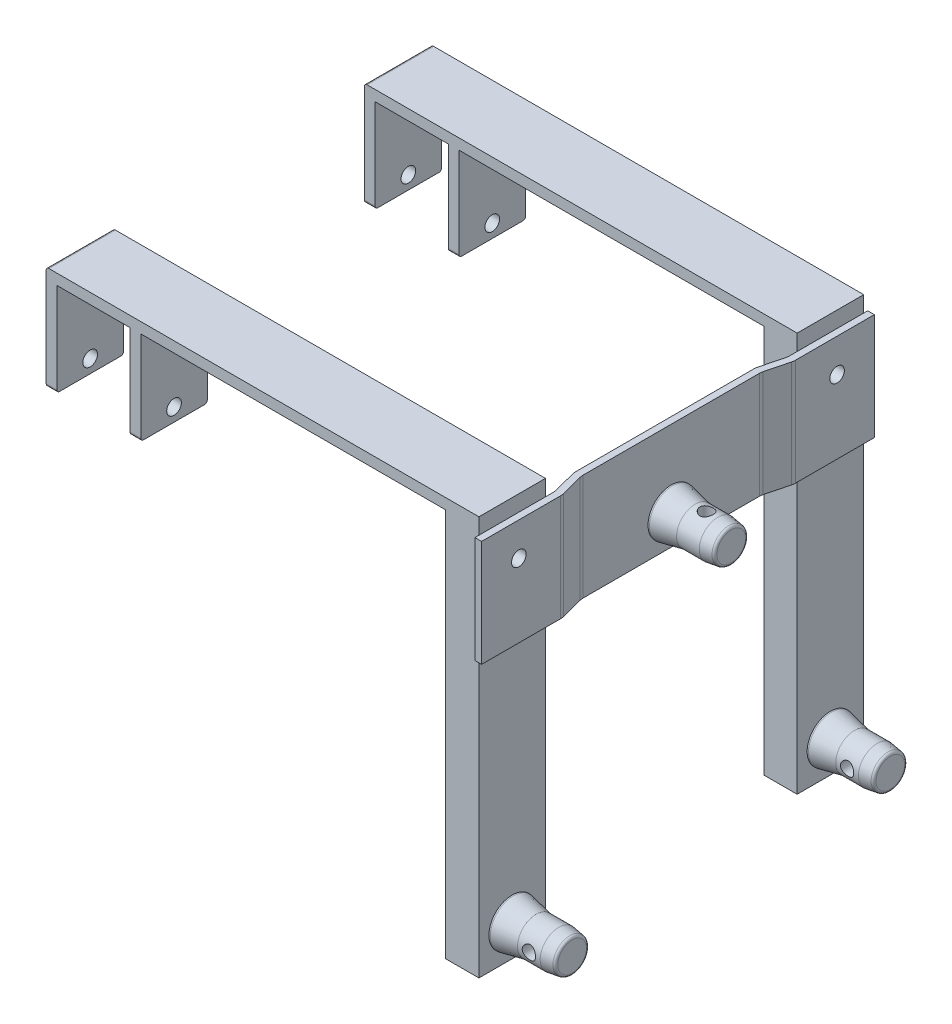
ISO-10303-21;
HEADER;
FILE_DESCRIPTION(('STEP AP214'),'2;1');
FILE_NAME('part.step','',(''),(''),'','','');
FILE_SCHEMA(('AUTOMOTIVE_DESIGN { 1 0 10303 214 1 1 1 1 }'));
ENDSEC;
DATA;
#1=APPLICATION_CONTEXT('core data for automotive mechanical design processes');
#2=APPLICATION_PROTOCOL_DEFINITION('international standard','automotive_design',2000,#1);
#3=PRODUCT_CONTEXT('',#1,'mechanical');
#4=PRODUCT('Part','Part','',(#3));
#5=PRODUCT_RELATED_PRODUCT_CATEGORY('part','',(#4));
#6=PRODUCT_DEFINITION_FORMATION('','',#4);
#7=PRODUCT_DEFINITION_CONTEXT('part definition',#1,'design');
#8=PRODUCT_DEFINITION('design','',#6,#7);
#9=PRODUCT_DEFINITION_SHAPE('','',#8);
#10=(LENGTH_UNIT() NAMED_UNIT(*) SI_UNIT(.MILLI.,.METRE.));
#11=(NAMED_UNIT(*) PLANE_ANGLE_UNIT() SI_UNIT($,.RADIAN.));
#12=(NAMED_UNIT(*) SI_UNIT($,.STERADIAN.) SOLID_ANGLE_UNIT());
#13=UNCERTAINTY_MEASURE_WITH_UNIT(LENGTH_MEASURE(1.E-05),#10,'distance_accuracy_value','');
#14=(GEOMETRIC_REPRESENTATION_CONTEXT(3) GLOBAL_UNCERTAINTY_ASSIGNED_CONTEXT((#13)) GLOBAL_UNIT_ASSIGNED_CONTEXT((#10,
#11,#12)) REPRESENTATION_CONTEXT('',''));
#15=CARTESIAN_POINT('',(0.,0.,0.));
#16=DIRECTION('',(0.,0.,1.));
#17=DIRECTION('',(1.,0.,0.));
#18=AXIS2_PLACEMENT_3D('',#15,#16,#17);
#19=CARTESIAN_POINT('',(325.,-14.,212.));
#20=DIRECTION('',(1.,0.,0.));
#21=DIRECTION('',(0.,0.,-1.));
#22=AXIS2_PLACEMENT_3D('',#19,#20,#21);
#23=PLANE('',#22);
#24=DIRECTION('',(0.,0.,-1.));
#25=VECTOR('',#24,1.);
#26=CARTESIAN_POINT('',(325.,-14.,212.));
#27=LINE('',#26,#25);
#28=CARTESIAN_POINT('',(325.,-14.,210.729833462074));
#29=VERTEX_POINT('',#28);
#30=CARTESIAN_POINT('',(325.,-14.,78.2701665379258));
#31=VERTEX_POINT('',#30);
#32=EDGE_CURVE('E648',#29,#31,#27,.T.);
#33=ORIENTED_EDGE('',*,*,#32,.T.);
#34=DIRECTION('',(0.,1.,0.));
#35=VECTOR('',#34,1.);
#36=CARTESIAN_POINT('',(325.,66.,78.2701665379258));
#37=LINE('',#36,#35);
#38=CARTESIAN_POINT('',(325.,66.,78.2701665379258));
#39=VERTEX_POINT('',#38);
#40=EDGE_CURVE('E914',#31,#39,#37,.T.);
#41=ORIENTED_EDGE('',*,*,#40,.T.);
#42=DIRECTION('',(0.,0.,-1.));
#43=VECTOR('',#42,1.);
#44=CARTESIAN_POINT('',(325.,66.,212.));
#45=LINE('',#44,#43);
#46=CARTESIAN_POINT('',(325.,66.,210.729833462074));
#47=VERTEX_POINT('',#46);
#48=EDGE_CURVE('E612',#47,#39,#45,.T.);
#49=ORIENTED_EDGE('',*,*,#48,.F.);
#50=DIRECTION('',(0.,1.,0.));
#51=VECTOR('',#50,1.);
#52=CARTESIAN_POINT('',(325.,-14.,210.729833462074));
#53=LINE('',#52,#51);
#54=EDGE_CURVE('E912',#47,#29,#53,.F.);
#55=ORIENTED_EDGE('',*,*,#54,.T.);
#56=EDGE_LOOP('',(#33,#41,#49,#55));
#57=FACE_BOUND('',#56,.T.);
#58=CARTESIAN_POINT('',(325.,9.00000000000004,144.5));
#59=DIRECTION('',(1.,0.,0.));
#60=DIRECTION('',(0.,0.,-1.));
#61=AXIS2_PLACEMENT_3D('',#58,#59,#60);
#62=CIRCLE('',#61,17.5);
#63=CARTESIAN_POINT('',(325.,9.00000000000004,127.));
#64=VERTEX_POINT('',#63);
#65=EDGE_CURVE('E1443',#64,#64,#62,.T.);
#66=ORIENTED_EDGE('',*,*,#65,.F.);
#67=EDGE_LOOP('',(#66));
#68=FACE_BOUND('',#67,.T.);
#69=ADVANCED_FACE('F31',(#57,#68),#23,.T.);
#70=CARTESIAN_POINT('',(325.,78.,50.));
#71=DIRECTION('',(-1.,0.,0.));
#72=DIRECTION('',(0.,0.,1.));
#73=AXIS2_PLACEMENT_3D('',#70,#71,#72);
#74=PLANE('',#73);
#75=DIRECTION('',(0.,1.,0.));
#76=VECTOR('',#75,1.);
#77=CARTESIAN_POINT('',(325.,78.,0.));
#78=LINE('',#77,#76);
#79=CARTESIAN_POINT('',(325.,-222.,0.));
#80=VERTEX_POINT('',#79);
#81=CARTESIAN_POINT('',(325.,-14.,0.));
#82=VERTEX_POINT('',#81);
#83=EDGE_CURVE('E495',#80,#82,#78,.T.);
#84=ORIENTED_EDGE('',*,*,#83,.T.);
#85=DIRECTION('',(0.,0.,1.));
#86=VECTOR('',#85,1.);
#87=CARTESIAN_POINT('',(325.,-14.,292.));
#88=LINE('',#87,#86);
#89=CARTESIAN_POINT('',(325.,-14.,50.));
#90=VERTEX_POINT('',#89);
#91=EDGE_CURVE('E597',#82,#90,#88,.T.);
#92=ORIENTED_EDGE('',*,*,#91,.T.);
#93=DIRECTION('',(0.,1.,0.));
#94=VECTOR('',#93,1.);
#95=CARTESIAN_POINT('',(325.,78.,50.));
#96=LINE('',#95,#94);
#97=CARTESIAN_POINT('',(325.,-222.,50.));
#98=VERTEX_POINT('',#97);
#99=EDGE_CURVE('E518',#98,#90,#96,.T.);
#100=ORIENTED_EDGE('',*,*,#99,.F.);
#101=DIRECTION('',(0.,0.,1.));
#102=VECTOR('',#101,1.);
#103=CARTESIAN_POINT('',(325.,-222.,50.));
#104=LINE('',#103,#102);
#105=EDGE_CURVE('E1525',#80,#98,#104,.T.);
#106=ORIENTED_EDGE('',*,*,#105,.F.);
#107=EDGE_LOOP('',(#84,#92,#100,#106));
#108=FACE_BOUND('',#107,.T.);
#109=CARTESIAN_POINT('',(325.,-198.,25.));
#110=DIRECTION('',(-1.,0.,0.));
#111=DIRECTION('',(0.,0.,1.));
#112=AXIS2_PLACEMENT_3D('',#109,#110,#111);
#113=CIRCLE('',#112,17.5);
#114=CARTESIAN_POINT('',(325.,-198.,42.5));
#115=VERTEX_POINT('',#114);
#116=EDGE_CURVE('E949',#115,#115,#113,.F.);
#117=ORIENTED_EDGE('',*,*,#116,.F.);
#118=EDGE_LOOP('',(#117));
#119=FACE_BOUND('',#118,.T.);
#120=ADVANCED_FACE('F1127',(#108,#119),#74,.F.);
#121=CARTESIAN_POINT('',(325.,78.,289.));
#122=DIRECTION('',(-1.,0.,0.));
#123=DIRECTION('',(0.,0.,1.));
#124=AXIS2_PLACEMENT_3D('',#121,#122,#123);
#125=PLANE('',#124);
#126=DIRECTION('',(0.,0.,1.));
#127=VECTOR('',#126,1.);
#128=CARTESIAN_POINT('',(325.,-14.,232.));
#129=LINE('',#128,#127);
#130=CARTESIAN_POINT('',(325.,-14.,239.));
#131=VERTEX_POINT('',#130);
#132=CARTESIAN_POINT('',(325.,-14.,289.));
#133=VERTEX_POINT('',#132);
#134=EDGE_CURVE('E641',#131,#133,#129,.T.);
#135=ORIENTED_EDGE('',*,*,#134,.T.);
#136=DIRECTION('',(0.,1.,0.));
#137=VECTOR('',#136,1.);
#138=CARTESIAN_POINT('',(325.,78.,289.));
#139=LINE('',#138,#137);
#140=CARTESIAN_POINT('',(325.,-222.,289.));
#141=VERTEX_POINT('',#140);
#142=EDGE_CURVE('E792',#141,#133,#139,.T.);
#143=ORIENTED_EDGE('',*,*,#142,.F.);
#144=DIRECTION('',(0.,0.,1.));
#145=VECTOR('',#144,1.);
#146=CARTESIAN_POINT('',(325.,-222.,289.));
#147=LINE('',#146,#145);
#148=CARTESIAN_POINT('',(325.,-222.,239.));
#149=VERTEX_POINT('',#148);
#150=EDGE_CURVE('E735',#149,#141,#147,.T.);
#151=ORIENTED_EDGE('',*,*,#150,.F.);
#152=DIRECTION('',(0.,1.,0.));
#153=VECTOR('',#152,1.);
#154=CARTESIAN_POINT('',(325.,78.,239.));
#155=LINE('',#154,#153);
#156=EDGE_CURVE('E770',#149,#131,#155,.T.);
#157=ORIENTED_EDGE('',*,*,#156,.T.);
#158=EDGE_LOOP('',(#135,#143,#151,#157));
#159=FACE_BOUND('',#158,.T.);
#160=CARTESIAN_POINT('',(325.,-198.,264.));
#161=DIRECTION('',(-1.,0.,0.));
#162=DIRECTION('',(0.,0.,1.));
#163=AXIS2_PLACEMENT_3D('',#160,#161,#162);
#164=CIRCLE('',#163,17.5);
#165=CARTESIAN_POINT('',(325.,-198.,281.5));
#166=VERTEX_POINT('',#165);
#167=EDGE_CURVE('E940',#166,#166,#164,.F.);
#168=ORIENTED_EDGE('',*,*,#167,.F.);
#169=EDGE_LOOP('',(#168));
#170=FACE_BOUND('',#169,.T.);
#171=ADVANCED_FACE('F1289',(#159,#170),#125,.F.);
#172=CARTESIAN_POINT('',(325.,-14.,-3.));
#173=DIRECTION('',(-1.,0.,0.));
#174=DIRECTION('',(0.,0.,1.));
#175=AXIS2_PLACEMENT_3D('',#172,#173,#174);
#176=PLANE('',#175);
#177=DIRECTION('',(0.,0.,1.));
#178=VECTOR('',#177,1.);
#179=CARTESIAN_POINT('',(325.,-14.,-3.));
#180=LINE('',#179,#178);
#181=CARTESIAN_POINT('',(325.,-14.,55.7298334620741));
#182=VERTEX_POINT('',#181);
#183=EDGE_CURVE('E659',#90,#182,#180,.T.);
#184=ORIENTED_EDGE('',*,*,#183,.T.);
#185=DIRECTION('',(0.,1.,0.));
#186=VECTOR('',#185,1.);
#187=CARTESIAN_POINT('',(325.,66.,55.7298334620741));
#188=LINE('',#187,#186);
#189=CARTESIAN_POINT('',(325.,66.,55.7298334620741));
#190=VERTEX_POINT('',#189);
#191=EDGE_CURVE('E870',#182,#190,#188,.T.);
#192=ORIENTED_EDGE('',*,*,#191,.T.);
#193=DIRECTION('',(0.,0.,1.));
#194=VECTOR('',#193,1.);
#195=CARTESIAN_POINT('',(325.,66.,-3.));
#196=LINE('',#195,#194);
#197=CARTESIAN_POINT('',(325.,66.,50.));
#198=VERTEX_POINT('',#197);
#199=EDGE_CURVE('E623',#198,#190,#196,.T.);
#200=ORIENTED_EDGE('',*,*,#199,.F.);
#201=EDGE_CURVE('E522',#90,#198,#96,.T.);
#202=ORIENTED_EDGE('',*,*,#201,.F.);
#203=EDGE_LOOP('',(#184,#192,#200,#202));
#204=FACE_BOUND('',#203,.T.);
#205=ADVANCED_FACE('F1181',(#204),#176,.T.);
#206=CARTESIAN_POINT('',(325.,70.,289.));
#207=DIRECTION('',(0.,1.,0.));
#208=DIRECTION('',(-1.,0.,0.));
#209=AXIS2_PLACEMENT_3D('',#206,#207,#208);
#210=PLANE('',#209);
#211=DIRECTION('',(0.,0.,-1.));
#212=VECTOR('',#211,1.);
#213=CARTESIAN_POINT('',(300.,70.,284.));
#214=LINE('',#213,#212);
#215=CARTESIAN_POINT('',(300.,70.,289.));
#216=VERTEX_POINT('',#215);
#217=CARTESIAN_POINT('',(300.,70.,284.));
#218=VERTEX_POINT('',#217);
#219=EDGE_CURVE('E706',#216,#218,#214,.T.);
#220=ORIENTED_EDGE('',*,*,#219,.F.);
#221=DIRECTION('',(1.,0.,0.));
#222=VECTOR('',#221,1.);
#223=CARTESIAN_POINT('',(325.,70.,289.));
#224=LINE('',#223,#222);
#225=CARTESIAN_POINT('',(71.,70.,289.));
#226=VERTEX_POINT('',#225);
#227=EDGE_CURVE('E788',#226,#216,#224,.T.);
#228=ORIENTED_EDGE('',*,*,#227,.F.);
#229=DIRECTION('',(0.,0.,-1.));
#230=VECTOR('',#229,1.);
#231=CARTESIAN_POINT('',(71.,70.,289.));
#232=LINE('',#231,#230);
#233=CARTESIAN_POINT('',(71.,70.,239.));
#234=VERTEX_POINT('',#233);
#235=EDGE_CURVE('E807',#226,#234,#232,.T.);
#236=ORIENTED_EDGE('',*,*,#235,.T.);
#237=DIRECTION('',(1.,0.,0.));
#238=VECTOR('',#237,1.);
#239=CARTESIAN_POINT('',(325.,70.,239.));
#240=LINE('',#239,#238);
#241=CARTESIAN_POINT('',(300.,70.,239.));
#242=VERTEX_POINT('',#241);
#243=EDGE_CURVE('E767',#234,#242,#240,.T.);
#244=ORIENTED_EDGE('',*,*,#243,.T.);
#245=DIRECTION('',(0.,0.,-1.));
#246=VECTOR('',#245,1.);
#247=CARTESIAN_POINT('',(300.,70.,239.));
#248=LINE('',#247,#246);
#249=CARTESIAN_POINT('',(300.,70.,244.));
#250=VERTEX_POINT('',#249);
#251=EDGE_CURVE('E718',#250,#242,#248,.T.);
#252=ORIENTED_EDGE('',*,*,#251,.F.);
#253=DIRECTION('',(-1.,0.,0.));
#254=VECTOR('',#253,1.);
#255=CARTESIAN_POINT('',(300.,70.,244.));
#256=LINE('',#255,#254);
#257=CARTESIAN_POINT('',(320.,70.,244.));
#258=VERTEX_POINT('',#257);
#259=EDGE_CURVE('E715',#258,#250,#256,.T.);
#260=ORIENTED_EDGE('',*,*,#259,.F.);
#261=DIRECTION('',(0.,0.,-1.));
#262=VECTOR('',#261,1.);
#263=CARTESIAN_POINT('',(320.,70.,244.));
#264=LINE('',#263,#262);
#265=CARTESIAN_POINT('',(320.,70.,284.));
#266=VERTEX_POINT('',#265);
#267=EDGE_CURVE('E712',#266,#258,#264,.T.);
#268=ORIENTED_EDGE('',*,*,#267,.F.);
#269=DIRECTION('',(1.,0.,0.));
#270=VECTOR('',#269,1.);
#271=CARTESIAN_POINT('',(320.,70.,284.));
#272=LINE('',#271,#270);
#273=EDGE_CURVE('E709',#218,#266,#272,.T.);
#274=ORIENTED_EDGE('',*,*,#273,.F.);
#275=EDGE_LOOP('',(#220,#228,#236,#244,#252,#260,#268,#274));
#276=FACE_BOUND('',#275,.T.);
#277=ADVANCED_FACE('F1290',(#276),#210,.F.);
#278=CARTESIAN_POINT('',(8.,0.,289.));
#279=DIRECTION('',(0.,1.,0.));
#280=DIRECTION('',(-1.,0.,0.));
#281=AXIS2_PLACEMENT_3D('',#278,#279,#280);
#282=PLANE('',#281);
#283=DIRECTION('',(0.,0.,-1.));
#284=VECTOR('',#283,1.);
#285=CARTESIAN_POINT('',(0.,0.,289.));
#286=LINE('',#285,#284);
#287=CARTESIAN_POINT('',(0.,0.,287.));
#288=VERTEX_POINT('',#287);
#289=CARTESIAN_POINT('',(0.,0.,241.));
#290=VERTEX_POINT('',#289);
#291=EDGE_CURVE('E801',#288,#290,#286,.T.);
#292=ORIENTED_EDGE('',*,*,#291,.T.);
#293=DIRECTION('',(1.,0.,0.));
#294=VECTOR('',#293,1.);
#295=CARTESIAN_POINT('',(8.,0.,241.));
#296=LINE('',#295,#294);
#297=CARTESIAN_POINT('',(8.,0.,241.));
#298=VERTEX_POINT('',#297);
#299=EDGE_CURVE('E827',#290,#298,#296,.T.);
#300=ORIENTED_EDGE('',*,*,#299,.T.);
#301=DIRECTION('',(0.,0.,-1.));
#302=VECTOR('',#301,1.);
#303=CARTESIAN_POINT('',(8.,0.,289.));
#304=LINE('',#303,#302);
#305=CARTESIAN_POINT('',(8.,0.,287.));
#306=VERTEX_POINT('',#305);
#307=EDGE_CURVE('E822',#306,#298,#304,.T.);
#308=ORIENTED_EDGE('',*,*,#307,.F.);
#309=DIRECTION('',(1.,0.,0.));
#310=VECTOR('',#309,1.);
#311=CARTESIAN_POINT('',(8.,0.,287.));
#312=LINE('',#311,#310);
#313=EDGE_CURVE('E825',#306,#288,#312,.F.);
#314=ORIENTED_EDGE('',*,*,#313,.T.);
#315=EDGE_LOOP('',(#292,#300,#308,#314));
#316=FACE_BOUND('',#315,.T.);
#317=ADVANCED_FACE('F33',(#316),#282,.F.);
#318=CARTESIAN_POINT('',(8.,70.,289.));
#319=DIRECTION('',(-1.,0.,0.));
#320=DIRECTION('',(0.,-1.,0.));
#321=AXIS2_PLACEMENT_3D('',#318,#319,#320);
#322=PLANE('',#321);
#323=CARTESIAN_POINT('',(8.,9.99999999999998,264.));
#324=DIRECTION('',(-1.,0.,0.));
#325=DIRECTION('',(0.,-1.,0.));
#326=AXIS2_PLACEMENT_3D('',#323,#324,#325);
#327=CIRCLE('',#326,5.5);
#328=CARTESIAN_POINT('',(8.,4.49999999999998,264.));
#329=VERTEX_POINT('',#328);
#330=EDGE_CURVE('E697',#329,#329,#327,.T.);
#331=ORIENTED_EDGE('',*,*,#330,.T.);
#332=EDGE_LOOP('',(#331));
#333=FACE_BOUND('',#332,.T.);
#334=ORIENTED_EDGE('',*,*,#307,.T.);
#335=CARTESIAN_POINT('',(8.,2.,241.));
#336=DIRECTION('',(-1.,0.,0.));
#337=DIRECTION('',(0.,-1.,0.));
#338=AXIS2_PLACEMENT_3D('',#335,#336,#337);
#339=CIRCLE('',#338,2.);
#340=CARTESIAN_POINT('',(8.,2.,239.));
#341=VERTEX_POINT('',#340);
#342=EDGE_CURVE('E832',#298,#341,#339,.F.);
#343=ORIENTED_EDGE('',*,*,#342,.T.);
#344=DIRECTION('',(0.,1.,0.));
#345=VECTOR('',#344,1.);
#346=CARTESIAN_POINT('',(8.,70.,239.));
#347=LINE('',#346,#345);
#348=CARTESIAN_POINT('',(8.,70.,239.));
#349=VERTEX_POINT('',#348);
#350=EDGE_CURVE('E758',#341,#349,#347,.T.);
#351=ORIENTED_EDGE('',*,*,#350,.T.);
#352=DIRECTION('',(0.,0.,-1.));
#353=VECTOR('',#352,1.);
#354=CARTESIAN_POINT('',(8.,70.,289.));
#355=LINE('',#354,#353);
#356=CARTESIAN_POINT('',(8.,70.,289.));
#357=VERTEX_POINT('',#356);
#358=EDGE_CURVE('E819',#357,#349,#355,.T.);
#359=ORIENTED_EDGE('',*,*,#358,.F.);
#360=DIRECTION('',(0.,1.,0.));
#361=VECTOR('',#360,1.);
#362=CARTESIAN_POINT('',(8.,70.,289.));
#363=LINE('',#362,#361);
#364=CARTESIAN_POINT('',(8.,2.,289.));
#365=VERTEX_POINT('',#364);
#366=EDGE_CURVE('E779',#365,#357,#363,.T.);
#367=ORIENTED_EDGE('',*,*,#366,.F.);
#368=CARTESIAN_POINT('',(8.,2.,287.));
#369=DIRECTION('',(-1.,0.,0.));
#370=DIRECTION('',(0.,-1.,0.));
#371=AXIS2_PLACEMENT_3D('',#368,#369,#370);
#372=CIRCLE('',#371,2.);
#373=EDGE_CURVE('E830',#365,#306,#372,.F.);
#374=ORIENTED_EDGE('',*,*,#373,.T.);
#375=EDGE_LOOP('',(#334,#343,#351,#359,#367,#374));
#376=FACE_BOUND('',#375,.T.);
#377=ADVANCED_FACE('F1307',(#333,#376),#322,.F.);
#378=CARTESIAN_POINT('',(63.,70.,289.));
#379=DIRECTION('',(0.,1.,0.));
#380=DIRECTION('',(-1.,0.,0.));
#381=AXIS2_PLACEMENT_3D('',#378,#379,#380);
#382=PLANE('',#381);
#383=DIRECTION('',(1.,0.,0.));
#384=VECTOR('',#383,1.);
#385=CARTESIAN_POINT('',(63.,70.,239.));
#386=LINE('',#385,#384);
#387=CARTESIAN_POINT('',(63.,70.,239.));
#388=VERTEX_POINT('',#387);
#389=EDGE_CURVE('E760',#349,#388,#386,.T.);
#390=ORIENTED_EDGE('',*,*,#389,.T.);
#391=DIRECTION('',(0.,0.,-1.));
#392=VECTOR('',#391,1.);
#393=CARTESIAN_POINT('',(63.,70.,289.));
#394=LINE('',#393,#392);
#395=CARTESIAN_POINT('',(63.,70.,289.));
#396=VERTEX_POINT('',#395);
#397=EDGE_CURVE('E816',#396,#388,#394,.T.);
#398=ORIENTED_EDGE('',*,*,#397,.F.);
#399=DIRECTION('',(1.,0.,0.));
#400=VECTOR('',#399,1.);
#401=CARTESIAN_POINT('',(63.,70.,289.));
#402=LINE('',#401,#400);
#403=EDGE_CURVE('E781',#357,#396,#402,.T.);
#404=ORIENTED_EDGE('',*,*,#403,.F.);
#405=ORIENTED_EDGE('',*,*,#358,.T.);
#406=EDGE_LOOP('',(#390,#398,#404,#405));
#407=FACE_BOUND('',#406,.T.);
#408=ADVANCED_FACE('F1304',(#407),#382,.F.);
#409=CARTESIAN_POINT('',(63.,0.,289.));
#410=DIRECTION('',(1.,0.,0.));
#411=DIRECTION('',(0.,0.,-1.));
#412=AXIS2_PLACEMENT_3D('',#409,#410,#411);
#413=PLANE('',#412);
#414=CARTESIAN_POINT('',(63.,9.99999999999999,264.));
#415=DIRECTION('',(1.,0.,0.));
#416=DIRECTION('',(0.,0.,-1.));
#417=AXIS2_PLACEMENT_3D('',#414,#415,#416);
#418=CIRCLE('',#417,5.5);
#419=CARTESIAN_POINT('',(63.,9.99999999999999,258.5));
#420=VERTEX_POINT('',#419);
#421=EDGE_CURVE('E694',#420,#420,#418,.T.);
#422=ORIENTED_EDGE('',*,*,#421,.T.);
#423=EDGE_LOOP('',(#422));
#424=FACE_BOUND('',#423,.T.);
#425=DIRECTION('',(0.,-1.,0.));
#426=VECTOR('',#425,1.);
#427=CARTESIAN_POINT('',(63.,0.,239.));
#428=LINE('',#427,#426);
#429=CARTESIAN_POINT('',(63.,2.00000000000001,239.));
#430=VERTEX_POINT('',#429);
#431=EDGE_CURVE('E762',#388,#430,#428,.T.);
#432=ORIENTED_EDGE('',*,*,#431,.T.);
#433=CARTESIAN_POINT('',(63.,2.00000000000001,241.));
#434=DIRECTION('',(1.,0.,0.));
#435=DIRECTION('',(0.,0.,-1.));
#436=AXIS2_PLACEMENT_3D('',#433,#434,#435);
#437=CIRCLE('',#436,2.);
#438=CARTESIAN_POINT('',(63.,0.,241.));
#439=VERTEX_POINT('',#438);
#440=EDGE_CURVE('E858',#430,#439,#437,.F.);
#441=ORIENTED_EDGE('',*,*,#440,.T.);
#442=DIRECTION('',(0.,0.,-1.));
#443=VECTOR('',#442,1.);
#444=CARTESIAN_POINT('',(63.,0.,289.));
#445=LINE('',#444,#443);
#446=CARTESIAN_POINT('',(63.,0.,287.));
#447=VERTEX_POINT('',#446);
#448=EDGE_CURVE('E813',#447,#439,#445,.T.);
#449=ORIENTED_EDGE('',*,*,#448,.F.);
#450=CARTESIAN_POINT('',(63.,2.00000000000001,287.));
#451=DIRECTION('',(1.,0.,0.));
#452=DIRECTION('',(0.,0.,-1.));
#453=AXIS2_PLACEMENT_3D('',#450,#451,#452);
#454=CIRCLE('',#453,2.);
#455=CARTESIAN_POINT('',(63.,2.00000000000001,289.));
#456=VERTEX_POINT('',#455);
#457=EDGE_CURVE('E856',#447,#456,#454,.F.);
#458=ORIENTED_EDGE('',*,*,#457,.T.);
#459=DIRECTION('',(0.,-1.,0.));
#460=VECTOR('',#459,1.);
#461=CARTESIAN_POINT('',(63.,0.,289.));
#462=LINE('',#461,#460);
#463=EDGE_CURVE('E783',#396,#456,#462,.T.);
#464=ORIENTED_EDGE('',*,*,#463,.F.);
#465=ORIENTED_EDGE('',*,*,#397,.T.);
#466=EDGE_LOOP('',(#432,#441,#449,#458,#464,#465));
#467=FACE_BOUND('',#466,.T.);
#468=ADVANCED_FACE('F1300',(#424,#467),#413,.F.);
#469=CARTESIAN_POINT('',(71.,0.,289.));
#470=DIRECTION('',(0.,1.,0.));
#471=DIRECTION('',(0.,0.,1.));
#472=AXIS2_PLACEMENT_3D('',#469,#470,#471);
#473=PLANE('',#472);
#474=ORIENTED_EDGE('',*,*,#448,.T.);
#475=DIRECTION('',(1.,0.,0.));
#476=VECTOR('',#475,1.);
#477=CARTESIAN_POINT('',(71.,0.,241.));
#478=LINE('',#477,#476);
#479=CARTESIAN_POINT('',(71.,0.,241.));
#480=VERTEX_POINT('',#479);
#481=EDGE_CURVE('E849',#439,#480,#478,.T.);
#482=ORIENTED_EDGE('',*,*,#481,.T.);
#483=DIRECTION('',(0.,0.,-1.));
#484=VECTOR('',#483,1.);
#485=CARTESIAN_POINT('',(71.,0.,289.));
#486=LINE('',#485,#484);
#487=CARTESIAN_POINT('',(71.,0.,287.));
#488=VERTEX_POINT('',#487);
#489=EDGE_CURVE('E810',#488,#480,#486,.T.);
#490=ORIENTED_EDGE('',*,*,#489,.F.);
#491=DIRECTION('',(1.,0.,0.));
#492=VECTOR('',#491,1.);
#493=CARTESIAN_POINT('',(71.,0.,287.));
#494=LINE('',#493,#492);
#495=EDGE_CURVE('E847',#488,#447,#494,.F.);
#496=ORIENTED_EDGE('',*,*,#495,.T.);
#497=EDGE_LOOP('',(#474,#482,#490,#496));
#498=FACE_BOUND('',#497,.T.);
#499=ADVANCED_FACE('F1296',(#498),#473,.F.);
#500=CARTESIAN_POINT('',(71.,70.,289.));
#501=DIRECTION('',(-1.,0.,0.));
#502=DIRECTION('',(0.,-1.,0.));
#503=AXIS2_PLACEMENT_3D('',#500,#501,#502);
#504=PLANE('',#503);
#505=CARTESIAN_POINT('',(71.,9.99999999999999,264.));
#506=DIRECTION('',(1.,0.,0.));
#507=DIRECTION('',(0.,1.,0.));
#508=AXIS2_PLACEMENT_3D('',#505,#506,#507);
#509=CIRCLE('',#508,5.5);
#510=CARTESIAN_POINT('',(71.,15.5,264.));
#511=VERTEX_POINT('',#510);
#512=EDGE_CURVE('E688',#511,#511,#509,.T.);
#513=ORIENTED_EDGE('',*,*,#512,.F.);
#514=EDGE_LOOP('',(#513));
#515=FACE_BOUND('',#514,.T.);
#516=ORIENTED_EDGE('',*,*,#489,.T.);
#517=CARTESIAN_POINT('',(71.,2.00000000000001,241.));
#518=DIRECTION('',(-1.,0.,0.));
#519=DIRECTION('',(0.,-1.,0.));
#520=AXIS2_PLACEMENT_3D('',#517,#518,#519);
#521=CIRCLE('',#520,2.);
#522=CARTESIAN_POINT('',(71.,2.,239.));
#523=VERTEX_POINT('',#522);
#524=EDGE_CURVE('E854',#480,#523,#521,.F.);
#525=ORIENTED_EDGE('',*,*,#524,.T.);
#526=DIRECTION('',(0.,1.,0.));
#527=VECTOR('',#526,1.);
#528=CARTESIAN_POINT('',(71.,70.,239.));
#529=LINE('',#528,#527);
#530=EDGE_CURVE('E765',#523,#234,#529,.T.);
#531=ORIENTED_EDGE('',*,*,#530,.T.);
#532=ORIENTED_EDGE('',*,*,#235,.F.);
#533=DIRECTION('',(0.,1.,0.));
#534=VECTOR('',#533,1.);
#535=CARTESIAN_POINT('',(71.,70.,289.));
#536=LINE('',#535,#534);
#537=CARTESIAN_POINT('',(71.,2.,289.));
#538=VERTEX_POINT('',#537);
#539=EDGE_CURVE('E786',#538,#226,#536,.T.);
#540=ORIENTED_EDGE('',*,*,#539,.F.);
#541=CARTESIAN_POINT('',(71.,2.00000000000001,287.));
#542=DIRECTION('',(-1.,0.,0.));
#543=DIRECTION('',(0.,-1.,0.));
#544=AXIS2_PLACEMENT_3D('',#541,#542,#543);
#545=CIRCLE('',#544,2.);
#546=EDGE_CURVE('E852',#538,#488,#545,.F.);
#547=ORIENTED_EDGE('',*,*,#546,.T.);
#548=EDGE_LOOP('',(#516,#525,#531,#532,#540,#547));
#549=FACE_BOUND('',#548,.T.);
#550=ADVANCED_FACE('F1287',(#515,#549),#504,.F.);
#551=CARTESIAN_POINT('',(325.,66.,289.));
#552=VERTEX_POINT('',#551);
#553=CARTESIAN_POINT('',(325.,78.,289.));
#554=VERTEX_POINT('',#553);
#555=EDGE_CURVE('E791',#552,#554,#139,.T.);
#556=ORIENTED_EDGE('',*,*,#555,.F.);
#557=DIRECTION('',(0.,0.,1.));
#558=VECTOR('',#557,1.);
#559=CARTESIAN_POINT('',(325.,66.,232.));
#560=LINE('',#559,#558);
#561=CARTESIAN_POINT('',(325.,66.,239.));
#562=VERTEX_POINT('',#561);
#563=EDGE_CURVE('E603',#562,#552,#560,.T.);
#564=ORIENTED_EDGE('',*,*,#563,.F.);
#565=CARTESIAN_POINT('',(325.,78.,239.));
#566=VERTEX_POINT('',#565);
#567=EDGE_CURVE('E769',#562,#566,#155,.T.);
#568=ORIENTED_EDGE('',*,*,#567,.T.);
#569=DIRECTION('',(0.,0.,-1.));
#570=VECTOR('',#569,1.);
#571=CARTESIAN_POINT('',(325.,78.,289.));
#572=LINE('',#571,#570);
#573=EDGE_CURVE('E804',#554,#566,#572,.T.);
#574=ORIENTED_EDGE('',*,*,#573,.F.);
#575=EDGE_LOOP('',(#556,#564,#568,#574));
#576=FACE_BOUND('',#575,.T.);
#577=ADVANCED_FACE('F1283',(#576),#125,.F.);
#578=CARTESIAN_POINT('',(0.,78.,289.));
#579=DIRECTION('',(0.,-1.,0.));
#580=DIRECTION('',(0.,0.,-1.));
#581=AXIS2_PLACEMENT_3D('',#578,#579,#580);
#582=PLANE('',#581);
#583=DIRECTION('',(-1.,0.,0.));
#584=VECTOR('',#583,1.);
#585=CARTESIAN_POINT('',(0.,78.,239.));
#586=LINE('',#585,#584);
#587=CARTESIAN_POINT('',(2.,78.,239.));
#588=VERTEX_POINT('',#587);
#589=EDGE_CURVE('E773',#566,#588,#586,.T.);
#590=ORIENTED_EDGE('',*,*,#589,.T.);
#591=DIRECTION('',(0.,0.,-1.));
#592=VECTOR('',#591,1.);
#593=CARTESIAN_POINT('',(2.,78.,289.));
#594=LINE('',#593,#592);
#595=CARTESIAN_POINT('',(2.,78.,289.));
#596=VERTEX_POINT('',#595);
#597=EDGE_CURVE('E868',#588,#596,#594,.F.);
#598=ORIENTED_EDGE('',*,*,#597,.T.);
#599=DIRECTION('',(-1.,0.,0.));
#600=VECTOR('',#599,1.);
#601=CARTESIAN_POINT('',(0.,78.,289.));
#602=LINE('',#601,#600);
#603=EDGE_CURVE('E795',#554,#596,#602,.T.);
#604=ORIENTED_EDGE('',*,*,#603,.F.);
#605=ORIENTED_EDGE('',*,*,#573,.T.);
#606=EDGE_LOOP('',(#590,#598,#604,#605));
#607=FACE_BOUND('',#606,.T.);
#608=ADVANCED_FACE('F1279',(#607),#582,.F.);
#609=CARTESIAN_POINT('',(0.,0.,289.));
#610=DIRECTION('',(1.,0.,0.));
#611=DIRECTION('',(0.,0.,-1.));
#612=AXIS2_PLACEMENT_3D('',#609,#610,#611);
#613=PLANE('',#612);
#614=CARTESIAN_POINT('',(0.,9.99999999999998,264.));
#615=DIRECTION('',(1.,0.,0.));
#616=DIRECTION('',(0.,1.,0.));
#617=AXIS2_PLACEMENT_3D('',#614,#615,#616);
#618=CIRCLE('',#617,5.5);
#619=CARTESIAN_POINT('',(0.,15.5,264.));
#620=VERTEX_POINT('',#619);
#621=EDGE_CURVE('E691',#620,#620,#618,.T.);
#622=ORIENTED_EDGE('',*,*,#621,.T.);
#623=EDGE_LOOP('',(#622));
#624=FACE_BOUND('',#623,.T.);
#625=DIRECTION('',(0.,-1.,0.));
#626=VECTOR('',#625,1.);
#627=CARTESIAN_POINT('',(0.,0.,239.));
#628=LINE('',#627,#626);
#629=CARTESIAN_POINT('',(0.,76.,239.));
#630=VERTEX_POINT('',#629);
#631=CARTESIAN_POINT('',(0.,2.,239.));
#632=VERTEX_POINT('',#631);
#633=EDGE_CURVE('E776',#630,#632,#628,.T.);
#634=ORIENTED_EDGE('',*,*,#633,.T.);
#635=CARTESIAN_POINT('',(0.,2.,241.));
#636=DIRECTION('',(1.,0.,0.));
#637=DIRECTION('',(0.,0.,-1.));
#638=AXIS2_PLACEMENT_3D('',#635,#636,#637);
#639=CIRCLE('',#638,2.);
#640=EDGE_CURVE('E845',#632,#290,#639,.F.);
#641=ORIENTED_EDGE('',*,*,#640,.T.);
#642=ORIENTED_EDGE('',*,*,#291,.F.);
#643=CARTESIAN_POINT('',(0.,2.,287.));
#644=DIRECTION('',(1.,0.,0.));
#645=DIRECTION('',(0.,0.,-1.));
#646=AXIS2_PLACEMENT_3D('',#643,#644,#645);
#647=CIRCLE('',#646,2.);
#648=CARTESIAN_POINT('',(0.,2.,289.));
#649=VERTEX_POINT('',#648);
#650=EDGE_CURVE('E843',#288,#649,#647,.F.);
#651=ORIENTED_EDGE('',*,*,#650,.T.);
#652=DIRECTION('',(0.,-1.,0.));
#653=VECTOR('',#652,1.);
#654=CARTESIAN_POINT('',(0.,0.,289.));
#655=LINE('',#654,#653);
#656=CARTESIAN_POINT('',(0.,76.,289.));
#657=VERTEX_POINT('',#656);
#658=EDGE_CURVE('E798',#657,#649,#655,.T.);
#659=ORIENTED_EDGE('',*,*,#658,.F.);
#660=DIRECTION('',(0.,0.,-1.));
#661=VECTOR('',#660,1.);
#662=CARTESIAN_POINT('',(0.,76.,289.));
#663=LINE('',#662,#661);
#664=EDGE_CURVE('E840',#657,#630,#663,.T.);
#665=ORIENTED_EDGE('',*,*,#664,.T.);
#666=EDGE_LOOP('',(#634,#641,#642,#651,#659,#665));
#667=FACE_BOUND('',#666,.T.);
#668=ADVANCED_FACE('F1275',(#624,#667),#613,.F.);
#669=CARTESIAN_POINT('',(0.,0.,289.));
#670=DIRECTION('',(0.,0.,-1.));
#671=DIRECTION('',(-1.,0.,0.));
#672=AXIS2_PLACEMENT_3D('',#669,#670,#671);
#673=PLANE('',#672);
#674=ORIENTED_EDGE('',*,*,#463,.T.);
#675=DIRECTION('',(1.,0.,0.));
#676=VECTOR('',#675,1.);
#677=CARTESIAN_POINT('',(0.,2.00000000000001,289.));
#678=LINE('',#677,#676);
#679=EDGE_CURVE('E865',#456,#538,#678,.T.);
#680=ORIENTED_EDGE('',*,*,#679,.T.);
#681=ORIENTED_EDGE('',*,*,#539,.T.);
#682=ORIENTED_EDGE('',*,*,#227,.T.);
#683=DIRECTION('',(0.,1.,0.));
#684=VECTOR('',#683,1.);
#685=CARTESIAN_POINT('',(300.,-222.,289.));
#686=LINE('',#685,#684);
#687=CARTESIAN_POINT('',(300.,-222.,289.));
#688=VERTEX_POINT('',#687);
#689=EDGE_CURVE('E740',#688,#216,#686,.T.);
#690=ORIENTED_EDGE('',*,*,#689,.F.);
#691=DIRECTION('',(-1.,0.,0.));
#692=VECTOR('',#691,1.);
#693=CARTESIAN_POINT('',(300.,-222.,289.));
#694=LINE('',#693,#692);
#695=EDGE_CURVE('E738',#141,#688,#694,.T.);
#696=ORIENTED_EDGE('',*,*,#695,.F.);
#697=ORIENTED_EDGE('',*,*,#142,.T.);
#698=DIRECTION('',(0.,1.,0.));
#699=VECTOR('',#698,1.);
#700=CARTESIAN_POINT('',(325.,0.,289.));
#701=LINE('',#700,#699);
#702=EDGE_CURVE('E685',#133,#552,#701,.T.);
#703=ORIENTED_EDGE('',*,*,#702,.T.);
#704=ORIENTED_EDGE('',*,*,#555,.T.);
#705=ORIENTED_EDGE('',*,*,#603,.T.);
#706=CARTESIAN_POINT('',(2.,76.,289.));
#707=DIRECTION('',(0.,0.,-1.));
#708=DIRECTION('',(-1.,0.,0.));
#709=AXIS2_PLACEMENT_3D('',#706,#707,#708);
#710=CIRCLE('',#709,2.);
#711=EDGE_CURVE('E860',#596,#657,#710,.F.);
#712=ORIENTED_EDGE('',*,*,#711,.T.);
#713=ORIENTED_EDGE('',*,*,#658,.T.);
#714=DIRECTION('',(1.,0.,0.));
#715=VECTOR('',#714,1.);
#716=CARTESIAN_POINT('',(0.,2.,289.));
#717=LINE('',#716,#715);
#718=EDGE_CURVE('E862',#649,#365,#717,.T.);
#719=ORIENTED_EDGE('',*,*,#718,.T.);
#720=ORIENTED_EDGE('',*,*,#366,.T.);
#721=ORIENTED_EDGE('',*,*,#403,.T.);
#722=EDGE_LOOP('',(#674,#680,#681,#682,#690,#696,#697,#703,#704,#705,#712,#713,#719,#720,#721));
#723=FACE_BOUND('',#722,.T.);
#724=ADVANCED_FACE('F1271',(#723),#673,.F.);
#725=CARTESIAN_POINT('',(0.,0.,239.));
#726=DIRECTION('',(0.,0.,-1.));
#727=DIRECTION('',(-1.,0.,0.));
#728=AXIS2_PLACEMENT_3D('',#725,#726,#727);
#729=PLANE('',#728);
#730=ORIENTED_EDGE('',*,*,#350,.F.);
#731=DIRECTION('',(1.,0.,0.));
#732=VECTOR('',#731,1.);
#733=CARTESIAN_POINT('',(0.,2.,239.));
#734=LINE('',#733,#732);
#735=EDGE_CURVE('E838',#341,#632,#734,.F.);
#736=ORIENTED_EDGE('',*,*,#735,.T.);
#737=ORIENTED_EDGE('',*,*,#633,.F.);
#738=CARTESIAN_POINT('',(2.,76.,239.));
#739=DIRECTION('',(0.,0.,-1.));
#740=DIRECTION('',(-1.,0.,0.));
#741=AXIS2_PLACEMENT_3D('',#738,#739,#740);
#742=CIRCLE('',#741,2.);
#743=EDGE_CURVE('E834',#630,#588,#742,.T.);
#744=ORIENTED_EDGE('',*,*,#743,.T.);
#745=ORIENTED_EDGE('',*,*,#589,.F.);
#746=ORIENTED_EDGE('',*,*,#567,.F.);
#747=DIRECTION('',(0.,1.,0.));
#748=VECTOR('',#747,1.);
#749=CARTESIAN_POINT('',(325.,0.,239.));
#750=LINE('',#749,#748);
#751=EDGE_CURVE('E675',#131,#562,#750,.T.);
#752=ORIENTED_EDGE('',*,*,#751,.F.);
#753=ORIENTED_EDGE('',*,*,#156,.F.);
#754=DIRECTION('',(1.,0.,0.));
#755=VECTOR('',#754,1.);
#756=CARTESIAN_POINT('',(325.,-222.,239.));
#757=LINE('',#756,#755);
#758=CARTESIAN_POINT('',(300.,-222.,239.));
#759=VERTEX_POINT('',#758);
#760=EDGE_CURVE('E732',#759,#149,#757,.T.);
#761=ORIENTED_EDGE('',*,*,#760,.F.);
#762=DIRECTION('',(0.,1.,0.));
#763=VECTOR('',#762,1.);
#764=CARTESIAN_POINT('',(300.,-222.,239.));
#765=LINE('',#764,#763);
#766=EDGE_CURVE('E743',#759,#242,#765,.T.);
#767=ORIENTED_EDGE('',*,*,#766,.T.);
#768=ORIENTED_EDGE('',*,*,#243,.F.);
#769=ORIENTED_EDGE('',*,*,#530,.F.);
#770=DIRECTION('',(1.,0.,0.));
#771=VECTOR('',#770,1.);
#772=CARTESIAN_POINT('',(63.,2.00000000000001,239.));
#773=LINE('',#772,#771);
#774=EDGE_CURVE('E836',#523,#430,#773,.F.);
#775=ORIENTED_EDGE('',*,*,#774,.T.);
#776=ORIENTED_EDGE('',*,*,#431,.F.);
#777=ORIENTED_EDGE('',*,*,#389,.F.);
#778=EDGE_LOOP('',(#730,#736,#737,#744,#745,#746,#752,#753,#761,#767,#768,#769,#775,#776,#777));
#779=FACE_BOUND('',#778,.T.);
#780=ADVANCED_FACE('F1267',(#779),#729,.T.);
#781=CARTESIAN_POINT('',(300.,-222.,284.));
#782=DIRECTION('',(1.,0.,0.));
#783=DIRECTION('',(0.,1.,0.));
#784=AXIS2_PLACEMENT_3D('',#781,#782,#783);
#785=PLANE('',#784);
#786=ORIENTED_EDGE('',*,*,#219,.T.);
#787=DIRECTION('',(0.,1.,0.));
#788=VECTOR('',#787,1.);
#789=CARTESIAN_POINT('',(300.,-222.,284.));
#790=LINE('',#789,#788);
#791=CARTESIAN_POINT('',(300.,-222.,284.));
#792=VERTEX_POINT('',#791);
#793=EDGE_CURVE('E755',#792,#218,#790,.T.);
#794=ORIENTED_EDGE('',*,*,#793,.F.);
#795=DIRECTION('',(0.,0.,-1.));
#796=VECTOR('',#795,1.);
#797=CARTESIAN_POINT('',(300.,-222.,284.));
#798=LINE('',#797,#796);
#799=EDGE_CURVE('E721',#688,#792,#798,.T.);
#800=ORIENTED_EDGE('',*,*,#799,.F.);
#801=ORIENTED_EDGE('',*,*,#689,.T.);
#802=EDGE_LOOP('',(#786,#794,#800,#801));
#803=FACE_BOUND('',#802,.T.);
#804=ADVANCED_FACE('F1263',(#803),#785,.F.);
#805=CARTESIAN_POINT('',(320.,-222.,284.));
#806=DIRECTION('',(0.,0.,1.));
#807=DIRECTION('',(1.,0.,0.));
#808=AXIS2_PLACEMENT_3D('',#805,#806,#807);
#809=PLANE('',#808);
#810=ORIENTED_EDGE('',*,*,#273,.T.);
#811=DIRECTION('',(0.,1.,0.));
#812=VECTOR('',#811,1.);
#813=CARTESIAN_POINT('',(320.,-222.,284.));
#814=LINE('',#813,#812);
#815=CARTESIAN_POINT('',(320.,-222.,284.));
#816=VERTEX_POINT('',#815);
#817=EDGE_CURVE('E752',#816,#266,#814,.T.);
#818=ORIENTED_EDGE('',*,*,#817,.F.);
#819=DIRECTION('',(1.,0.,0.));
#820=VECTOR('',#819,1.);
#821=CARTESIAN_POINT('',(320.,-222.,284.));
#822=LINE('',#821,#820);
#823=EDGE_CURVE('E724',#792,#816,#822,.T.);
#824=ORIENTED_EDGE('',*,*,#823,.F.);
#825=ORIENTED_EDGE('',*,*,#793,.T.);
#826=EDGE_LOOP('',(#810,#818,#824,#825));
#827=FACE_BOUND('',#826,.T.);
#828=ADVANCED_FACE('F1259',(#827),#809,.F.);
#829=CARTESIAN_POINT('',(320.,-222.,244.));
#830=DIRECTION('',(1.,0.,0.));
#831=DIRECTION('',(0.,1.,0.));
#832=AXIS2_PLACEMENT_3D('',#829,#830,#831);
#833=PLANE('',#832);
#834=CARTESIAN_POINT('',(320.,-198.,264.));
#835=DIRECTION('',(1.,0.,0.));
#836=DIRECTION('',(0.,1.,0.));
#837=AXIS2_PLACEMENT_3D('',#834,#835,#836);
#838=CIRCLE('',#837,5.5);
#839=CARTESIAN_POINT('',(320.,-192.5,264.));
#840=VERTEX_POINT('',#839);
#841=EDGE_CURVE('E700',#840,#840,#838,.F.);
#842=ORIENTED_EDGE('',*,*,#841,.F.);
#843=EDGE_LOOP('',(#842));
#844=FACE_BOUND('',#843,.T.);
#845=CARTESIAN_POINT('',(320.,41.,264.));
#846=DIRECTION('',(1.,0.,0.));
#847=DIRECTION('',(0.,1.,0.));
#848=AXIS2_PLACEMENT_3D('',#845,#846,#847);
#849=CIRCLE('',#848,5.5);
#850=CARTESIAN_POINT('',(320.,46.5,264.));
#851=VERTEX_POINT('',#850);
#852=EDGE_CURVE('E703',#851,#851,#849,.F.);
#853=ORIENTED_EDGE('',*,*,#852,.F.);
#854=EDGE_LOOP('',(#853));
#855=FACE_BOUND('',#854,.T.);
#856=ORIENTED_EDGE('',*,*,#267,.T.);
#857=DIRECTION('',(0.,1.,0.));
#858=VECTOR('',#857,1.);
#859=CARTESIAN_POINT('',(320.,-222.,244.));
#860=LINE('',#859,#858);
#861=CARTESIAN_POINT('',(320.,-222.,244.));
#862=VERTEX_POINT('',#861);
#863=EDGE_CURVE('E749',#862,#258,#860,.T.);
#864=ORIENTED_EDGE('',*,*,#863,.F.);
#865=DIRECTION('',(0.,0.,-1.));
#866=VECTOR('',#865,1.);
#867=CARTESIAN_POINT('',(320.,-222.,244.));
#868=LINE('',#867,#866);
#869=EDGE_CURVE('E726',#816,#862,#868,.T.);
#870=ORIENTED_EDGE('',*,*,#869,.F.);
#871=ORIENTED_EDGE('',*,*,#817,.T.);
#872=EDGE_LOOP('',(#856,#864,#870,#871));
#873=FACE_BOUND('',#872,.T.);
#874=ADVANCED_FACE('F1255',(#844,#855,#873),#833,.F.);
#875=CARTESIAN_POINT('',(300.,-222.,244.));
#876=DIRECTION('',(0.,0.,-1.));
#877=DIRECTION('',(-1.,0.,0.));
#878=AXIS2_PLACEMENT_3D('',#875,#876,#877);
#879=PLANE('',#878);
#880=ORIENTED_EDGE('',*,*,#259,.T.);
#881=DIRECTION('',(0.,1.,0.));
#882=VECTOR('',#881,1.);
#883=CARTESIAN_POINT('',(300.,-222.,244.));
#884=LINE('',#883,#882);
#885=CARTESIAN_POINT('',(300.,-222.,244.));
#886=VERTEX_POINT('',#885);
#887=EDGE_CURVE('E746',#886,#250,#884,.T.);
#888=ORIENTED_EDGE('',*,*,#887,.F.);
#889=DIRECTION('',(-1.,0.,0.));
#890=VECTOR('',#889,1.);
#891=CARTESIAN_POINT('',(300.,-222.,244.));
#892=LINE('',#891,#890);
#893=EDGE_CURVE('E728',#862,#886,#892,.T.);
#894=ORIENTED_EDGE('',*,*,#893,.F.);
#895=ORIENTED_EDGE('',*,*,#863,.T.);
#896=EDGE_LOOP('',(#880,#888,#894,#895));
#897=FACE_BOUND('',#896,.T.);
#898=ADVANCED_FACE('F1251',(#897),#879,.F.);
#899=CARTESIAN_POINT('',(300.,-222.,239.));
#900=DIRECTION('',(1.,0.,0.));
#901=DIRECTION('',(0.,1.,0.));
#902=AXIS2_PLACEMENT_3D('',#899,#900,#901);
#903=PLANE('',#902);
#904=ORIENTED_EDGE('',*,*,#251,.T.);
#905=ORIENTED_EDGE('',*,*,#766,.F.);
#906=DIRECTION('',(0.,0.,-1.));
#907=VECTOR('',#906,1.);
#908=CARTESIAN_POINT('',(300.,-222.,239.));
#909=LINE('',#908,#907);
#910=EDGE_CURVE('E730',#886,#759,#909,.T.);
#911=ORIENTED_EDGE('',*,*,#910,.F.);
#912=ORIENTED_EDGE('',*,*,#887,.T.);
#913=EDGE_LOOP('',(#904,#905,#911,#912));
#914=FACE_BOUND('',#913,.T.);
#915=ADVANCED_FACE('F1247',(#914),#903,.F.);
#916=CARTESIAN_POINT('',(300.,-222.,289.));
#917=DIRECTION('',(0.,1.,0.));
#918=DIRECTION('',(0.,0.,1.));
#919=AXIS2_PLACEMENT_3D('',#916,#917,#918);
#920=PLANE('',#919);
#921=ORIENTED_EDGE('',*,*,#799,.T.);
#922=ORIENTED_EDGE('',*,*,#823,.T.);
#923=ORIENTED_EDGE('',*,*,#869,.T.);
#924=ORIENTED_EDGE('',*,*,#893,.T.);
#925=ORIENTED_EDGE('',*,*,#910,.T.);
#926=ORIENTED_EDGE('',*,*,#760,.T.);
#927=ORIENTED_EDGE('',*,*,#150,.T.);
#928=ORIENTED_EDGE('',*,*,#695,.T.);
#929=EDGE_LOOP('',(#921,#922,#923,#924,#925,#926,#927,#928));
#930=FACE_BOUND('',#929,.T.);
#931=ADVANCED_FACE('F1243',(#930),#920,.F.);
#932=CARTESIAN_POINT('',(-0.000999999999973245,41.,264.));
#933=DIRECTION('',(1.,0.,0.));
#934=DIRECTION('',(0.,0.,-1.));
#935=AXIS2_PLACEMENT_3D('',#932,#933,#934);
#936=CYLINDRICAL_SURFACE('',#935,5.5);
#937=ORIENTED_EDGE('',*,*,#852,.T.);
#938=EDGE_LOOP('',(#937));
#939=FACE_BOUND('',#938,.T.);
#940=CARTESIAN_POINT('',(330.,41.,264.));
#941=DIRECTION('',(1.,0.,0.));
#942=DIRECTION('',(0.,0.,-1.));
#943=AXIS2_PLACEMENT_3D('',#940,#941,#942);
#944=CIRCLE('',#943,5.49999999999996);
#945=CARTESIAN_POINT('',(330.,41.,258.5));
#946=VERTEX_POINT('',#945);
#947=EDGE_CURVE('E1485',#946,#946,#944,.T.);
#948=ORIENTED_EDGE('',*,*,#947,.T.);
#949=EDGE_LOOP('',(#948));
#950=FACE_BOUND('',#949,.T.);
#951=ADVANCED_FACE('F1239',(#939,#950),#936,.F.);
#952=CARTESIAN_POINT('',(-0.000999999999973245,-198.,264.));
#953=DIRECTION('',(1.,0.,0.));
#954=DIRECTION('',(0.,0.,-1.));
#955=AXIS2_PLACEMENT_3D('',#952,#953,#954);
#956=CYLINDRICAL_SURFACE('',#955,5.5);
#957=CARTESIAN_POINT('',(325.,-198.,264.));
#958=DIRECTION('',(1.,0.,0.));
#959=DIRECTION('',(0.,0.,-1.));
#960=AXIS2_PLACEMENT_3D('',#957,#958,#959);
#961=CIRCLE('',#960,5.5);
#962=CARTESIAN_POINT('',(325.,-198.,258.5));
#963=VERTEX_POINT('',#962);
#964=EDGE_CURVE('E1476',#963,#963,#961,.F.);
#965=ORIENTED_EDGE('',*,*,#964,.F.);
#966=EDGE_LOOP('',(#965));
#967=FACE_BOUND('',#966,.T.);
#968=ORIENTED_EDGE('',*,*,#841,.T.);
#969=EDGE_LOOP('',(#968));
#970=FACE_BOUND('',#969,.T.);
#971=ADVANCED_FACE('F1235',(#967,#970),#956,.F.);
#972=CARTESIAN_POINT('',(0.,9.99999999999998,264.));
#973=DIRECTION('',(1.,0.,0.));
#974=DIRECTION('',(0.,1.,0.));
#975=AXIS2_PLACEMENT_3D('',#972,#973,#974);
#976=CYLINDRICAL_SURFACE('',#975,5.5);
#977=ORIENTED_EDGE('',*,*,#621,.F.);
#978=EDGE_LOOP('',(#977));
#979=FACE_BOUND('',#978,.T.);
#980=ORIENTED_EDGE('',*,*,#330,.F.);
#981=EDGE_LOOP('',(#980));
#982=FACE_BOUND('',#981,.T.);
#983=ADVANCED_FACE('F1232',(#979,#982),#976,.F.);
#984=ORIENTED_EDGE('',*,*,#512,.T.);
#985=EDGE_LOOP('',(#984));
#986=FACE_BOUND('',#985,.T.);
#987=ORIENTED_EDGE('',*,*,#421,.F.);
#988=EDGE_LOOP('',(#987));
#989=FACE_BOUND('',#988,.T.);
#990=ADVANCED_FACE('F1230',(#986,#989),#976,.F.);
#991=CARTESIAN_POINT('',(8.,2.,241.));
#992=DIRECTION('',(-1.,0.,0.));
#993=DIRECTION('',(0.,-1.,0.));
#994=AXIS2_PLACEMENT_3D('',#991,#992,#993);
#995=CYLINDRICAL_SURFACE('',#994,2.);
#996=ORIENTED_EDGE('',*,*,#640,.F.);
#997=ORIENTED_EDGE('',*,*,#735,.F.);
#998=ORIENTED_EDGE('',*,*,#342,.F.);
#999=ORIENTED_EDGE('',*,*,#299,.F.);
#1000=EDGE_LOOP('',(#996,#997,#998,#999));
#1001=FACE_BOUND('',#1000,.T.);
#1002=ADVANCED_FACE('F1226',(#1001),#995,.T.);
#1003=CARTESIAN_POINT('',(71.,2.00000000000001,241.));
#1004=DIRECTION('',(-1.,0.,0.));
#1005=DIRECTION('',(0.,0.,1.));
#1006=AXIS2_PLACEMENT_3D('',#1003,#1004,#1005);
#1007=CYLINDRICAL_SURFACE('',#1006,2.);
#1008=ORIENTED_EDGE('',*,*,#440,.F.);
#1009=ORIENTED_EDGE('',*,*,#774,.F.);
#1010=ORIENTED_EDGE('',*,*,#524,.F.);
#1011=ORIENTED_EDGE('',*,*,#481,.F.);
#1012=EDGE_LOOP('',(#1008,#1009,#1010,#1011));
#1013=FACE_BOUND('',#1012,.T.);
#1014=ADVANCED_FACE('F1222',(#1013),#1007,.T.);
#1015=CARTESIAN_POINT('',(0.,2.00000000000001,287.));
#1016=DIRECTION('',(1.,0.,0.));
#1017=DIRECTION('',(0.,0.,-1.));
#1018=AXIS2_PLACEMENT_3D('',#1015,#1016,#1017);
#1019=CYLINDRICAL_SURFACE('',#1018,2.);
#1020=ORIENTED_EDGE('',*,*,#457,.F.);
#1021=ORIENTED_EDGE('',*,*,#495,.F.);
#1022=ORIENTED_EDGE('',*,*,#546,.F.);
#1023=ORIENTED_EDGE('',*,*,#679,.F.);
#1024=EDGE_LOOP('',(#1020,#1021,#1022,#1023));
#1025=FACE_BOUND('',#1024,.T.);
#1026=ADVANCED_FACE('F1218',(#1025),#1019,.T.);
#1027=CARTESIAN_POINT('',(0.,2.,287.));
#1028=DIRECTION('',(1.,0.,0.));
#1029=DIRECTION('',(0.,1.,0.));
#1030=AXIS2_PLACEMENT_3D('',#1027,#1028,#1029);
#1031=CYLINDRICAL_SURFACE('',#1030,2.);
#1032=ORIENTED_EDGE('',*,*,#650,.F.);
#1033=ORIENTED_EDGE('',*,*,#313,.F.);
#1034=ORIENTED_EDGE('',*,*,#373,.F.);
#1035=ORIENTED_EDGE('',*,*,#718,.F.);
#1036=EDGE_LOOP('',(#1032,#1033,#1034,#1035));
#1037=FACE_BOUND('',#1036,.T.);
#1038=ADVANCED_FACE('F1214',(#1037),#1031,.T.);
#1039=CARTESIAN_POINT('',(2.,76.,289.));
#1040=DIRECTION('',(0.,0.,-1.));
#1041=DIRECTION('',(-1.,0.,0.));
#1042=AXIS2_PLACEMENT_3D('',#1039,#1040,#1041);
#1043=CYLINDRICAL_SURFACE('',#1042,2.);
#1044=ORIENTED_EDGE('',*,*,#711,.F.);
#1045=ORIENTED_EDGE('',*,*,#597,.F.);
#1046=ORIENTED_EDGE('',*,*,#743,.F.);
#1047=ORIENTED_EDGE('',*,*,#664,.F.);
#1048=EDGE_LOOP('',(#1044,#1045,#1046,#1047));
#1049=FACE_BOUND('',#1048,.T.);
#1050=ADVANCED_FACE('F1211',(#1049),#1043,.T.);
#1051=CARTESIAN_POINT('',(325.,-14.,232.));
#1052=DIRECTION('',(-1.,0.,0.));
#1053=DIRECTION('',(0.,0.,1.));
#1054=AXIS2_PLACEMENT_3D('',#1051,#1052,#1053);
#1055=PLANE('',#1054);
#1056=ORIENTED_EDGE('',*,*,#702,.F.);
#1057=CARTESIAN_POINT('',(325.,-14.,292.));
#1058=VERTEX_POINT('',#1057);
#1059=EDGE_CURVE('E637',#133,#1058,#129,.T.);
#1060=ORIENTED_EDGE('',*,*,#1059,.T.);
#1061=DIRECTION('',(0.,1.,0.));
#1062=VECTOR('',#1061,1.);
#1063=CARTESIAN_POINT('',(325.,-14.,292.));
#1064=LINE('',#1063,#1062);
#1065=CARTESIAN_POINT('',(325.,66.,292.));
#1066=VERTEX_POINT('',#1065);
#1067=EDGE_CURVE('E672',#1058,#1066,#1064,.T.);
#1068=ORIENTED_EDGE('',*,*,#1067,.T.);
#1069=EDGE_CURVE('E599',#552,#1066,#560,.T.);
#1070=ORIENTED_EDGE('',*,*,#1069,.F.);
#1071=EDGE_LOOP('',(#1056,#1060,#1068,#1070));
#1072=FACE_BOUND('',#1071,.T.);
#1073=ADVANCED_FACE('F1209',(#1072),#1055,.T.);
#1074=CARTESIAN_POINT('',(325.,66.,233.270166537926));
#1075=VERTEX_POINT('',#1074);
#1076=EDGE_CURVE('E600',#1075,#562,#560,.T.);
#1077=ORIENTED_EDGE('',*,*,#1076,.F.);
#1078=DIRECTION('',(0.,1.,0.));
#1079=VECTOR('',#1078,1.);
#1080=CARTESIAN_POINT('',(325.,-14.,233.270166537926));
#1081=LINE('',#1080,#1079);
#1082=CARTESIAN_POINT('',(325.,-14.,233.270166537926));
#1083=VERTEX_POINT('',#1082);
#1084=EDGE_CURVE('E903',#1075,#1083,#1081,.F.);
#1085=ORIENTED_EDGE('',*,*,#1084,.T.);
#1086=EDGE_CURVE('E638',#1083,#131,#129,.T.);
#1087=ORIENTED_EDGE('',*,*,#1086,.T.);
#1088=ORIENTED_EDGE('',*,*,#751,.T.);
#1089=EDGE_LOOP('',(#1077,#1085,#1087,#1088));
#1090=FACE_BOUND('',#1089,.T.);
#1091=ADVANCED_FACE('F1167',(#1090),#1055,.T.);
#1092=CARTESIAN_POINT('',(320.,-14.,212.635083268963));
#1093=DIRECTION('',(-0.968245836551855,0.,0.249999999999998));
#1094=DIRECTION('',(0.249999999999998,0.,0.968245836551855));
#1095=AXIS2_PLACEMENT_3D('',#1092,#1093,#1094);
#1096=PLANE('',#1095);
#1097=DIRECTION('',(0.249999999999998,0.,0.968245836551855));
#1098=VECTOR('',#1097,1.);
#1099=CARTESIAN_POINT('',(320.,66.,212.635083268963));
#1100=LINE('',#1099,#1098);
#1101=CARTESIAN_POINT('',(320.317541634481,66.,213.864916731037));
#1102=VERTEX_POINT('',#1101);
#1103=CARTESIAN_POINT('',(324.682458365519,66.,230.770166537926));
#1104=VERTEX_POINT('',#1103);
#1105=EDGE_CURVE('E634',#1102,#1104,#1100,.T.);
#1106=ORIENTED_EDGE('',*,*,#1105,.F.);
#1107=DIRECTION('',(0.,1.,0.));
#1108=VECTOR('',#1107,1.);
#1109=CARTESIAN_POINT('',(320.317541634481,-14.,213.864916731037));
#1110=LINE('',#1109,#1108);
#1111=CARTESIAN_POINT('',(320.317541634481,-14.,213.864916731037));
#1112=VERTEX_POINT('',#1111);
#1113=EDGE_CURVE('E901',#1102,#1112,#1110,.F.);
#1114=ORIENTED_EDGE('',*,*,#1113,.T.);
#1115=DIRECTION('',(0.249999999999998,0.,0.968245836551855));
#1116=VECTOR('',#1115,1.);
#1117=CARTESIAN_POINT('',(320.,-14.,212.635083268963));
#1118=LINE('',#1117,#1116);
#1119=CARTESIAN_POINT('',(324.682458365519,-14.,230.770166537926));
#1120=VERTEX_POINT('',#1119);
#1121=EDGE_CURVE('E669',#1112,#1120,#1118,.T.);
#1122=ORIENTED_EDGE('',*,*,#1121,.T.);
#1123=DIRECTION('',(0.,1.,0.));
#1124=VECTOR('',#1123,1.);
#1125=CARTESIAN_POINT('',(324.682458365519,66.,230.770166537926));
#1126=LINE('',#1125,#1124);
#1127=EDGE_CURVE('E898',#1120,#1104,#1126,.T.);
#1128=ORIENTED_EDGE('',*,*,#1127,.T.);
#1129=EDGE_LOOP('',(#1106,#1114,#1122,#1128));
#1130=FACE_BOUND('',#1129,.T.);
#1131=ADVANCED_FACE('F1163',(#1130),#1096,.T.);
#1132=CARTESIAN_POINT('',(320.,-14.,76.3649167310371));
#1133=DIRECTION('',(-1.,0.,0.));
#1134=DIRECTION('',(0.,0.,1.));
#1135=AXIS2_PLACEMENT_3D('',#1132,#1133,#1134);
#1136=PLANE('',#1135);
#1137=CARTESIAN_POINT('',(320.,9.00000000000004,144.5));
#1138=DIRECTION('',(1.,0.,0.));
#1139=DIRECTION('',(0.,0.,-1.));
#1140=AXIS2_PLACEMENT_3D('',#1137,#1138,#1139);
#1141=CIRCLE('',#1140,5.50000000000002);
#1142=CARTESIAN_POINT('',(320.,9.00000000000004,139.));
#1143=VERTEX_POINT('',#1142);
#1144=EDGE_CURVE('E1479',#1143,#1143,#1141,.T.);
#1145=ORIENTED_EDGE('',*,*,#1144,.T.);
#1146=EDGE_LOOP('',(#1145));
#1147=FACE_BOUND('',#1146,.T.);
#1148=DIRECTION('',(0.,0.,1.));
#1149=VECTOR('',#1148,1.);
#1150=CARTESIAN_POINT('',(320.,66.,76.3649167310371));
#1151=LINE('',#1150,#1149);
#1152=CARTESIAN_POINT('',(320.,66.,77.635083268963));
#1153=VERTEX_POINT('',#1152);
#1154=CARTESIAN_POINT('',(320.,66.,211.364916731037));
#1155=VERTEX_POINT('',#1154);
#1156=EDGE_CURVE('E631',#1153,#1155,#1151,.T.);
#1157=ORIENTED_EDGE('',*,*,#1156,.F.);
#1158=DIRECTION('',(0.,1.,0.));
#1159=VECTOR('',#1158,1.);
#1160=CARTESIAN_POINT('',(320.,-14.,77.635083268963));
#1161=LINE('',#1160,#1159);
#1162=CARTESIAN_POINT('',(320.,-14.,77.635083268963));
#1163=VERTEX_POINT('',#1162);
#1164=EDGE_CURVE('E889',#1153,#1163,#1161,.F.);
#1165=ORIENTED_EDGE('',*,*,#1164,.T.);
#1166=DIRECTION('',(0.,0.,1.));
#1167=VECTOR('',#1166,1.);
#1168=CARTESIAN_POINT('',(320.,-14.,76.3649167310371));
#1169=LINE('',#1168,#1167);
#1170=CARTESIAN_POINT('',(320.,-14.,211.364916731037));
#1171=VERTEX_POINT('',#1170);
#1172=EDGE_CURVE('E666',#1163,#1171,#1169,.T.);
#1173=ORIENTED_EDGE('',*,*,#1172,.T.);
#1174=DIRECTION('',(0.,1.,0.));
#1175=VECTOR('',#1174,1.);
#1176=CARTESIAN_POINT('',(320.,-14.,211.364916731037));
#1177=LINE('',#1176,#1175);
#1178=EDGE_CURVE('E886',#1171,#1155,#1177,.T.);
#1179=ORIENTED_EDGE('',*,*,#1178,.T.);
#1180=EDGE_LOOP('',(#1157,#1165,#1173,#1179));
#1181=FACE_BOUND('',#1180,.T.);
#1182=ADVANCED_FACE('F1166',(#1147,#1181),#1136,.T.);
#1183=CARTESIAN_POINT('',(325.,-14.,57.));
#1184=DIRECTION('',(-0.968245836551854,0.,-0.25));
#1185=DIRECTION('',(-0.25,0.,0.968245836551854));
#1186=AXIS2_PLACEMENT_3D('',#1183,#1184,#1185);
#1187=PLANE('',#1186);
#1188=DIRECTION('',(-0.25,0.,0.968245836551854));
#1189=VECTOR('',#1188,1.);
#1190=CARTESIAN_POINT('',(325.,66.,57.));
#1191=LINE('',#1190,#1189);
#1192=CARTESIAN_POINT('',(324.682458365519,66.,58.2298334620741));
#1193=VERTEX_POINT('',#1192);
#1194=CARTESIAN_POINT('',(320.317541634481,66.,75.135083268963));
#1195=VERTEX_POINT('',#1194);
#1196=EDGE_CURVE('E627',#1193,#1195,#1191,.T.);
#1197=ORIENTED_EDGE('',*,*,#1196,.F.);
#1198=DIRECTION('',(0.,1.,0.));
#1199=VECTOR('',#1198,1.);
#1200=CARTESIAN_POINT('',(324.682458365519,-14.,58.2298334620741));
#1201=LINE('',#1200,#1199);
#1202=CARTESIAN_POINT('',(324.682458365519,-14.,58.2298334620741));
#1203=VERTEX_POINT('',#1202);
#1204=EDGE_CURVE('E876',#1193,#1203,#1201,.F.);
#1205=ORIENTED_EDGE('',*,*,#1204,.T.);
#1206=DIRECTION('',(-0.25,0.,0.968245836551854));
#1207=VECTOR('',#1206,1.);
#1208=CARTESIAN_POINT('',(325.,-14.,57.));
#1209=LINE('',#1208,#1207);
#1210=CARTESIAN_POINT('',(320.317541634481,-14.,75.135083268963));
#1211=VERTEX_POINT('',#1210);
#1212=EDGE_CURVE('E663',#1203,#1211,#1209,.T.);
#1213=ORIENTED_EDGE('',*,*,#1212,.T.);
#1214=DIRECTION('',(0.,1.,0.));
#1215=VECTOR('',#1214,1.);
#1216=CARTESIAN_POINT('',(320.317541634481,-14.,75.135083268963));
#1217=LINE('',#1216,#1215);
#1218=EDGE_CURVE('E873',#1211,#1195,#1217,.T.);
#1219=ORIENTED_EDGE('',*,*,#1218,.T.);
#1220=EDGE_LOOP('',(#1197,#1205,#1213,#1219));
#1221=FACE_BOUND('',#1220,.T.);
#1222=ADVANCED_FACE('F1171',(#1221),#1187,.T.);
#1223=CARTESIAN_POINT('',(325.,66.,0.));
#1224=VERTEX_POINT('',#1223);
#1225=EDGE_CURVE('E499',#82,#1224,#78,.T.);
#1226=ORIENTED_EDGE('',*,*,#1225,.T.);
#1227=CARTESIAN_POINT('',(325.,66.,-3.));
#1228=VERTEX_POINT('',#1227);
#1229=EDGE_CURVE('E624',#1228,#1224,#196,.T.);
#1230=ORIENTED_EDGE('',*,*,#1229,.F.);
#1231=DIRECTION('',(0.,1.,0.));
#1232=VECTOR('',#1231,1.);
#1233=CARTESIAN_POINT('',(325.,-14.,-3.));
#1234=LINE('',#1233,#1232);
#1235=CARTESIAN_POINT('',(325.,-14.,-3.));
#1236=VERTEX_POINT('',#1235);
#1237=EDGE_CURVE('E673',#1236,#1228,#1234,.T.);
#1238=ORIENTED_EDGE('',*,*,#1237,.F.);
#1239=EDGE_CURVE('E660',#1236,#82,#180,.T.);
#1240=ORIENTED_EDGE('',*,*,#1239,.T.);
#1241=EDGE_LOOP('',(#1226,#1230,#1238,#1240));
#1242=FACE_BOUND('',#1241,.T.);
#1243=ADVANCED_FACE('F1175',(#1242),#176,.T.);
#1244=CARTESIAN_POINT('',(330.,-14.,-3.));
#1245=DIRECTION('',(0.,0.,-1.));
#1246=DIRECTION('',(-1.,0.,0.));
#1247=AXIS2_PLACEMENT_3D('',#1244,#1245,#1246);
#1248=PLANE('',#1247);
#1249=DIRECTION('',(-1.,0.,0.));
#1250=VECTOR('',#1249,1.);
#1251=CARTESIAN_POINT('',(330.,66.,-3.));
#1252=LINE('',#1251,#1250);
#1253=CARTESIAN_POINT('',(330.,66.,-3.));
#1254=VERTEX_POINT('',#1253);
#1255=EDGE_CURVE('E620',#1254,#1228,#1252,.T.);
#1256=ORIENTED_EDGE('',*,*,#1255,.F.);
#1257=DIRECTION('',(0.,1.,0.));
#1258=VECTOR('',#1257,1.);
#1259=CARTESIAN_POINT('',(330.,-14.,-3.));
#1260=LINE('',#1259,#1258);
#1261=CARTESIAN_POINT('',(330.,-14.,-3.));
#1262=VERTEX_POINT('',#1261);
#1263=EDGE_CURVE('E676',#1262,#1254,#1260,.T.);
#1264=ORIENTED_EDGE('',*,*,#1263,.F.);
#1265=DIRECTION('',(-1.,0.,0.));
#1266=VECTOR('',#1265,1.);
#1267=CARTESIAN_POINT('',(330.,-14.,-3.));
#1268=LINE('',#1267,#1266);
#1269=EDGE_CURVE('E656',#1262,#1236,#1268,.T.);
#1270=ORIENTED_EDGE('',*,*,#1269,.T.);
#1271=ORIENTED_EDGE('',*,*,#1237,.T.);
#1272=EDGE_LOOP('',(#1256,#1264,#1270,#1271));
#1273=FACE_BOUND('',#1272,.T.);
#1274=ADVANCED_FACE('F1179',(#1273),#1248,.T.);
#1275=CARTESIAN_POINT('',(330.,-14.,57.6350832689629));
#1276=DIRECTION('',(1.,0.,0.));
#1277=DIRECTION('',(0.,0.,-1.));
#1278=AXIS2_PLACEMENT_3D('',#1275,#1276,#1277);
#1279=PLANE('',#1278);
#1280=CARTESIAN_POINT('',(330.,41.,25.));
#1281=DIRECTION('',(1.,0.,0.));
#1282=DIRECTION('',(0.,0.,-1.));
#1283=AXIS2_PLACEMENT_3D('',#1280,#1281,#1282);
#1284=CIRCLE('',#1283,5.49999999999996);
#1285=CARTESIAN_POINT('',(330.,41.,19.5));
#1286=VERTEX_POINT('',#1285);
#1287=EDGE_CURVE('E1482',#1286,#1286,#1284,.T.);
#1288=ORIENTED_EDGE('',*,*,#1287,.F.);
#1289=EDGE_LOOP('',(#1288));
#1290=FACE_BOUND('',#1289,.T.);
#1291=DIRECTION('',(0.,0.,-1.));
#1292=VECTOR('',#1291,1.);
#1293=CARTESIAN_POINT('',(330.,66.,57.6350832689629));
#1294=LINE('',#1293,#1292);
#1295=CARTESIAN_POINT('',(330.,66.,56.364916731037));
#1296=VERTEX_POINT('',#1295);
#1297=EDGE_CURVE('E618',#1296,#1254,#1294,.T.);
#1298=ORIENTED_EDGE('',*,*,#1297,.F.);
#1299=DIRECTION('',(0.,1.,0.));
#1300=VECTOR('',#1299,1.);
#1301=CARTESIAN_POINT('',(330.,-14.,56.364916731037));
#1302=LINE('',#1301,#1300);
#1303=CARTESIAN_POINT('',(330.,-14.,56.364916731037));
#1304=VERTEX_POINT('',#1303);
#1305=EDGE_CURVE('E910',#1296,#1304,#1302,.F.);
#1306=ORIENTED_EDGE('',*,*,#1305,.T.);
#1307=DIRECTION('',(0.,0.,-1.));
#1308=VECTOR('',#1307,1.);
#1309=CARTESIAN_POINT('',(330.,-14.,57.6350832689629));
#1310=LINE('',#1309,#1308);
#1311=EDGE_CURVE('E654',#1304,#1262,#1310,.T.);
#1312=ORIENTED_EDGE('',*,*,#1311,.T.);
#1313=ORIENTED_EDGE('',*,*,#1263,.T.);
#1314=EDGE_LOOP('',(#1298,#1306,#1312,#1313));
#1315=FACE_BOUND('',#1314,.T.);
#1316=ADVANCED_FACE('F1184',(#1290,#1315),#1279,.T.);
#1317=CARTESIAN_POINT('',(325.,-14.,77.));
#1318=DIRECTION('',(0.968245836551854,0.,0.25));
#1319=DIRECTION('',(0.25,0.,-0.968245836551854));
#1320=AXIS2_PLACEMENT_3D('',#1317,#1318,#1319);
#1321=PLANE('',#1320);
#1322=DIRECTION('',(0.25,0.,-0.968245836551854));
#1323=VECTOR('',#1322,1.);
#1324=CARTESIAN_POINT('',(325.,-14.,77.));
#1325=LINE('',#1324,#1323);
#1326=CARTESIAN_POINT('',(325.317541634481,-14.,75.7701665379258));
#1327=VERTEX_POINT('',#1326);
#1328=CARTESIAN_POINT('',(329.682458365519,-14.,58.864916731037));
#1329=VERTEX_POINT('',#1328);
#1330=EDGE_CURVE('E651',#1327,#1329,#1325,.T.);
#1331=ORIENTED_EDGE('',*,*,#1330,.T.);
#1332=DIRECTION('',(0.,1.,0.));
#1333=VECTOR('',#1332,1.);
#1334=CARTESIAN_POINT('',(329.682458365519,-14.,58.864916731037));
#1335=LINE('',#1334,#1333);
#1336=CARTESIAN_POINT('',(329.682458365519,66.,58.864916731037));
#1337=VERTEX_POINT('',#1336);
#1338=EDGE_CURVE('E907',#1329,#1337,#1335,.T.);
#1339=ORIENTED_EDGE('',*,*,#1338,.T.);
#1340=DIRECTION('',(0.25,0.,-0.968245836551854));
#1341=VECTOR('',#1340,1.);
#1342=CARTESIAN_POINT('',(325.,66.,77.));
#1343=LINE('',#1342,#1341);
#1344=CARTESIAN_POINT('',(325.317541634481,66.,75.7701665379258));
#1345=VERTEX_POINT('',#1344);
#1346=EDGE_CURVE('E615',#1345,#1337,#1343,.T.);
#1347=ORIENTED_EDGE('',*,*,#1346,.F.);
#1348=DIRECTION('',(0.,1.,0.));
#1349=VECTOR('',#1348,1.);
#1350=CARTESIAN_POINT('',(325.317541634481,-14.,75.7701665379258));
#1351=LINE('',#1350,#1349);
#1352=EDGE_CURVE('E905',#1345,#1327,#1351,.F.);
#1353=ORIENTED_EDGE('',*,*,#1352,.T.);
#1354=EDGE_LOOP('',(#1331,#1339,#1347,#1353));
#1355=FACE_BOUND('',#1354,.T.);
#1356=ADVANCED_FACE('F1188',(#1355),#1321,.T.);
#1357=CARTESIAN_POINT('',(330.,-14.,231.364916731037));
#1358=DIRECTION('',(0.968245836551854,0.,-0.25));
#1359=DIRECTION('',(-0.25,0.,-0.968245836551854));
#1360=AXIS2_PLACEMENT_3D('',#1357,#1358,#1359);
#1361=PLANE('',#1360);
#1362=DIRECTION('',(-0.25,0.,-0.968245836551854));
#1363=VECTOR('',#1362,1.);
#1364=CARTESIAN_POINT('',(330.,-14.,231.364916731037));
#1365=LINE('',#1364,#1363);
#1366=CARTESIAN_POINT('',(329.682458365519,-14.,230.135083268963));
#1367=VERTEX_POINT('',#1366);
#1368=CARTESIAN_POINT('',(325.317541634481,-14.,213.229833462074));
#1369=VERTEX_POINT('',#1368);
#1370=EDGE_CURVE('E646',#1367,#1369,#1365,.T.);
#1371=ORIENTED_EDGE('',*,*,#1370,.T.);
#1372=DIRECTION('',(0.,1.,0.));
#1373=VECTOR('',#1372,1.);
#1374=CARTESIAN_POINT('',(325.317541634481,66.,213.229833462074));
#1375=LINE('',#1374,#1373);
#1376=CARTESIAN_POINT('',(325.317541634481,66.,213.229833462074));
#1377=VERTEX_POINT('',#1376);
#1378=EDGE_CURVE('E919',#1369,#1377,#1375,.T.);
#1379=ORIENTED_EDGE('',*,*,#1378,.T.);
#1380=DIRECTION('',(-0.25,0.,-0.968245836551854));
#1381=VECTOR('',#1380,1.);
#1382=CARTESIAN_POINT('',(330.,66.,231.364916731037));
#1383=LINE('',#1382,#1381);
#1384=CARTESIAN_POINT('',(329.682458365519,66.,230.135083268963));
#1385=VERTEX_POINT('',#1384);
#1386=EDGE_CURVE('E609',#1385,#1377,#1383,.T.);
#1387=ORIENTED_EDGE('',*,*,#1386,.F.);
#1388=DIRECTION('',(0.,1.,0.));
#1389=VECTOR('',#1388,1.);
#1390=CARTESIAN_POINT('',(329.682458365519,-14.,230.135083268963));
#1391=LINE('',#1390,#1389);
#1392=EDGE_CURVE('E917',#1385,#1367,#1391,.F.);
#1393=ORIENTED_EDGE('',*,*,#1392,.T.);
#1394=EDGE_LOOP('',(#1371,#1379,#1387,#1393));
#1395=FACE_BOUND('',#1394,.T.);
#1396=ADVANCED_FACE('F1192',(#1395),#1361,.T.);
#1397=CARTESIAN_POINT('',(330.,-14.,292.));
#1398=DIRECTION('',(1.,0.,0.));
#1399=DIRECTION('',(0.,0.,-1.));
#1400=AXIS2_PLACEMENT_3D('',#1397,#1398,#1399);
#1401=PLANE('',#1400);
#1402=ORIENTED_EDGE('',*,*,#947,.F.);
#1403=EDGE_LOOP('',(#1402));
#1404=FACE_BOUND('',#1403,.T.);
#1405=DIRECTION('',(0.,0.,-1.));
#1406=VECTOR('',#1405,1.);
#1407=CARTESIAN_POINT('',(330.,-14.,292.));
#1408=LINE('',#1407,#1406);
#1409=CARTESIAN_POINT('',(330.,-14.,292.));
#1410=VERTEX_POINT('',#1409);
#1411=CARTESIAN_POINT('',(330.,-14.,232.635083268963));
#1412=VERTEX_POINT('',#1411);
#1413=EDGE_CURVE('E644',#1410,#1412,#1408,.T.);
#1414=ORIENTED_EDGE('',*,*,#1413,.T.);
#1415=DIRECTION('',(0.,1.,0.));
#1416=VECTOR('',#1415,1.);
#1417=CARTESIAN_POINT('',(330.,-14.,232.635083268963));
#1418=LINE('',#1417,#1416);
#1419=CARTESIAN_POINT('',(330.,66.,232.635083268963));
#1420=VERTEX_POINT('',#1419);
#1421=EDGE_CURVE('E922',#1412,#1420,#1418,.T.);
#1422=ORIENTED_EDGE('',*,*,#1421,.T.);
#1423=DIRECTION('',(0.,0.,-1.));
#1424=VECTOR('',#1423,1.);
#1425=CARTESIAN_POINT('',(330.,66.,292.));
#1426=LINE('',#1425,#1424);
#1427=CARTESIAN_POINT('',(330.,66.,292.));
#1428=VERTEX_POINT('',#1427);
#1429=EDGE_CURVE('E606',#1428,#1420,#1426,.T.);
#1430=ORIENTED_EDGE('',*,*,#1429,.F.);
#1431=DIRECTION('',(0.,1.,0.));
#1432=VECTOR('',#1431,1.);
#1433=CARTESIAN_POINT('',(330.,-14.,292.));
#1434=LINE('',#1433,#1432);
#1435=EDGE_CURVE('E679',#1410,#1428,#1434,.T.);
#1436=ORIENTED_EDGE('',*,*,#1435,.F.);
#1437=EDGE_LOOP('',(#1414,#1422,#1430,#1436));
#1438=FACE_BOUND('',#1437,.T.);
#1439=ADVANCED_FACE('F1199',(#1404,#1438),#1401,.T.);
#1440=CARTESIAN_POINT('',(325.,-14.,292.));
#1441=DIRECTION('',(0.,0.,1.));
#1442=DIRECTION('',(1.,0.,0.));
#1443=AXIS2_PLACEMENT_3D('',#1440,#1441,#1442);
#1444=PLANE('',#1443);
#1445=DIRECTION('',(1.,0.,0.));
#1446=VECTOR('',#1445,1.);
#1447=CARTESIAN_POINT('',(325.,66.,292.));
#1448=LINE('',#1447,#1446);
#1449=EDGE_CURVE('E602',#1066,#1428,#1448,.T.);
#1450=ORIENTED_EDGE('',*,*,#1449,.F.);
#1451=ORIENTED_EDGE('',*,*,#1067,.F.);
#1452=DIRECTION('',(1.,0.,0.));
#1453=VECTOR('',#1452,1.);
#1454=CARTESIAN_POINT('',(325.,-14.,292.));
#1455=LINE('',#1454,#1453);
#1456=EDGE_CURVE('E640',#1058,#1410,#1455,.T.);
#1457=ORIENTED_EDGE('',*,*,#1456,.T.);
#1458=ORIENTED_EDGE('',*,*,#1435,.T.);
#1459=EDGE_LOOP('',(#1450,#1451,#1457,#1458));
#1460=FACE_BOUND('',#1459,.T.);
#1461=ADVANCED_FACE('F1162',(#1460),#1444,.T.);
#1462=CARTESIAN_POINT('',(325.,-14.,292.));
#1463=DIRECTION('',(0.,1.,0.));
#1464=DIRECTION('',(0.,0.,1.));
#1465=AXIS2_PLACEMENT_3D('',#1462,#1463,#1464);
#1466=PLANE('',#1465);
#1467=ORIENTED_EDGE('',*,*,#1172,.F.);
#1468=CARTESIAN_POINT('',(330.,-14.,77.635083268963));
#1469=DIRECTION('',(0.,1.,0.));
#1470=DIRECTION('',(0.,0.,1.));
#1471=AXIS2_PLACEMENT_3D('',#1468,#1469,#1470);
#1472=CIRCLE('',#1471,10.);
#1473=EDGE_CURVE('E896',#1163,#1211,#1472,.F.);
#1474=ORIENTED_EDGE('',*,*,#1473,.T.);
#1475=ORIENTED_EDGE('',*,*,#1212,.F.);
#1476=CARTESIAN_POINT('',(315.,-14.,55.7298334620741));
#1477=DIRECTION('',(0.,1.,0.));
#1478=DIRECTION('',(0.,0.,1.));
#1479=AXIS2_PLACEMENT_3D('',#1476,#1477,#1478);
#1480=CIRCLE('',#1479,10.);
#1481=EDGE_CURVE('E927',#1203,#182,#1480,.T.);
#1482=ORIENTED_EDGE('',*,*,#1481,.T.);
#1483=ORIENTED_EDGE('',*,*,#183,.F.);
#1484=ORIENTED_EDGE('',*,*,#91,.F.);
#1485=ORIENTED_EDGE('',*,*,#1239,.F.);
#1486=ORIENTED_EDGE('',*,*,#1269,.F.);
#1487=ORIENTED_EDGE('',*,*,#1311,.F.);
#1488=CARTESIAN_POINT('',(320.,-14.,56.364916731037));
#1489=DIRECTION('',(0.,1.,0.));
#1490=DIRECTION('',(0.,0.,1.));
#1491=AXIS2_PLACEMENT_3D('',#1488,#1489,#1490);
#1492=CIRCLE('',#1491,10.);
#1493=EDGE_CURVE('E892',#1304,#1329,#1492,.F.);
#1494=ORIENTED_EDGE('',*,*,#1493,.T.);
#1495=ORIENTED_EDGE('',*,*,#1330,.F.);
#1496=CARTESIAN_POINT('',(335.,-14.,78.2701665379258));
#1497=DIRECTION('',(0.,1.,0.));
#1498=DIRECTION('',(0.,0.,1.));
#1499=AXIS2_PLACEMENT_3D('',#1496,#1497,#1498);
#1500=CIRCLE('',#1499,10.);
#1501=EDGE_CURVE('E935',#1327,#31,#1500,.T.);
#1502=ORIENTED_EDGE('',*,*,#1501,.T.);
#1503=ORIENTED_EDGE('',*,*,#32,.F.);
#1504=CARTESIAN_POINT('',(335.,-14.,210.729833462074));
#1505=DIRECTION('',(0.,1.,0.));
#1506=DIRECTION('',(0.,0.,1.));
#1507=AXIS2_PLACEMENT_3D('',#1504,#1505,#1506);
#1508=CIRCLE('',#1507,10.);
#1509=EDGE_CURVE('E58',#29,#1369,#1508,.T.);
#1510=ORIENTED_EDGE('',*,*,#1509,.T.);
#1511=ORIENTED_EDGE('',*,*,#1370,.F.);
#1512=CARTESIAN_POINT('',(320.,-14.,232.635083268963));
#1513=DIRECTION('',(0.,1.,0.));
#1514=DIRECTION('',(0.,0.,1.));
#1515=AXIS2_PLACEMENT_3D('',#1512,#1513,#1514);
#1516=CIRCLE('',#1515,10.);
#1517=EDGE_CURVE('E52',#1367,#1412,#1516,.F.);
#1518=ORIENTED_EDGE('',*,*,#1517,.T.);
#1519=ORIENTED_EDGE('',*,*,#1413,.F.);
#1520=ORIENTED_EDGE('',*,*,#1456,.F.);
#1521=ORIENTED_EDGE('',*,*,#1059,.F.);
#1522=ORIENTED_EDGE('',*,*,#134,.F.);
#1523=ORIENTED_EDGE('',*,*,#1086,.F.);
#1524=CARTESIAN_POINT('',(315.,-14.,233.270166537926));
#1525=DIRECTION('',(0.,1.,0.));
#1526=DIRECTION('',(0.,0.,1.));
#1527=AXIS2_PLACEMENT_3D('',#1524,#1525,#1526);
#1528=CIRCLE('',#1527,10.);
#1529=EDGE_CURVE('E931',#1083,#1120,#1528,.T.);
#1530=ORIENTED_EDGE('',*,*,#1529,.T.);
#1531=ORIENTED_EDGE('',*,*,#1121,.F.);
#1532=CARTESIAN_POINT('',(330.,-14.,211.364916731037));
#1533=DIRECTION('',(0.,1.,0.));
#1534=DIRECTION('',(0.,0.,1.));
#1535=AXIS2_PLACEMENT_3D('',#1532,#1533,#1534);
#1536=CIRCLE('',#1535,10.);
#1537=EDGE_CURVE('E894',#1112,#1171,#1536,.F.);
#1538=ORIENTED_EDGE('',*,*,#1537,.T.);
#1539=EDGE_LOOP('',(#1467,#1474,#1475,#1482,#1483,#1484,#1485,#1486,#1487,#1494,#1495,#1502,
#1503,#1510,#1511,#1518,#1519,#1520,#1521,#1522,#1523,#1530,#1531,#1538));
#1540=FACE_BOUND('',#1539,.T.);
#1541=ADVANCED_FACE('F1158',(#1540),#1466,.F.);
#1542=CARTESIAN_POINT('',(325.,66.,292.));
#1543=DIRECTION('',(0.,1.,0.));
#1544=DIRECTION('',(0.,0.,1.));
#1545=AXIS2_PLACEMENT_3D('',#1542,#1543,#1544);
#1546=PLANE('',#1545);
#1547=ORIENTED_EDGE('',*,*,#1196,.T.);
#1548=CARTESIAN_POINT('',(330.,66.,77.635083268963));
#1549=DIRECTION('',(0.,1.,0.));
#1550=DIRECTION('',(0.,0.,1.));
#1551=AXIS2_PLACEMENT_3D('',#1548,#1549,#1550);
#1552=CIRCLE('',#1551,10.);
#1553=EDGE_CURVE('E884',#1195,#1153,#1552,.T.);
#1554=ORIENTED_EDGE('',*,*,#1553,.T.);
#1555=ORIENTED_EDGE('',*,*,#1156,.T.);
#1556=CARTESIAN_POINT('',(330.,66.,211.364916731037));
#1557=DIRECTION('',(0.,1.,0.));
#1558=DIRECTION('',(0.,0.,1.));
#1559=AXIS2_PLACEMENT_3D('',#1556,#1557,#1558);
#1560=CIRCLE('',#1559,10.);
#1561=EDGE_CURVE('E882',#1155,#1102,#1560,.T.);
#1562=ORIENTED_EDGE('',*,*,#1561,.T.);
#1563=ORIENTED_EDGE('',*,*,#1105,.T.);
#1564=CARTESIAN_POINT('',(315.,66.,233.270166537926));
#1565=DIRECTION('',(0.,1.,0.));
#1566=DIRECTION('',(0.,0.,1.));
#1567=AXIS2_PLACEMENT_3D('',#1564,#1565,#1566);
#1568=CIRCLE('',#1567,10.);
#1569=EDGE_CURVE('E929',#1104,#1075,#1568,.F.);
#1570=ORIENTED_EDGE('',*,*,#1569,.T.);
#1571=ORIENTED_EDGE('',*,*,#1076,.T.);
#1572=ORIENTED_EDGE('',*,*,#563,.T.);
#1573=ORIENTED_EDGE('',*,*,#1069,.T.);
#1574=ORIENTED_EDGE('',*,*,#1449,.T.);
#1575=ORIENTED_EDGE('',*,*,#1429,.T.);
#1576=CARTESIAN_POINT('',(320.,66.,232.635083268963));
#1577=DIRECTION('',(0.,1.,0.));
#1578=DIRECTION('',(0.,0.,1.));
#1579=AXIS2_PLACEMENT_3D('',#1576,#1577,#1578);
#1580=CIRCLE('',#1579,10.);
#1581=EDGE_CURVE('E878',#1420,#1385,#1580,.T.);
#1582=ORIENTED_EDGE('',*,*,#1581,.T.);
#1583=ORIENTED_EDGE('',*,*,#1386,.T.);
#1584=CARTESIAN_POINT('',(335.,66.,210.729833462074));
#1585=DIRECTION('',(0.,1.,0.));
#1586=DIRECTION('',(0.,0.,1.));
#1587=AXIS2_PLACEMENT_3D('',#1584,#1585,#1586);
#1588=CIRCLE('',#1587,10.);
#1589=EDGE_CURVE('E937',#1377,#47,#1588,.F.);
#1590=ORIENTED_EDGE('',*,*,#1589,.T.);
#1591=ORIENTED_EDGE('',*,*,#48,.T.);
#1592=CARTESIAN_POINT('',(335.,66.,78.2701665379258));
#1593=DIRECTION('',(0.,1.,0.));
#1594=DIRECTION('',(0.,0.,1.));
#1595=AXIS2_PLACEMENT_3D('',#1592,#1593,#1594);
#1596=CIRCLE('',#1595,10.);
#1597=EDGE_CURVE('E933',#39,#1345,#1596,.F.);
#1598=ORIENTED_EDGE('',*,*,#1597,.T.);
#1599=ORIENTED_EDGE('',*,*,#1346,.T.);
#1600=CARTESIAN_POINT('',(320.,66.,56.364916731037));
#1601=DIRECTION('',(0.,1.,0.));
#1602=DIRECTION('',(0.,0.,1.));
#1603=AXIS2_PLACEMENT_3D('',#1600,#1601,#1602);
#1604=CIRCLE('',#1603,10.);
#1605=EDGE_CURVE('E880',#1337,#1296,#1604,.T.);
#1606=ORIENTED_EDGE('',*,*,#1605,.T.);
#1607=ORIENTED_EDGE('',*,*,#1297,.T.);
#1608=ORIENTED_EDGE('',*,*,#1255,.T.);
#1609=ORIENTED_EDGE('',*,*,#1229,.T.);
#1610=EDGE_CURVE('E628',#1224,#198,#196,.T.);
#1611=ORIENTED_EDGE('',*,*,#1610,.T.);
#1612=ORIENTED_EDGE('',*,*,#199,.T.);
#1613=CARTESIAN_POINT('',(315.,66.,55.7298334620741));
#1614=DIRECTION('',(0.,1.,0.));
#1615=DIRECTION('',(0.,0.,1.));
#1616=AXIS2_PLACEMENT_3D('',#1613,#1614,#1615);
#1617=CIRCLE('',#1616,10.);
#1618=EDGE_CURVE('E925',#190,#1193,#1617,.F.);
#1619=ORIENTED_EDGE('',*,*,#1618,.T.);
#1620=EDGE_LOOP('',(#1547,#1554,#1555,#1562,#1563,#1570,#1571,#1572,#1573,#1574,#1575,#1582,
#1583,#1590,#1591,#1598,#1599,#1606,#1607,#1608,#1609,#1611,#1612,#1619));
#1621=FACE_BOUND('',#1620,.T.);
#1622=ADVANCED_FACE('F1132',(#1621),#1546,.T.);
#1623=CARTESIAN_POINT('',(325.,70.,50.));
#1624=DIRECTION('',(0.,1.,0.));
#1625=DIRECTION('',(-1.,0.,0.));
#1626=AXIS2_PLACEMENT_3D('',#1623,#1624,#1625);
#1627=PLANE('',#1626);
#1628=DIRECTION('',(0.,0.,-1.));
#1629=VECTOR('',#1628,1.);
#1630=CARTESIAN_POINT('',(300.,70.,45.));
#1631=LINE('',#1630,#1629);
#1632=CARTESIAN_POINT('',(300.,70.,50.));
#1633=VERTEX_POINT('',#1632);
#1634=CARTESIAN_POINT('',(300.,70.,45.));
#1635=VERTEX_POINT('',#1634);
#1636=EDGE_CURVE('E477',#1633,#1635,#1631,.T.);
#1637=ORIENTED_EDGE('',*,*,#1636,.F.);
#1638=DIRECTION('',(1.,0.,0.));
#1639=VECTOR('',#1638,1.);
#1640=CARTESIAN_POINT('',(325.,70.,50.));
#1641=LINE('',#1640,#1639);
#1642=CARTESIAN_POINT('',(71.,70.,50.));
#1643=VERTEX_POINT('',#1642);
#1644=EDGE_CURVE('E514',#1643,#1633,#1641,.T.);
#1645=ORIENTED_EDGE('',*,*,#1644,.F.);
#1646=DIRECTION('',(0.,0.,-1.));
#1647=VECTOR('',#1646,1.);
#1648=CARTESIAN_POINT('',(71.,70.,50.));
#1649=LINE('',#1648,#1647);
#1650=CARTESIAN_POINT('',(71.,70.,0.));
#1651=VERTEX_POINT('',#1650);
#1652=EDGE_CURVE('E534',#1643,#1651,#1649,.T.);
#1653=ORIENTED_EDGE('',*,*,#1652,.T.);
#1654=DIRECTION('',(1.,0.,0.));
#1655=VECTOR('',#1654,1.);
#1656=CARTESIAN_POINT('',(325.,70.,0.));
#1657=LINE('',#1656,#1655);
#1658=CARTESIAN_POINT('',(300.,70.,0.));
#1659=VERTEX_POINT('',#1658);
#1660=EDGE_CURVE('E492',#1651,#1659,#1657,.T.);
#1661=ORIENTED_EDGE('',*,*,#1660,.T.);
#1662=DIRECTION('',(0.,0.,-1.));
#1663=VECTOR('',#1662,1.);
#1664=CARTESIAN_POINT('',(300.,70.,0.));
#1665=LINE('',#1664,#1663);
#1666=CARTESIAN_POINT('',(300.,70.,5.));
#1667=VERTEX_POINT('',#1666);
#1668=EDGE_CURVE('E474',#1667,#1659,#1665,.T.);
#1669=ORIENTED_EDGE('',*,*,#1668,.F.);
#1670=DIRECTION('',(-1.,0.,0.));
#1671=VECTOR('',#1670,1.);
#1672=CARTESIAN_POINT('',(300.,70.,5.));
#1673=LINE('',#1672,#1671);
#1674=CARTESIAN_POINT('',(320.,70.,5.));
#1675=VERTEX_POINT('',#1674);
#1676=EDGE_CURVE('E1512',#1675,#1667,#1673,.T.);
#1677=ORIENTED_EDGE('',*,*,#1676,.F.);
#1678=DIRECTION('',(0.,0.,-1.));
#1679=VECTOR('',#1678,1.);
#1680=CARTESIAN_POINT('',(320.,70.,5.));
#1681=LINE('',#1680,#1679);
#1682=CARTESIAN_POINT('',(320.,70.,45.));
#1683=VERTEX_POINT('',#1682);
#1684=EDGE_CURVE('E1509',#1683,#1675,#1681,.T.);
#1685=ORIENTED_EDGE('',*,*,#1684,.F.);
#1686=DIRECTION('',(1.,0.,0.));
#1687=VECTOR('',#1686,1.);
#1688=CARTESIAN_POINT('',(320.,70.,45.));
#1689=LINE('',#1688,#1687);
#1690=EDGE_CURVE('E1507',#1635,#1683,#1689,.T.);
#1691=ORIENTED_EDGE('',*,*,#1690,.F.);
#1692=EDGE_LOOP('',(#1637,#1645,#1653,#1661,#1669,#1677,#1685,#1691));
#1693=FACE_BOUND('',#1692,.T.);
#1694=ADVANCED_FACE('F1128',(#1693),#1627,.F.);
#1695=CARTESIAN_POINT('',(8.,0.,50.));
#1696=DIRECTION('',(0.,1.,0.));
#1697=DIRECTION('',(-1.,0.,0.));
#1698=AXIS2_PLACEMENT_3D('',#1695,#1696,#1697);
#1699=PLANE('',#1698);
#1700=DIRECTION('',(0.,0.,-1.));
#1701=VECTOR('',#1700,1.);
#1702=CARTESIAN_POINT('',(0.,0.,50.));
#1703=LINE('',#1702,#1701);
#1704=CARTESIAN_POINT('',(0.,0.,48.));
#1705=VERTEX_POINT('',#1704);
#1706=CARTESIAN_POINT('',(0.,0.,2.));
#1707=VERTEX_POINT('',#1706);
#1708=EDGE_CURVE('E528',#1705,#1707,#1703,.T.);
#1709=ORIENTED_EDGE('',*,*,#1708,.T.);
#1710=DIRECTION('',(1.,0.,0.));
#1711=VECTOR('',#1710,1.);
#1712=CARTESIAN_POINT('',(8.,0.,2.));
#1713=LINE('',#1712,#1711);
#1714=CARTESIAN_POINT('',(8.,0.,2.));
#1715=VERTEX_POINT('',#1714);
#1716=EDGE_CURVE('E554',#1707,#1715,#1713,.T.);
#1717=ORIENTED_EDGE('',*,*,#1716,.T.);
#1718=DIRECTION('',(0.,0.,-1.));
#1719=VECTOR('',#1718,1.);
#1720=CARTESIAN_POINT('',(8.,0.,50.));
#1721=LINE('',#1720,#1719);
#1722=CARTESIAN_POINT('',(8.,0.,48.));
#1723=VERTEX_POINT('',#1722);
#1724=EDGE_CURVE('E549',#1723,#1715,#1721,.T.);
#1725=ORIENTED_EDGE('',*,*,#1724,.F.);
#1726=DIRECTION('',(1.,0.,0.));
#1727=VECTOR('',#1726,1.);
#1728=CARTESIAN_POINT('',(8.,0.,48.));
#1729=LINE('',#1728,#1727);
#1730=EDGE_CURVE('E552',#1723,#1705,#1729,.F.);
#1731=ORIENTED_EDGE('',*,*,#1730,.T.);
#1732=EDGE_LOOP('',(#1709,#1717,#1725,#1731));
#1733=FACE_BOUND('',#1732,.T.);
#1734=ADVANCED_FACE('F1131',(#1733),#1699,.F.);
#1735=CARTESIAN_POINT('',(8.,70.,50.));
#1736=DIRECTION('',(-1.,0.,0.));
#1737=DIRECTION('',(0.,-1.,0.));
#1738=AXIS2_PLACEMENT_3D('',#1735,#1736,#1737);
#1739=PLANE('',#1738);
#1740=CARTESIAN_POINT('',(8.,9.99999999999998,25.));
#1741=DIRECTION('',(-1.,0.,0.));
#1742=DIRECTION('',(0.,-1.,0.));
#1743=AXIS2_PLACEMENT_3D('',#1740,#1741,#1742);
#1744=CIRCLE('',#1743,5.5);
#1745=CARTESIAN_POINT('',(8.,4.49999999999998,25.));
#1746=VERTEX_POINT('',#1745);
#1747=EDGE_CURVE('E1497',#1746,#1746,#1744,.T.);
#1748=ORIENTED_EDGE('',*,*,#1747,.T.);
#1749=EDGE_LOOP('',(#1748));
#1750=FACE_BOUND('',#1749,.T.);
#1751=ORIENTED_EDGE('',*,*,#1724,.T.);
#1752=CARTESIAN_POINT('',(8.,2.,2.));
#1753=DIRECTION('',(-1.,0.,0.));
#1754=DIRECTION('',(0.,-1.,0.));
#1755=AXIS2_PLACEMENT_3D('',#1752,#1753,#1754);
#1756=CIRCLE('',#1755,2.);
#1757=CARTESIAN_POINT('',(8.,2.,0.));
#1758=VERTEX_POINT('',#1757);
#1759=EDGE_CURVE('E559',#1715,#1758,#1756,.F.);
#1760=ORIENTED_EDGE('',*,*,#1759,.T.);
#1761=DIRECTION('',(0.,1.,0.));
#1762=VECTOR('',#1761,1.);
#1763=CARTESIAN_POINT('',(8.,70.,0.));
#1764=LINE('',#1763,#1762);
#1765=CARTESIAN_POINT('',(8.,70.,0.));
#1766=VERTEX_POINT('',#1765);
#1767=EDGE_CURVE('E478',#1758,#1766,#1764,.T.);
#1768=ORIENTED_EDGE('',*,*,#1767,.T.);
#1769=DIRECTION('',(0.,0.,-1.));
#1770=VECTOR('',#1769,1.);
#1771=CARTESIAN_POINT('',(8.,70.,50.));
#1772=LINE('',#1771,#1770);
#1773=CARTESIAN_POINT('',(8.,70.,50.));
#1774=VERTEX_POINT('',#1773);
#1775=EDGE_CURVE('E546',#1774,#1766,#1772,.T.);
#1776=ORIENTED_EDGE('',*,*,#1775,.F.);
#1777=DIRECTION('',(0.,1.,0.));
#1778=VECTOR('',#1777,1.);
#1779=CARTESIAN_POINT('',(8.,70.,50.));
#1780=LINE('',#1779,#1778);
#1781=CARTESIAN_POINT('',(8.,2.,50.));
#1782=VERTEX_POINT('',#1781);
#1783=EDGE_CURVE('E505',#1782,#1774,#1780,.T.);
#1784=ORIENTED_EDGE('',*,*,#1783,.F.);
#1785=CARTESIAN_POINT('',(8.,2.,48.));
#1786=DIRECTION('',(-1.,0.,0.));
#1787=DIRECTION('',(0.,-1.,0.));
#1788=AXIS2_PLACEMENT_3D('',#1785,#1786,#1787);
#1789=CIRCLE('',#1788,2.);
#1790=EDGE_CURVE('E557',#1782,#1723,#1789,.F.);
#1791=ORIENTED_EDGE('',*,*,#1790,.T.);
#1792=EDGE_LOOP('',(#1751,#1760,#1768,#1776,#1784,#1791));
#1793=FACE_BOUND('',#1792,.T.);
#1794=ADVANCED_FACE('F1148',(#1750,#1793),#1739,.F.);
#1795=CARTESIAN_POINT('',(63.,70.,50.));
#1796=DIRECTION('',(0.,1.,0.));
#1797=DIRECTION('',(-1.,0.,0.));
#1798=AXIS2_PLACEMENT_3D('',#1795,#1796,#1797);
#1799=PLANE('',#1798);
#1800=DIRECTION('',(1.,0.,0.));
#1801=VECTOR('',#1800,1.);
#1802=CARTESIAN_POINT('',(63.,70.,0.));
#1803=LINE('',#1802,#1801);
#1804=CARTESIAN_POINT('',(63.,70.,0.));
#1805=VERTEX_POINT('',#1804);
#1806=EDGE_CURVE('E480',#1766,#1805,#1803,.T.);
#1807=ORIENTED_EDGE('',*,*,#1806,.T.);
#1808=DIRECTION('',(0.,0.,-1.));
#1809=VECTOR('',#1808,1.);
#1810=CARTESIAN_POINT('',(63.,70.,50.));
#1811=LINE('',#1810,#1809);
#1812=CARTESIAN_POINT('',(63.,70.,50.));
#1813=VERTEX_POINT('',#1812);
#1814=EDGE_CURVE('E543',#1813,#1805,#1811,.T.);
#1815=ORIENTED_EDGE('',*,*,#1814,.F.);
#1816=DIRECTION('',(1.,0.,0.));
#1817=VECTOR('',#1816,1.);
#1818=CARTESIAN_POINT('',(63.,70.,50.));
#1819=LINE('',#1818,#1817);
#1820=EDGE_CURVE('E507',#1774,#1813,#1819,.T.);
#1821=ORIENTED_EDGE('',*,*,#1820,.F.);
#1822=ORIENTED_EDGE('',*,*,#1775,.T.);
#1823=EDGE_LOOP('',(#1807,#1815,#1821,#1822));
#1824=FACE_BOUND('',#1823,.T.);
#1825=ADVANCED_FACE('F1144',(#1824),#1799,.F.);
#1826=CARTESIAN_POINT('',(63.,0.,50.));
#1827=DIRECTION('',(1.,0.,0.));
#1828=DIRECTION('',(0.,0.,-1.));
#1829=AXIS2_PLACEMENT_3D('',#1826,#1827,#1828);
#1830=PLANE('',#1829);
#1831=CARTESIAN_POINT('',(63.,9.99999999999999,25.));
#1832=DIRECTION('',(1.,0.,0.));
#1833=DIRECTION('',(0.,0.,-1.));
#1834=AXIS2_PLACEMENT_3D('',#1831,#1832,#1833);
#1835=CIRCLE('',#1834,5.5);
#1836=CARTESIAN_POINT('',(63.,9.99999999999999,19.5));
#1837=VERTEX_POINT('',#1836);
#1838=EDGE_CURVE('E1494',#1837,#1837,#1835,.T.);
#1839=ORIENTED_EDGE('',*,*,#1838,.T.);
#1840=EDGE_LOOP('',(#1839));
#1841=FACE_BOUND('',#1840,.T.);
#1842=DIRECTION('',(0.,-1.,0.));
#1843=VECTOR('',#1842,1.);
#1844=CARTESIAN_POINT('',(63.,0.,0.));
#1845=LINE('',#1844,#1843);
#1846=CARTESIAN_POINT('',(63.,2.00000000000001,0.));
#1847=VERTEX_POINT('',#1846);
#1848=EDGE_CURVE('E487',#1805,#1847,#1845,.T.);
#1849=ORIENTED_EDGE('',*,*,#1848,.T.);
#1850=CARTESIAN_POINT('',(63.,2.00000000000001,2.));
#1851=DIRECTION('',(1.,0.,0.));
#1852=DIRECTION('',(0.,0.,-1.));
#1853=AXIS2_PLACEMENT_3D('',#1850,#1851,#1852);
#1854=CIRCLE('',#1853,2.);
#1855=CARTESIAN_POINT('',(63.,0.,2.));
#1856=VERTEX_POINT('',#1855);
#1857=EDGE_CURVE('E585',#1847,#1856,#1854,.F.);
#1858=ORIENTED_EDGE('',*,*,#1857,.T.);
#1859=DIRECTION('',(0.,0.,-1.));
#1860=VECTOR('',#1859,1.);
#1861=CARTESIAN_POINT('',(63.,0.,50.));
#1862=LINE('',#1861,#1860);
#1863=CARTESIAN_POINT('',(63.,0.,48.));
#1864=VERTEX_POINT('',#1863);
#1865=EDGE_CURVE('E540',#1864,#1856,#1862,.T.);
#1866=ORIENTED_EDGE('',*,*,#1865,.F.);
#1867=CARTESIAN_POINT('',(63.,2.00000000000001,48.));
#1868=DIRECTION('',(1.,0.,0.));
#1869=DIRECTION('',(0.,0.,-1.));
#1870=AXIS2_PLACEMENT_3D('',#1867,#1868,#1869);
#1871=CIRCLE('',#1870,2.);
#1872=CARTESIAN_POINT('',(63.,2.00000000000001,50.));
#1873=VERTEX_POINT('',#1872);
#1874=EDGE_CURVE('E583',#1864,#1873,#1871,.F.);
#1875=ORIENTED_EDGE('',*,*,#1874,.T.);
#1876=DIRECTION('',(0.,-1.,0.));
#1877=VECTOR('',#1876,1.);
#1878=CARTESIAN_POINT('',(63.,0.,50.));
#1879=LINE('',#1878,#1877);
#1880=EDGE_CURVE('E509',#1813,#1873,#1879,.T.);
#1881=ORIENTED_EDGE('',*,*,#1880,.F.);
#1882=ORIENTED_EDGE('',*,*,#1814,.T.);
#1883=EDGE_LOOP('',(#1849,#1858,#1866,#1875,#1881,#1882));
#1884=FACE_BOUND('',#1883,.T.);
#1885=ADVANCED_FACE('F1140',(#1841,#1884),#1830,.F.);
#1886=CARTESIAN_POINT('',(71.,0.,50.));
#1887=DIRECTION('',(0.,1.,0.));
#1888=DIRECTION('',(0.,0.,1.));
#1889=AXIS2_PLACEMENT_3D('',#1886,#1887,#1888);
#1890=PLANE('',#1889);
#1891=ORIENTED_EDGE('',*,*,#1865,.T.);
#1892=DIRECTION('',(1.,0.,0.));
#1893=VECTOR('',#1892,1.);
#1894=CARTESIAN_POINT('',(71.,0.,2.));
#1895=LINE('',#1894,#1893);
#1896=CARTESIAN_POINT('',(71.,0.,2.));
#1897=VERTEX_POINT('',#1896);
#1898=EDGE_CURVE('E576',#1856,#1897,#1895,.T.);
#1899=ORIENTED_EDGE('',*,*,#1898,.T.);
#1900=DIRECTION('',(0.,0.,-1.));
#1901=VECTOR('',#1900,1.);
#1902=CARTESIAN_POINT('',(71.,0.,50.));
#1903=LINE('',#1902,#1901);
#1904=CARTESIAN_POINT('',(71.,0.,48.));
#1905=VERTEX_POINT('',#1904);
#1906=EDGE_CURVE('E537',#1905,#1897,#1903,.T.);
#1907=ORIENTED_EDGE('',*,*,#1906,.F.);
#1908=DIRECTION('',(1.,0.,0.));
#1909=VECTOR('',#1908,1.);
#1910=CARTESIAN_POINT('',(71.,0.,48.));
#1911=LINE('',#1910,#1909);
#1912=EDGE_CURVE('E574',#1905,#1864,#1911,.F.);
#1913=ORIENTED_EDGE('',*,*,#1912,.T.);
#1914=EDGE_LOOP('',(#1891,#1899,#1907,#1913));
#1915=FACE_BOUND('',#1914,.T.);
#1916=ADVANCED_FACE('F1136',(#1915),#1890,.F.);
#1917=CARTESIAN_POINT('',(71.,70.,50.));
#1918=DIRECTION('',(-1.,0.,0.));
#1919=DIRECTION('',(0.,-1.,0.));
#1920=AXIS2_PLACEMENT_3D('',#1917,#1918,#1919);
#1921=PLANE('',#1920);
#1922=CARTESIAN_POINT('',(71.,9.99999999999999,25.));
#1923=DIRECTION('',(1.,0.,0.));
#1924=DIRECTION('',(0.,1.,0.));
#1925=AXIS2_PLACEMENT_3D('',#1922,#1923,#1924);
#1926=CIRCLE('',#1925,5.5);
#1927=CARTESIAN_POINT('',(71.,15.5,25.));
#1928=VERTEX_POINT('',#1927);
#1929=EDGE_CURVE('E1488',#1928,#1928,#1926,.T.);
#1930=ORIENTED_EDGE('',*,*,#1929,.F.);
#1931=EDGE_LOOP('',(#1930));
#1932=FACE_BOUND('',#1931,.T.);
#1933=ORIENTED_EDGE('',*,*,#1906,.T.);
#1934=CARTESIAN_POINT('',(71.,2.00000000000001,2.));
#1935=DIRECTION('',(-1.,0.,0.));
#1936=DIRECTION('',(0.,-1.,0.));
#1937=AXIS2_PLACEMENT_3D('',#1934,#1935,#1936);
#1938=CIRCLE('',#1937,2.);
#1939=CARTESIAN_POINT('',(71.,2.,0.));
#1940=VERTEX_POINT('',#1939);
#1941=EDGE_CURVE('E581',#1897,#1940,#1938,.F.);
#1942=ORIENTED_EDGE('',*,*,#1941,.T.);
#1943=DIRECTION('',(0.,1.,0.));
#1944=VECTOR('',#1943,1.);
#1945=CARTESIAN_POINT('',(71.,70.,0.));
#1946=LINE('',#1945,#1944);
#1947=EDGE_CURVE('E490',#1940,#1651,#1946,.T.);
#1948=ORIENTED_EDGE('',*,*,#1947,.T.);
#1949=ORIENTED_EDGE('',*,*,#1652,.F.);
#1950=DIRECTION('',(0.,1.,0.));
#1951=VECTOR('',#1950,1.);
#1952=CARTESIAN_POINT('',(71.,70.,50.));
#1953=LINE('',#1952,#1951);
#1954=CARTESIAN_POINT('',(71.,2.,50.));
#1955=VERTEX_POINT('',#1954);
#1956=EDGE_CURVE('E512',#1955,#1643,#1953,.T.);
#1957=ORIENTED_EDGE('',*,*,#1956,.F.);
#1958=CARTESIAN_POINT('',(71.,2.00000000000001,48.));
#1959=DIRECTION('',(-1.,0.,0.));
#1960=DIRECTION('',(0.,-1.,0.));
#1961=AXIS2_PLACEMENT_3D('',#1958,#1959,#1960);
#1962=CIRCLE('',#1961,2.);
#1963=EDGE_CURVE('E579',#1955,#1905,#1962,.F.);
#1964=ORIENTED_EDGE('',*,*,#1963,.T.);
#1965=EDGE_LOOP('',(#1933,#1942,#1948,#1949,#1957,#1964));
#1966=FACE_BOUND('',#1965,.T.);
#1967=ADVANCED_FACE('F1125',(#1932,#1966),#1921,.F.);
#1968=ORIENTED_EDGE('',*,*,#1610,.F.);
#1969=CARTESIAN_POINT('',(325.,78.,0.));
#1970=VERTEX_POINT('',#1969);
#1971=EDGE_CURVE('E494',#1224,#1970,#78,.T.);
#1972=ORIENTED_EDGE('',*,*,#1971,.T.);
#1973=DIRECTION('',(0.,0.,-1.));
#1974=VECTOR('',#1973,1.);
#1975=CARTESIAN_POINT('',(325.,78.,50.));
#1976=LINE('',#1975,#1974);
#1977=CARTESIAN_POINT('',(325.,78.,50.));
#1978=VERTEX_POINT('',#1977);
#1979=EDGE_CURVE('E531',#1978,#1970,#1976,.T.);
#1980=ORIENTED_EDGE('',*,*,#1979,.F.);
#1981=EDGE_CURVE('E517',#198,#1978,#96,.T.);
#1982=ORIENTED_EDGE('',*,*,#1981,.F.);
#1983=EDGE_LOOP('',(#1968,#1972,#1980,#1982));
#1984=FACE_BOUND('',#1983,.T.);
#1985=ADVANCED_FACE('F1121',(#1984),#74,.F.);
#1986=CARTESIAN_POINT('',(0.,78.,50.));
#1987=DIRECTION('',(0.,-1.,0.));
#1988=DIRECTION('',(0.,0.,-1.));
#1989=AXIS2_PLACEMENT_3D('',#1986,#1987,#1988);
#1990=PLANE('',#1989);
#1991=DIRECTION('',(-1.,0.,0.));
#1992=VECTOR('',#1991,1.);
#1993=CARTESIAN_POINT('',(0.,78.,0.));
#1994=LINE('',#1993,#1992);
#1995=CARTESIAN_POINT('',(2.,78.,0.));
#1996=VERTEX_POINT('',#1995);
#1997=EDGE_CURVE('E498',#1970,#1996,#1994,.T.);
#1998=ORIENTED_EDGE('',*,*,#1997,.T.);
#1999=DIRECTION('',(0.,0.,-1.));
#2000=VECTOR('',#1999,1.);
#2001=CARTESIAN_POINT('',(2.,78.,50.));
#2002=LINE('',#2001,#2000);
#2003=CARTESIAN_POINT('',(2.,78.,50.));
#2004=VERTEX_POINT('',#2003);
#2005=EDGE_CURVE('E595',#1996,#2004,#2002,.F.);
#2006=ORIENTED_EDGE('',*,*,#2005,.T.);
#2007=DIRECTION('',(-1.,0.,0.));
#2008=VECTOR('',#2007,1.);
#2009=CARTESIAN_POINT('',(0.,78.,50.));
#2010=LINE('',#2009,#2008);
#2011=EDGE_CURVE('E521',#1978,#2004,#2010,.T.);
#2012=ORIENTED_EDGE('',*,*,#2011,.F.);
#2013=ORIENTED_EDGE('',*,*,#1979,.T.);
#2014=EDGE_LOOP('',(#1998,#2006,#2012,#2013));
#2015=FACE_BOUND('',#2014,.T.);
#2016=ADVANCED_FACE('F1117',(#2015),#1990,.F.);
#2017=CARTESIAN_POINT('',(0.,0.,50.));
#2018=DIRECTION('',(1.,0.,0.));
#2019=DIRECTION('',(0.,0.,-1.));
#2020=AXIS2_PLACEMENT_3D('',#2017,#2018,#2019);
#2021=PLANE('',#2020);
#2022=CARTESIAN_POINT('',(0.,9.99999999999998,25.));
#2023=DIRECTION('',(1.,0.,0.));
#2024=DIRECTION('',(0.,1.,0.));
#2025=AXIS2_PLACEMENT_3D('',#2022,#2023,#2024);
#2026=CIRCLE('',#2025,5.5);
#2027=CARTESIAN_POINT('',(0.,15.5,25.));
#2028=VERTEX_POINT('',#2027);
#2029=EDGE_CURVE('E1491',#2028,#2028,#2026,.T.);
#2030=ORIENTED_EDGE('',*,*,#2029,.T.);
#2031=EDGE_LOOP('',(#2030));
#2032=FACE_BOUND('',#2031,.T.);
#2033=DIRECTION('',(0.,-1.,0.));
#2034=VECTOR('',#2033,1.);
#2035=CARTESIAN_POINT('',(0.,0.,0.));
#2036=LINE('',#2035,#2034);
#2037=CARTESIAN_POINT('',(0.,76.,0.));
#2038=VERTEX_POINT('',#2037);
#2039=CARTESIAN_POINT('',(0.,2.,0.));
#2040=VERTEX_POINT('',#2039);
#2041=EDGE_CURVE('E502',#2038,#2040,#2036,.T.);
#2042=ORIENTED_EDGE('',*,*,#2041,.T.);
#2043=CARTESIAN_POINT('',(0.,2.,2.));
#2044=DIRECTION('',(1.,0.,0.));
#2045=DIRECTION('',(0.,0.,-1.));
#2046=AXIS2_PLACEMENT_3D('',#2043,#2044,#2045);
#2047=CIRCLE('',#2046,2.);
#2048=EDGE_CURVE('E572',#2040,#1707,#2047,.F.);
#2049=ORIENTED_EDGE('',*,*,#2048,.T.);
#2050=ORIENTED_EDGE('',*,*,#1708,.F.);
#2051=CARTESIAN_POINT('',(0.,2.,48.));
#2052=DIRECTION('',(1.,0.,0.));
#2053=DIRECTION('',(0.,0.,-1.));
#2054=AXIS2_PLACEMENT_3D('',#2051,#2052,#2053);
#2055=CIRCLE('',#2054,2.);
#2056=CARTESIAN_POINT('',(0.,2.,50.));
#2057=VERTEX_POINT('',#2056);
#2058=EDGE_CURVE('E570',#1705,#2057,#2055,.F.);
#2059=ORIENTED_EDGE('',*,*,#2058,.T.);
#2060=DIRECTION('',(0.,-1.,0.));
#2061=VECTOR('',#2060,1.);
#2062=CARTESIAN_POINT('',(0.,0.,50.));
#2063=LINE('',#2062,#2061);
#2064=CARTESIAN_POINT('',(0.,76.,50.));
#2065=VERTEX_POINT('',#2064);
#2066=EDGE_CURVE('E525',#2065,#2057,#2063,.T.);
#2067=ORIENTED_EDGE('',*,*,#2066,.F.);
#2068=DIRECTION('',(0.,0.,-1.));
#2069=VECTOR('',#2068,1.);
#2070=CARTESIAN_POINT('',(0.,76.,50.));
#2071=LINE('',#2070,#2069);
#2072=EDGE_CURVE('E567',#2065,#2038,#2071,.T.);
#2073=ORIENTED_EDGE('',*,*,#2072,.T.);
#2074=EDGE_LOOP('',(#2042,#2049,#2050,#2059,#2067,#2073));
#2075=FACE_BOUND('',#2074,.T.);
#2076=ADVANCED_FACE('F1113',(#2032,#2075),#2021,.F.);
#2077=CARTESIAN_POINT('',(0.,0.,50.));
#2078=DIRECTION('',(0.,0.,-1.));
#2079=DIRECTION('',(-1.,0.,0.));
#2080=AXIS2_PLACEMENT_3D('',#2077,#2078,#2079);
#2081=PLANE('',#2080);
#2082=ORIENTED_EDGE('',*,*,#1880,.T.);
#2083=DIRECTION('',(1.,0.,0.));
#2084=VECTOR('',#2083,1.);
#2085=CARTESIAN_POINT('',(0.,2.00000000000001,50.));
#2086=LINE('',#2085,#2084);
#2087=EDGE_CURVE('E592',#1873,#1955,#2086,.T.);
#2088=ORIENTED_EDGE('',*,*,#2087,.T.);
#2089=ORIENTED_EDGE('',*,*,#1956,.T.);
#2090=ORIENTED_EDGE('',*,*,#1644,.T.);
#2091=DIRECTION('',(0.,1.,0.));
#2092=VECTOR('',#2091,1.);
#2093=CARTESIAN_POINT('',(300.,-222.,50.));
#2094=LINE('',#2093,#2092);
#2095=CARTESIAN_POINT('',(300.,-222.,50.));
#2096=VERTEX_POINT('',#2095);
#2097=EDGE_CURVE('E1528',#2096,#1633,#2094,.T.);
#2098=ORIENTED_EDGE('',*,*,#2097,.F.);
#2099=DIRECTION('',(-1.,0.,0.));
#2100=VECTOR('',#2099,1.);
#2101=CARTESIAN_POINT('',(300.,-222.,50.));
#2102=LINE('',#2101,#2100);
#2103=EDGE_CURVE('E470',#98,#2096,#2102,.T.);
#2104=ORIENTED_EDGE('',*,*,#2103,.F.);
#2105=ORIENTED_EDGE('',*,*,#99,.T.);
#2106=ORIENTED_EDGE('',*,*,#201,.T.);
#2107=ORIENTED_EDGE('',*,*,#1981,.T.);
#2108=ORIENTED_EDGE('',*,*,#2011,.T.);
#2109=CARTESIAN_POINT('',(2.,76.,50.));
#2110=DIRECTION('',(0.,0.,-1.));
#2111=DIRECTION('',(-1.,0.,0.));
#2112=AXIS2_PLACEMENT_3D('',#2109,#2110,#2111);
#2113=CIRCLE('',#2112,2.);
#2114=EDGE_CURVE('E587',#2004,#2065,#2113,.F.);
#2115=ORIENTED_EDGE('',*,*,#2114,.T.);
#2116=ORIENTED_EDGE('',*,*,#2066,.T.);
#2117=DIRECTION('',(1.,0.,0.));
#2118=VECTOR('',#2117,1.);
#2119=CARTESIAN_POINT('',(0.,2.,50.));
#2120=LINE('',#2119,#2118);
#2121=EDGE_CURVE('E589',#2057,#1782,#2120,.T.);
#2122=ORIENTED_EDGE('',*,*,#2121,.T.);
#2123=ORIENTED_EDGE('',*,*,#1783,.T.);
#2124=ORIENTED_EDGE('',*,*,#1820,.T.);
#2125=EDGE_LOOP('',(#2082,#2088,#2089,#2090,#2098,#2104,#2105,#2106,#2107,#2108,#2115,#2116,
#2122,#2123,#2124));
#2126=FACE_BOUND('',#2125,.T.);
#2127=ADVANCED_FACE('F1109',(#2126),#2081,.F.);
#2128=CARTESIAN_POINT('',(0.,0.,0.));
#2129=DIRECTION('',(0.,0.,-1.));
#2130=DIRECTION('',(-1.,0.,0.));
#2131=AXIS2_PLACEMENT_3D('',#2128,#2129,#2130);
#2132=PLANE('',#2131);
#2133=ORIENTED_EDGE('',*,*,#1767,.F.);
#2134=DIRECTION('',(1.,0.,0.));
#2135=VECTOR('',#2134,1.);
#2136=CARTESIAN_POINT('',(0.,2.,0.));
#2137=LINE('',#2136,#2135);
#2138=EDGE_CURVE('E565',#1758,#2040,#2137,.F.);
#2139=ORIENTED_EDGE('',*,*,#2138,.T.);
#2140=ORIENTED_EDGE('',*,*,#2041,.F.);
#2141=CARTESIAN_POINT('',(2.,76.,0.));
#2142=DIRECTION('',(0.,0.,-1.));
#2143=DIRECTION('',(-1.,0.,0.));
#2144=AXIS2_PLACEMENT_3D('',#2141,#2142,#2143);
#2145=CIRCLE('',#2144,2.);
#2146=EDGE_CURVE('E561',#2038,#1996,#2145,.T.);
#2147=ORIENTED_EDGE('',*,*,#2146,.T.);
#2148=ORIENTED_EDGE('',*,*,#1997,.F.);
#2149=ORIENTED_EDGE('',*,*,#1971,.F.);
#2150=ORIENTED_EDGE('',*,*,#1225,.F.);
#2151=ORIENTED_EDGE('',*,*,#83,.F.);
#2152=DIRECTION('',(1.,0.,0.));
#2153=VECTOR('',#2152,1.);
#2154=CARTESIAN_POINT('',(325.,-222.,0.));
#2155=LINE('',#2154,#2153);
#2156=CARTESIAN_POINT('',(300.,-222.,0.));
#2157=VERTEX_POINT('',#2156);
#2158=EDGE_CURVE('E1522',#2157,#80,#2155,.T.);
#2159=ORIENTED_EDGE('',*,*,#2158,.F.);
#2160=DIRECTION('',(0.,1.,0.));
#2161=VECTOR('',#2160,1.);
#2162=CARTESIAN_POINT('',(300.,-222.,0.));
#2163=LINE('',#2162,#2161);
#2164=EDGE_CURVE('E1530',#2157,#1659,#2163,.T.);
#2165=ORIENTED_EDGE('',*,*,#2164,.T.);
#2166=ORIENTED_EDGE('',*,*,#1660,.F.);
#2167=ORIENTED_EDGE('',*,*,#1947,.F.);
#2168=DIRECTION('',(1.,0.,0.));
#2169=VECTOR('',#2168,1.);
#2170=CARTESIAN_POINT('',(63.,2.00000000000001,0.));
#2171=LINE('',#2170,#2169);
#2172=EDGE_CURVE('E563',#1940,#1847,#2171,.F.);
#2173=ORIENTED_EDGE('',*,*,#2172,.T.);
#2174=ORIENTED_EDGE('',*,*,#1848,.F.);
#2175=ORIENTED_EDGE('',*,*,#1806,.F.);
#2176=EDGE_LOOP('',(#2133,#2139,#2140,#2147,#2148,#2149,#2150,#2151,#2159,#2165,#2166,#2167,
#2173,#2174,#2175));
#2177=FACE_BOUND('',#2176,.T.);
#2178=ADVANCED_FACE('F1106',(#2177),#2132,.T.);
#2179=CARTESIAN_POINT('',(300.,-222.,45.));
#2180=DIRECTION('',(1.,0.,0.));
#2181=DIRECTION('',(0.,1.,0.));
#2182=AXIS2_PLACEMENT_3D('',#2179,#2180,#2181);
#2183=PLANE('',#2182);
#2184=ORIENTED_EDGE('',*,*,#1636,.T.);
#2185=DIRECTION('',(0.,1.,0.));
#2186=VECTOR('',#2185,1.);
#2187=CARTESIAN_POINT('',(300.,-222.,45.));
#2188=LINE('',#2187,#2186);
#2189=CARTESIAN_POINT('',(300.,-222.,45.));
#2190=VERTEX_POINT('',#2189);
#2191=EDGE_CURVE('E457',#2190,#1635,#2188,.T.);
#2192=ORIENTED_EDGE('',*,*,#2191,.F.);
#2193=DIRECTION('',(0.,0.,-1.));
#2194=VECTOR('',#2193,1.);
#2195=CARTESIAN_POINT('',(300.,-222.,45.));
#2196=LINE('',#2195,#2194);
#2197=EDGE_CURVE('E464',#2096,#2190,#2196,.T.);
#2198=ORIENTED_EDGE('',*,*,#2197,.F.);
#2199=ORIENTED_EDGE('',*,*,#2097,.T.);
#2200=EDGE_LOOP('',(#2184,#2192,#2198,#2199));
#2201=FACE_BOUND('',#2200,.T.);
#2202=ADVANCED_FACE('F476',(#2201),#2183,.F.);
#2203=CARTESIAN_POINT('',(320.,-222.,45.));
#2204=DIRECTION('',(0.,0.,1.));
#2205=DIRECTION('',(1.,0.,0.));
#2206=AXIS2_PLACEMENT_3D('',#2203,#2204,#2205);
#2207=PLANE('',#2206);
#2208=ORIENTED_EDGE('',*,*,#1690,.T.);
#2209=DIRECTION('',(0.,1.,0.));
#2210=VECTOR('',#2209,1.);
#2211=CARTESIAN_POINT('',(320.,-222.,45.));
#2212=LINE('',#2211,#2210);
#2213=CARTESIAN_POINT('',(320.,-222.,45.));
#2214=VERTEX_POINT('',#2213);
#2215=EDGE_CURVE('E460',#2214,#1683,#2212,.T.);
#2216=ORIENTED_EDGE('',*,*,#2215,.F.);
#2217=DIRECTION('',(1.,0.,0.));
#2218=VECTOR('',#2217,1.);
#2219=CARTESIAN_POINT('',(320.,-222.,45.));
#2220=LINE('',#2219,#2218);
#2221=EDGE_CURVE('E452',#2190,#2214,#2220,.T.);
#2222=ORIENTED_EDGE('',*,*,#2221,.F.);
#2223=ORIENTED_EDGE('',*,*,#2191,.T.);
#2224=EDGE_LOOP('',(#2208,#2216,#2222,#2223));
#2225=FACE_BOUND('',#2224,.T.);
#2226=ADVANCED_FACE('F455',(#2225),#2207,.F.);
#2227=CARTESIAN_POINT('',(320.,-222.,5.));
#2228=DIRECTION('',(1.,0.,0.));
#2229=DIRECTION('',(0.,1.,0.));
#2230=AXIS2_PLACEMENT_3D('',#2227,#2228,#2229);
#2231=PLANE('',#2230);
#2232=CARTESIAN_POINT('',(320.,-198.,25.));
#2233=DIRECTION('',(1.,0.,0.));
#2234=DIRECTION('',(0.,1.,0.));
#2235=AXIS2_PLACEMENT_3D('',#2232,#2233,#2234);
#2236=CIRCLE('',#2235,5.5);
#2237=CARTESIAN_POINT('',(320.,-192.5,25.));
#2238=VERTEX_POINT('',#2237);
#2239=EDGE_CURVE('E1500',#2238,#2238,#2236,.F.);
#2240=ORIENTED_EDGE('',*,*,#2239,.F.);
#2241=EDGE_LOOP('',(#2240));
#2242=FACE_BOUND('',#2241,.T.);
#2243=CARTESIAN_POINT('',(320.,41.,25.));
#2244=DIRECTION('',(1.,0.,0.));
#2245=DIRECTION('',(0.,1.,0.));
#2246=AXIS2_PLACEMENT_3D('',#2243,#2244,#2245);
#2247=CIRCLE('',#2246,5.5);
#2248=CARTESIAN_POINT('',(320.,46.5,25.));
#2249=VERTEX_POINT('',#2248);
#2250=EDGE_CURVE('E1503',#2249,#2249,#2247,.F.);
#2251=ORIENTED_EDGE('',*,*,#2250,.F.);
#2252=EDGE_LOOP('',(#2251));
#2253=FACE_BOUND('',#2252,.T.);
#2254=ORIENTED_EDGE('',*,*,#1684,.T.);
#2255=DIRECTION('',(0.,1.,0.));
#2256=VECTOR('',#2255,1.);
#2257=CARTESIAN_POINT('',(320.,-222.,5.));
#2258=LINE('',#2257,#2256);
#2259=CARTESIAN_POINT('',(320.,-222.,5.));
#2260=VERTEX_POINT('',#2259);
#2261=EDGE_CURVE('E482',#2260,#1675,#2258,.T.);
#2262=ORIENTED_EDGE('',*,*,#2261,.F.);
#2263=DIRECTION('',(0.,0.,-1.));
#2264=VECTOR('',#2263,1.);
#2265=CARTESIAN_POINT('',(320.,-222.,5.));
#2266=LINE('',#2265,#2264);
#2267=EDGE_CURVE('E463',#2214,#2260,#2266,.T.);
#2268=ORIENTED_EDGE('',*,*,#2267,.F.);
#2269=ORIENTED_EDGE('',*,*,#2215,.T.);
#2270=EDGE_LOOP('',(#2254,#2262,#2268,#2269));
#2271=FACE_BOUND('',#2270,.T.);
#2272=ADVANCED_FACE('F1097',(#2242,#2253,#2271),#2231,.F.);
#2273=CARTESIAN_POINT('',(300.,-222.,5.));
#2274=DIRECTION('',(0.,0.,-1.));
#2275=DIRECTION('',(-1.,0.,0.));
#2276=AXIS2_PLACEMENT_3D('',#2273,#2274,#2275);
#2277=PLANE('',#2276);
#2278=ORIENTED_EDGE('',*,*,#1676,.T.);
#2279=DIRECTION('',(0.,1.,0.));
#2280=VECTOR('',#2279,1.);
#2281=CARTESIAN_POINT('',(300.,-222.,5.));
#2282=LINE('',#2281,#2280);
#2283=CARTESIAN_POINT('',(300.,-222.,5.));
#2284=VERTEX_POINT('',#2283);
#2285=EDGE_CURVE('E1533',#2284,#1667,#2282,.T.);
#2286=ORIENTED_EDGE('',*,*,#2285,.F.);
#2287=DIRECTION('',(-1.,0.,0.));
#2288=VECTOR('',#2287,1.);
#2289=CARTESIAN_POINT('',(300.,-222.,5.));
#2290=LINE('',#2289,#2288);
#2291=EDGE_CURVE('E1518',#2260,#2284,#2290,.T.);
#2292=ORIENTED_EDGE('',*,*,#2291,.F.);
#2293=ORIENTED_EDGE('',*,*,#2261,.T.);
#2294=EDGE_LOOP('',(#2278,#2286,#2292,#2293));
#2295=FACE_BOUND('',#2294,.T.);
#2296=ADVANCED_FACE('F1093',(#2295),#2277,.F.);
#2297=CARTESIAN_POINT('',(300.,-222.,0.));
#2298=DIRECTION('',(1.,0.,0.));
#2299=DIRECTION('',(0.,1.,0.));
#2300=AXIS2_PLACEMENT_3D('',#2297,#2298,#2299);
#2301=PLANE('',#2300);
#2302=ORIENTED_EDGE('',*,*,#1668,.T.);
#2303=ORIENTED_EDGE('',*,*,#2164,.F.);
#2304=DIRECTION('',(0.,0.,-1.));
#2305=VECTOR('',#2304,1.);
#2306=CARTESIAN_POINT('',(300.,-222.,0.));
#2307=LINE('',#2306,#2305);
#2308=EDGE_CURVE('E1520',#2284,#2157,#2307,.T.);
#2309=ORIENTED_EDGE('',*,*,#2308,.F.);
#2310=ORIENTED_EDGE('',*,*,#2285,.T.);
#2311=EDGE_LOOP('',(#2302,#2303,#2309,#2310));
#2312=FACE_BOUND('',#2311,.T.);
#2313=ADVANCED_FACE('F1090',(#2312),#2301,.F.);
#2314=CARTESIAN_POINT('',(300.,-222.,50.));
#2315=DIRECTION('',(0.,1.,0.));
#2316=DIRECTION('',(0.,0.,1.));
#2317=AXIS2_PLACEMENT_3D('',#2314,#2315,#2316);
#2318=PLANE('',#2317);
#2319=ORIENTED_EDGE('',*,*,#2197,.T.);
#2320=ORIENTED_EDGE('',*,*,#2221,.T.);
#2321=ORIENTED_EDGE('',*,*,#2267,.T.);
#2322=ORIENTED_EDGE('',*,*,#2291,.T.);
#2323=ORIENTED_EDGE('',*,*,#2308,.T.);
#2324=ORIENTED_EDGE('',*,*,#2158,.T.);
#2325=ORIENTED_EDGE('',*,*,#105,.T.);
#2326=ORIENTED_EDGE('',*,*,#2103,.T.);
#2327=EDGE_LOOP('',(#2319,#2320,#2321,#2322,#2323,#2324,#2325,#2326));
#2328=FACE_BOUND('',#2327,.T.);
#2329=ADVANCED_FACE('F467',(#2328),#2318,.F.);
#2330=CARTESIAN_POINT('',(-0.000999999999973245,41.,25.));
#2331=DIRECTION('',(1.,0.,0.));
#2332=DIRECTION('',(0.,0.,-1.));
#2333=AXIS2_PLACEMENT_3D('',#2330,#2331,#2332);
#2334=CYLINDRICAL_SURFACE('',#2333,5.5);
#2335=ORIENTED_EDGE('',*,*,#2250,.T.);
#2336=EDGE_LOOP('',(#2335));
#2337=FACE_BOUND('',#2336,.T.);
#2338=ORIENTED_EDGE('',*,*,#1287,.T.);
#2339=EDGE_LOOP('',(#2338));
#2340=FACE_BOUND('',#2339,.T.);
#2341=ADVANCED_FACE('F1083',(#2337,#2340),#2334,.F.);
#2342=CARTESIAN_POINT('',(-0.000999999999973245,-198.,25.));
#2343=DIRECTION('',(1.,0.,0.));
#2344=DIRECTION('',(0.,0.,-1.));
#2345=AXIS2_PLACEMENT_3D('',#2342,#2343,#2344);
#2346=CYLINDRICAL_SURFACE('',#2345,5.5);
#2347=CARTESIAN_POINT('',(325.,-198.,25.));
#2348=DIRECTION('',(1.,0.,0.));
#2349=DIRECTION('',(0.,0.,-1.));
#2350=AXIS2_PLACEMENT_3D('',#2347,#2348,#2349);
#2351=CIRCLE('',#2350,5.5);
#2352=CARTESIAN_POINT('',(325.,-198.,19.5));
#2353=VERTEX_POINT('',#2352);
#2354=EDGE_CURVE('E1464',#2353,#2353,#2351,.F.);
#2355=ORIENTED_EDGE('',*,*,#2354,.F.);
#2356=EDGE_LOOP('',(#2355));
#2357=FACE_BOUND('',#2356,.T.);
#2358=ORIENTED_EDGE('',*,*,#2239,.T.);
#2359=EDGE_LOOP('',(#2358));
#2360=FACE_BOUND('',#2359,.T.);
#2361=ADVANCED_FACE('F1079',(#2357,#2360),#2346,.F.);
#2362=CARTESIAN_POINT('',(0.,9.99999999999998,25.));
#2363=DIRECTION('',(1.,0.,0.));
#2364=DIRECTION('',(0.,1.,0.));
#2365=AXIS2_PLACEMENT_3D('',#2362,#2363,#2364);
#2366=CYLINDRICAL_SURFACE('',#2365,5.5);
#2367=ORIENTED_EDGE('',*,*,#2029,.F.);
#2368=EDGE_LOOP('',(#2367));
#2369=FACE_BOUND('',#2368,.T.);
#2370=ORIENTED_EDGE('',*,*,#1747,.F.);
#2371=EDGE_LOOP('',(#2370));
#2372=FACE_BOUND('',#2371,.T.);
#2373=ADVANCED_FACE('F1076',(#2369,#2372),#2366,.F.);
#2374=ORIENTED_EDGE('',*,*,#1929,.T.);
#2375=EDGE_LOOP('',(#2374));
#2376=FACE_BOUND('',#2375,.T.);
#2377=ORIENTED_EDGE('',*,*,#1838,.F.);
#2378=EDGE_LOOP('',(#2377));
#2379=FACE_BOUND('',#2378,.T.);
#2380=ADVANCED_FACE('F1074',(#2376,#2379),#2366,.F.);
#2381=CARTESIAN_POINT('',(8.,2.,2.));
#2382=DIRECTION('',(-1.,0.,0.));
#2383=DIRECTION('',(0.,-1.,0.));
#2384=AXIS2_PLACEMENT_3D('',#2381,#2382,#2383);
#2385=CYLINDRICAL_SURFACE('',#2384,2.);
#2386=ORIENTED_EDGE('',*,*,#2048,.F.);
#2387=ORIENTED_EDGE('',*,*,#2138,.F.);
#2388=ORIENTED_EDGE('',*,*,#1759,.F.);
#2389=ORIENTED_EDGE('',*,*,#1716,.F.);
#2390=EDGE_LOOP('',(#2386,#2387,#2388,#2389));
#2391=FACE_BOUND('',#2390,.T.);
#2392=ADVANCED_FACE('F1070',(#2391),#2385,.T.);
#2393=CARTESIAN_POINT('',(71.,2.00000000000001,2.));
#2394=DIRECTION('',(-1.,0.,0.));
#2395=DIRECTION('',(0.,0.,1.));
#2396=AXIS2_PLACEMENT_3D('',#2393,#2394,#2395);
#2397=CYLINDRICAL_SURFACE('',#2396,2.);
#2398=ORIENTED_EDGE('',*,*,#1857,.F.);
#2399=ORIENTED_EDGE('',*,*,#2172,.F.);
#2400=ORIENTED_EDGE('',*,*,#1941,.F.);
#2401=ORIENTED_EDGE('',*,*,#1898,.F.);
#2402=EDGE_LOOP('',(#2398,#2399,#2400,#2401));
#2403=FACE_BOUND('',#2402,.T.);
#2404=ADVANCED_FACE('F1066',(#2403),#2397,.T.);
#2405=CARTESIAN_POINT('',(0.,2.00000000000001,48.));
#2406=DIRECTION('',(1.,0.,0.));
#2407=DIRECTION('',(0.,0.,-1.));
#2408=AXIS2_PLACEMENT_3D('',#2405,#2406,#2407);
#2409=CYLINDRICAL_SURFACE('',#2408,2.);
#2410=ORIENTED_EDGE('',*,*,#1874,.F.);
#2411=ORIENTED_EDGE('',*,*,#1912,.F.);
#2412=ORIENTED_EDGE('',*,*,#1963,.F.);
#2413=ORIENTED_EDGE('',*,*,#2087,.F.);
#2414=EDGE_LOOP('',(#2410,#2411,#2412,#2413));
#2415=FACE_BOUND('',#2414,.T.);
#2416=ADVANCED_FACE('F1062',(#2415),#2409,.T.);
#2417=CARTESIAN_POINT('',(0.,2.,48.));
#2418=DIRECTION('',(1.,0.,0.));
#2419=DIRECTION('',(0.,1.,0.));
#2420=AXIS2_PLACEMENT_3D('',#2417,#2418,#2419);
#2421=CYLINDRICAL_SURFACE('',#2420,2.);
#2422=ORIENTED_EDGE('',*,*,#2058,.F.);
#2423=ORIENTED_EDGE('',*,*,#1730,.F.);
#2424=ORIENTED_EDGE('',*,*,#1790,.F.);
#2425=ORIENTED_EDGE('',*,*,#2121,.F.);
#2426=EDGE_LOOP('',(#2422,#2423,#2424,#2425));
#2427=FACE_BOUND('',#2426,.T.);
#2428=ADVANCED_FACE('F1058',(#2427),#2421,.T.);
#2429=CARTESIAN_POINT('',(2.,76.,50.));
#2430=DIRECTION('',(0.,0.,-1.));
#2431=DIRECTION('',(-1.,0.,0.));
#2432=AXIS2_PLACEMENT_3D('',#2429,#2430,#2431);
#2433=CYLINDRICAL_SURFACE('',#2432,2.);
#2434=ORIENTED_EDGE('',*,*,#2114,.F.);
#2435=ORIENTED_EDGE('',*,*,#2005,.F.);
#2436=ORIENTED_EDGE('',*,*,#2146,.F.);
#2437=ORIENTED_EDGE('',*,*,#2072,.F.);
#2438=EDGE_LOOP('',(#2434,#2435,#2436,#2437));
#2439=FACE_BOUND('',#2438,.T.);
#2440=ADVANCED_FACE('F1054',(#2439),#2433,.T.);
#2441=CARTESIAN_POINT('',(320.,9.00000000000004,144.5));
#2442=DIRECTION('',(1.,0.,0.));
#2443=DIRECTION('',(0.,0.,-1.));
#2444=AXIS2_PLACEMENT_3D('',#2441,#2442,#2443);
#2445=CYLINDRICAL_SURFACE('',#2444,5.50000000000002);
#2446=ORIENTED_EDGE('',*,*,#1144,.F.);
#2447=EDGE_LOOP('',(#2446));
#2448=FACE_BOUND('',#2447,.T.);
#2449=CARTESIAN_POINT('',(325.,9.00000000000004,144.5));
#2450=DIRECTION('',(1.,0.,0.));
#2451=DIRECTION('',(0.,0.,-1.));
#2452=AXIS2_PLACEMENT_3D('',#2449,#2450,#2451);
#2453=CIRCLE('',#2452,5.50000000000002);
#2454=CARTESIAN_POINT('',(325.,9.00000000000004,139.));
#2455=VERTEX_POINT('',#2454);
#2456=EDGE_CURVE('E1445',#2455,#2455,#2453,.F.);
#2457=ORIENTED_EDGE('',*,*,#2456,.F.);
#2458=EDGE_LOOP('',(#2457));
#2459=FACE_BOUND('',#2458,.T.);
#2460=ADVANCED_FACE('F1050',(#2448,#2459),#2445,.F.);
#2461=CARTESIAN_POINT('',(315.,-14.,55.7298334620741));
#2462=DIRECTION('',(0.,-1.,0.));
#2463=DIRECTION('',(0.,0.,-1.));
#2464=AXIS2_PLACEMENT_3D('',#2461,#2462,#2463);
#2465=CYLINDRICAL_SURFACE('',#2464,10.);
#2466=ORIENTED_EDGE('',*,*,#1481,.F.);
#2467=ORIENTED_EDGE('',*,*,#1204,.F.);
#2468=ORIENTED_EDGE('',*,*,#1618,.F.);
#2469=ORIENTED_EDGE('',*,*,#191,.F.);
#2470=EDGE_LOOP('',(#2466,#2467,#2468,#2469));
#2471=FACE_BOUND('',#2470,.T.);
#2472=ADVANCED_FACE('F1046',(#2471),#2465,.F.);
#2473=CARTESIAN_POINT('',(330.,-14.,77.635083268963));
#2474=DIRECTION('',(0.,1.,0.));
#2475=DIRECTION('',(0.,0.,1.));
#2476=AXIS2_PLACEMENT_3D('',#2473,#2474,#2475);
#2477=CYLINDRICAL_SURFACE('',#2476,10.);
#2478=ORIENTED_EDGE('',*,*,#1473,.F.);
#2479=ORIENTED_EDGE('',*,*,#1164,.F.);
#2480=ORIENTED_EDGE('',*,*,#1553,.F.);
#2481=ORIENTED_EDGE('',*,*,#1218,.F.);
#2482=EDGE_LOOP('',(#2478,#2479,#2480,#2481));
#2483=FACE_BOUND('',#2482,.T.);
#2484=ADVANCED_FACE('F1042',(#2483),#2477,.T.);
#2485=CARTESIAN_POINT('',(330.,-14.,211.364916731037));
#2486=DIRECTION('',(0.,1.,0.));
#2487=DIRECTION('',(0.,0.,1.));
#2488=AXIS2_PLACEMENT_3D('',#2485,#2486,#2487);
#2489=CYLINDRICAL_SURFACE('',#2488,10.);
#2490=ORIENTED_EDGE('',*,*,#1537,.F.);
#2491=ORIENTED_EDGE('',*,*,#1113,.F.);
#2492=ORIENTED_EDGE('',*,*,#1561,.F.);
#2493=ORIENTED_EDGE('',*,*,#1178,.F.);
#2494=EDGE_LOOP('',(#2490,#2491,#2492,#2493));
#2495=FACE_BOUND('',#2494,.T.);
#2496=ADVANCED_FACE('F1038',(#2495),#2489,.T.);
#2497=CARTESIAN_POINT('',(315.,-14.,233.270166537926));
#2498=DIRECTION('',(0.,-1.,0.));
#2499=DIRECTION('',(0.,0.,-1.));
#2500=AXIS2_PLACEMENT_3D('',#2497,#2498,#2499);
#2501=CYLINDRICAL_SURFACE('',#2500,10.);
#2502=ORIENTED_EDGE('',*,*,#1529,.F.);
#2503=ORIENTED_EDGE('',*,*,#1084,.F.);
#2504=ORIENTED_EDGE('',*,*,#1569,.F.);
#2505=ORIENTED_EDGE('',*,*,#1127,.F.);
#2506=EDGE_LOOP('',(#2502,#2503,#2504,#2505));
#2507=FACE_BOUND('',#2506,.T.);
#2508=ADVANCED_FACE('F1034',(#2507),#2501,.F.);
#2509=CARTESIAN_POINT('',(320.,-14.,56.364916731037));
#2510=DIRECTION('',(0.,1.,0.));
#2511=DIRECTION('',(0.,0.,1.));
#2512=AXIS2_PLACEMENT_3D('',#2509,#2510,#2511);
#2513=CYLINDRICAL_SURFACE('',#2512,10.);
#2514=ORIENTED_EDGE('',*,*,#1493,.F.);
#2515=ORIENTED_EDGE('',*,*,#1305,.F.);
#2516=ORIENTED_EDGE('',*,*,#1605,.F.);
#2517=ORIENTED_EDGE('',*,*,#1338,.F.);
#2518=EDGE_LOOP('',(#2514,#2515,#2516,#2517));
#2519=FACE_BOUND('',#2518,.T.);
#2520=ADVANCED_FACE('F1030',(#2519),#2513,.T.);
#2521=CARTESIAN_POINT('',(335.,-14.,78.2701665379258));
#2522=DIRECTION('',(0.,-1.,0.));
#2523=DIRECTION('',(0.,0.,-1.));
#2524=AXIS2_PLACEMENT_3D('',#2521,#2522,#2523);
#2525=CYLINDRICAL_SURFACE('',#2524,10.);
#2526=ORIENTED_EDGE('',*,*,#1501,.F.);
#2527=ORIENTED_EDGE('',*,*,#1352,.F.);
#2528=ORIENTED_EDGE('',*,*,#1597,.F.);
#2529=ORIENTED_EDGE('',*,*,#40,.F.);
#2530=EDGE_LOOP('',(#2526,#2527,#2528,#2529));
#2531=FACE_BOUND('',#2530,.T.);
#2532=ADVANCED_FACE('F1026',(#2531),#2525,.F.);
#2533=CARTESIAN_POINT('',(335.,-14.,210.729833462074));
#2534=DIRECTION('',(0.,-1.,0.));
#2535=DIRECTION('',(0.,0.,-1.));
#2536=AXIS2_PLACEMENT_3D('',#2533,#2534,#2535);
#2537=CYLINDRICAL_SURFACE('',#2536,10.);
#2538=ORIENTED_EDGE('',*,*,#1509,.F.);
#2539=ORIENTED_EDGE('',*,*,#54,.F.);
#2540=ORIENTED_EDGE('',*,*,#1589,.F.);
#2541=ORIENTED_EDGE('',*,*,#1378,.F.);
#2542=EDGE_LOOP('',(#2538,#2539,#2540,#2541));
#2543=FACE_BOUND('',#2542,.T.);
#2544=ADVANCED_FACE('F1022',(#2543),#2537,.F.);
#2545=CARTESIAN_POINT('',(320.,-14.,232.635083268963));
#2546=DIRECTION('',(0.,1.,0.));
#2547=DIRECTION('',(0.,0.,1.));
#2548=AXIS2_PLACEMENT_3D('',#2545,#2546,#2547);
#2549=CYLINDRICAL_SURFACE('',#2548,10.);
#2550=ORIENTED_EDGE('',*,*,#1517,.F.);
#2551=ORIENTED_EDGE('',*,*,#1392,.F.);
#2552=ORIENTED_EDGE('',*,*,#1581,.F.);
#2553=ORIENTED_EDGE('',*,*,#1421,.F.);
#2554=EDGE_LOOP('',(#2550,#2551,#2552,#2553));
#2555=FACE_BOUND('',#2554,.T.);
#2556=ADVANCED_FACE('F1018',(#2555),#2549,.T.);
#2557=CARTESIAN_POINT('',(325.,-198.,264.));
#2558=DIRECTION('',(1.,0.,0.));
#2559=DIRECTION('',(0.,0.,-1.));
#2560=AXIS2_PLACEMENT_3D('',#2557,#2558,#2559);
#2561=PLANE('',#2560);
#2562=ORIENTED_EDGE('',*,*,#964,.T.);
#2563=EDGE_LOOP('',(#2562));
#2564=FACE_BOUND('',#2563,.T.);
#2565=ADVANCED_FACE('F1014',(#2564),#2561,.F.);
#2566=CARTESIAN_POINT('',(347.871503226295,-198.,264.));
#2567=DIRECTION('',(1.,0.,0.));
#2568=DIRECTION('',(0.,0.,-1.));
#2569=AXIS2_PLACEMENT_3D('',#2566,#2567,#2568);
#2570=CYLINDRICAL_SURFACE('',#2569,17.5);
#2571=CARTESIAN_POINT('',(326.,-198.,264.));
#2572=DIRECTION('',(1.,0.,0.));
#2573=DIRECTION('',(0.,0.,-1.));
#2574=AXIS2_PLACEMENT_3D('',#2571,#2572,#2573);
#2575=CIRCLE('',#2574,17.5);
#2576=CARTESIAN_POINT('',(326.,-198.,246.5));
#2577=VERTEX_POINT('',#2576);
#2578=EDGE_CURVE('E1473',#2577,#2577,#2575,.T.);
#2579=ORIENTED_EDGE('',*,*,#2578,.F.);
#2580=EDGE_LOOP('',(#2579));
#2581=FACE_BOUND('',#2580,.T.);
#2582=ORIENTED_EDGE('',*,*,#167,.T.);
#2583=EDGE_LOOP('',(#2582));
#2584=FACE_BOUND('',#2583,.T.);
#2585=ADVANCED_FACE('F1010',(#2581,#2584),#2570,.T.);
#2586=CARTESIAN_POINT('',(326.,-198.,264.));
#2587=DIRECTION('',(-1.,0.,0.));
#2588=DIRECTION('',(0.,0.,1.));
#2589=AXIS2_PLACEMENT_3D('',#2586,#2587,#2588);
#2590=CONICAL_SURFACE('',#2589,17.5,0.203045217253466);
#2591=CARTESIAN_POINT('',(343.,-198.,264.));
#2592=DIRECTION('',(1.,0.,0.));
#2593=DIRECTION('',(0.,0.,-1.));
#2594=AXIS2_PLACEMENT_3D('',#2591,#2592,#2593);
#2595=CIRCLE('',#2594,14.);
#2596=CARTESIAN_POINT('',(343.,-198.,250.));
#2597=VERTEX_POINT('',#2596);
#2598=EDGE_CURVE('E1470',#2597,#2597,#2595,.T.);
#2599=ORIENTED_EDGE('',*,*,#2598,.F.);
#2600=EDGE_LOOP('',(#2599));
#2601=FACE_BOUND('',#2600,.T.);
#2602=ORIENTED_EDGE('',*,*,#2578,.T.);
#2603=EDGE_LOOP('',(#2602));
#2604=FACE_BOUND('',#2603,.T.);
#2605=ADVANCED_FACE('F1004',(#2601,#2604),#2590,.T.);
#2606=CARTESIAN_POINT('',(347.871503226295,-198.,264.));
#2607=DIRECTION('',(1.,0.,0.));
#2608=DIRECTION('',(0.,0.,-1.));
#2609=AXIS2_PLACEMENT_3D('',#2606,#2607,#2608);
#2610=CYLINDRICAL_SURFACE('',#2609,14.);
#2611=CARTESIAN_POINT('',(346.5,-198.,250.));
#2612=CARTESIAN_POINT('',(346.499999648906,-198.13580973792,249.999999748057));
#2613=CARTESIAN_POINT('',(346.505537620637,-198.271614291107,250.001980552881));
#2614=CARTESIAN_POINT('',(346.527636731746,-198.542257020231,250.009850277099));
#2615=CARTESIAN_POINT('',(346.544201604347,-198.677094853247,250.015740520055));
#2616=CARTESIAN_POINT('',(346.588186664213,-198.944706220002,250.031267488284));
#2617=CARTESIAN_POINT('',(346.615602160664,-199.077480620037,250.040902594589));
#2618=CARTESIAN_POINT('',(346.681040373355,-199.340132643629,250.063665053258));
#2619=CARTESIAN_POINT('',(346.719067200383,-199.470009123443,250.076793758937));
#2620=CARTESIAN_POINT('',(346.805293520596,-199.725653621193,250.106165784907));
#2621=CARTESIAN_POINT('',(346.853470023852,-199.851430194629,250.122402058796));
#2622=CARTESIAN_POINT('',(346.959641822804,-200.098390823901,250.157588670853));
#2623=CARTESIAN_POINT('',(347.01764075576,-200.219573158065,250.176540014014));
#2624=CARTESIAN_POINT('',(347.205720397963,-200.575051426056,250.236763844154));
#2625=CARTESIAN_POINT('',(347.349953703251,-200.801484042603,250.281430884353));
#2626=CARTESIAN_POINT('',(347.677692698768,-201.235210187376,250.377055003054));
#2627=CARTESIAN_POINT('',(347.86240252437,-201.441548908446,250.42817819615));
#2628=CARTESIAN_POINT('',(348.263527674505,-201.82117539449,250.530134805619));
#2629=CARTESIAN_POINT('',(348.479951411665,-201.994454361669,250.580968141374));
#2630=CARTESIAN_POINT('',(348.828162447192,-202.228691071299,250.65364519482));
#2631=CARTESIAN_POINT('',(348.950405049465,-202.30350471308,250.677642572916));
#2632=CARTESIAN_POINT('',(349.201175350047,-202.442513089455,250.723350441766));
#2633=CARTESIAN_POINT('',(349.329700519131,-202.506712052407,250.745061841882));
#2634=CARTESIAN_POINT('',(349.592209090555,-202.623960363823,250.785506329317));
#2635=CARTESIAN_POINT('',(349.726193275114,-202.677008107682,250.804238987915));
#2636=CARTESIAN_POINT('',(349.998596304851,-202.771430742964,250.838086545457));
#2637=CARTESIAN_POINT('',(350.137013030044,-202.81281112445,250.853203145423));
#2638=CARTESIAN_POINT('',(350.412025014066,-202.88217802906,250.878808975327));
#2639=CARTESIAN_POINT('',(350.548494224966,-202.910608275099,250.889450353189));
#2640=CARTESIAN_POINT('',(350.823532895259,-202.95598710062,250.9065366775));
#2641=CARTESIAN_POINT('',(350.962101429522,-202.972940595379,250.912983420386));
#2642=CARTESIAN_POINT('',(351.240290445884,-202.995199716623,250.921463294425));
#2643=CARTESIAN_POINT('',(351.379910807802,-203.000506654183,250.92349692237));
#2644=CARTESIAN_POINT('',(351.659096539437,-202.999417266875,250.923080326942));
#2645=CARTESIAN_POINT('',(351.798661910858,-202.993021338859,250.920630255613));
#2646=CARTESIAN_POINT('',(352.069145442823,-202.969255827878,250.911583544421));
#2647=CARTESIAN_POINT('',(352.200125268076,-202.952494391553,250.90521679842));
#2648=CARTESIAN_POINT('',(352.460162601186,-202.908714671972,250.888742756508));
#2649=CARTESIAN_POINT('',(352.589219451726,-202.88169296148,250.878634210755));
#2650=CARTESIAN_POINT('',(352.844471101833,-202.817644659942,250.854983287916));
#2651=CARTESIAN_POINT('',(352.970666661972,-202.780620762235,250.841441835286));
#2652=CARTESIAN_POINT('',(353.219446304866,-202.696888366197,250.811322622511));
#2653=CARTESIAN_POINT('',(353.34202898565,-202.65017616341,250.794743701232));
#2654=CARTESIAN_POINT('',(353.70740062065,-202.494238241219,250.740507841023));
#2655=CARTESIAN_POINT('',(353.94349976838,-202.370296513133,250.698774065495));
#2656=CARTESIAN_POINT('',(354.392152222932,-202.087292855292,250.609107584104));
#2657=CARTESIAN_POINT('',(354.604697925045,-201.928219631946,250.56117288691));
#2658=CARTESIAN_POINT('',(355.013907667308,-201.568066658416,250.460950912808));
#2659=CARTESIAN_POINT('',(355.208832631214,-201.365027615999,250.408575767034));
#2660=CARTESIAN_POINT('',(355.562346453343,-200.928522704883,250.307890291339));
#2661=CARTESIAN_POINT('',(355.720930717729,-200.695052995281,250.259580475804));
#2662=CARTESIAN_POINT('',(355.998960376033,-200.200200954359,250.171660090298));
#2663=CARTESIAN_POINT('',(356.117876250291,-199.938498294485,250.132169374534));
#2664=CARTESIAN_POINT('',(356.309431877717,-199.397046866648,250.067216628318));
#2665=CARTESIAN_POINT('',(356.382090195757,-199.117305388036,250.041748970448));
#2666=CARTESIAN_POINT('',(356.475838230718,-198.562410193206,250.008675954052));
#2667=CARTESIAN_POINT('',(356.499276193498,-198.287701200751,250.000257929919));
#2668=CARTESIAN_POINT('',(356.50069031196,-197.738181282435,249.999754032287));
#2669=CARTESIAN_POINT('',(356.478675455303,-197.463370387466,250.007664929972));
#2670=CARTESIAN_POINT('',(356.391627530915,-196.931262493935,250.03839303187));
#2671=CARTESIAN_POINT('',(356.328089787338,-196.673687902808,250.060691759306));
#2672=CARTESIAN_POINT('',(356.161727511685,-196.173001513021,250.117434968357));
#2673=CARTESIAN_POINT('',(356.058897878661,-195.929891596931,250.151881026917));
#2674=CARTESIAN_POINT('',(355.813679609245,-195.457362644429,250.230685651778));
#2675=CARTESIAN_POINT('',(355.670256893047,-195.228523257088,250.27529642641));
#2676=CARTESIAN_POINT('',(355.349155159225,-194.797447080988,250.369430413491));
#2677=CARTESIAN_POINT('',(355.171464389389,-194.595219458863,250.418955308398));
#2678=CARTESIAN_POINT('',(354.775700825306,-194.211931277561,250.520685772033));
#2679=CARTESIAN_POINT('',(354.55599799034,-194.032538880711,250.572895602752));
#2680=CARTESIAN_POINT('',(354.205673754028,-193.792929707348,250.646813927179));
#2681=CARTESIAN_POINT('',(354.085360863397,-193.717937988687,250.67073333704));
#2682=CARTESIAN_POINT('',(353.838503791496,-193.578295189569,250.71640430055));
#2683=CARTESIAN_POINT('',(353.711962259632,-193.513639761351,250.738156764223));
#2684=CARTESIAN_POINT('',(353.453256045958,-193.39510309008,250.778847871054));
#2685=CARTESIAN_POINT('',(353.321082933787,-193.341238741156,250.797782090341));
#2686=CARTESIAN_POINT('',(353.052260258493,-193.244912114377,250.832169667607));
#2687=CARTESIAN_POINT('',(352.915612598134,-193.202445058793,250.847624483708));
#2688=CARTESIAN_POINT('',(352.638839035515,-193.129319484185,250.87452889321));
#2689=CARTESIAN_POINT('',(352.498713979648,-193.098658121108,250.885979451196));
#2690=CARTESIAN_POINT('',(352.216065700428,-193.049462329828,250.90447134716));
#2691=CARTESIAN_POINT('',(352.073542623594,-193.030927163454,250.911512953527));
#2692=CARTESIAN_POINT('',(351.795712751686,-193.006921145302,250.920653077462));
#2693=CARTESIAN_POINT('',(351.660475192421,-193.000745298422,250.923018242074));
#2694=CARTESIAN_POINT('',(351.389888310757,-192.999381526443,250.923539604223));
#2695=CARTESIAN_POINT('',(351.254538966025,-193.004197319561,250.921694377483));
#2696=CARTESIAN_POINT('',(350.984859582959,-193.024770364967,250.913854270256));
#2697=CARTESIAN_POINT('',(350.850529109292,-193.040522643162,250.907861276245));
#2698=CARTESIAN_POINT('',(350.583766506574,-193.082809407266,250.891920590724));
#2699=CARTESIAN_POINT('',(350.451335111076,-193.109347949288,250.881971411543));
#2700=CARTESIAN_POINT('',(350.192699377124,-193.172141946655,250.858733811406));
#2701=CARTESIAN_POINT('',(350.066422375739,-193.208132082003,250.845537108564));
#2702=CARTESIAN_POINT('',(349.817392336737,-193.289795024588,250.816076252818));
#2703=CARTESIAN_POINT('',(349.694640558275,-193.335471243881,250.799811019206));
#2704=CARTESIAN_POINT('',(349.332850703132,-193.486505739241,250.747083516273));
#2705=CARTESIAN_POINT('',(349.100080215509,-193.605918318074,250.706670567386));
#2706=CARTESIAN_POINT('',(348.646115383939,-193.885397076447,250.61745401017));
#2707=CARTESIAN_POINT('',(348.426037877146,-194.047160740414,250.568337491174));
#2708=CARTESIAN_POINT('',(348.01513102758,-194.404214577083,250.468386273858));
#2709=CARTESIAN_POINT('',(347.82431056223,-194.599514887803,250.417551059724));
#2710=CARTESIAN_POINT('',(347.559515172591,-194.918929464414,250.342775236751));
#2711=CARTESIAN_POINT('',(347.473145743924,-195.032698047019,250.317547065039));
#2712=CARTESIAN_POINT('',(347.310315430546,-195.267434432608,250.268742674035));
#2713=CARTESIAN_POINT('',(347.233850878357,-195.388399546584,250.245165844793));
#2714=CARTESIAN_POINT('',(347.091389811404,-195.636808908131,250.200316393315));
#2715=CARTESIAN_POINT('',(347.025397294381,-195.764255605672,250.179044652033));
#2716=CARTESIAN_POINT('',(346.904491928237,-196.024676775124,250.139428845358));
#2717=CARTESIAN_POINT('',(346.849574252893,-196.157648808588,250.121083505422));
#2718=CARTESIAN_POINT('',(346.75106144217,-196.428855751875,250.087765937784));
#2719=CARTESIAN_POINT('',(346.707520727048,-196.567112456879,250.072809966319));
#2720=CARTESIAN_POINT('',(346.632557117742,-196.847176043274,250.046836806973));
#2721=CARTESIAN_POINT('',(346.601129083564,-196.98898139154,250.035817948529));
#2722=CARTESIAN_POINT('',(346.550705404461,-197.275035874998,250.018048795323));
#2723=CARTESIAN_POINT('',(346.531708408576,-197.41928474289,250.011298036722));
#2724=CARTESIAN_POINT('',(346.506356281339,-197.709024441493,250.00227391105));
#2725=CARTESIAN_POINT('',(346.500000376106,-197.854515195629,250.000000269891));
#2726=CARTESIAN_POINT('',(346.5,-198.,250.));
#2727=B_SPLINE_CURVE_WITH_KNOTS('',3,(#2611,#2612,#2613,#2614,#2615,#2616,#2617,#2618,#2619,
#2620,#2621,#2622,#2623,#2624,#2625,#2626,#2627,#2628,#2629,#2630,#2631,#2632,#2633,#2634,#2635,
#2636,#2637,#2638,#2639,#2640,#2641,#2642,#2643,#2644,#2645,#2646,#2647,#2648,#2649,#2650,#2651,
#2652,#2653,#2654,#2655,#2656,#2657,#2658,#2659,#2660,#2661,#2662,#2663,#2664,#2665,#2666,#2667,
#2668,#2669,#2670,#2671,#2672,#2673,#2674,#2675,#2676,#2677,#2678,#2679,#2680,#2681,#2682,#2683,
#2684,#2685,#2686,#2687,#2688,#2689,#2690,#2691,#2692,#2693,#2694,#2695,#2696,#2697,#2698,#2699,
#2700,#2701,#2702,#2703,#2704,#2705,#2706,#2707,#2708,#2709,#2710,#2711,#2712,#2713,#2714,#2715,
#2716,#2717,#2718,#2719,#2720,#2721,#2722,#2723,#2724,#2725,#2726),.UNSPECIFIED.,.T.,.F.,(4,2,2,
2,2,2,2,2,2,2,2,2,2,2,2,2,2,2,2,2,2,2,2,2,2,2,2,2,2,2,2,2,2,2,2,2,2,2,2,2,2,2,2,2,2,2,2,2,2,2,2,
2,2,2,2,2,2,4),(0.,0.407293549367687,0.814725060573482,1.22198062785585,1.62939418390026,
2.03589464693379,2.44254596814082,3.25520135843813,4.09647500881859,4.93797222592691,
5.37346750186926,5.80878887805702,6.24417285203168,6.67935161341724,7.09822620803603,
7.51692129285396,7.93556924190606,8.35420299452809,8.7503411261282,9.14661169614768,
9.54277566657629,9.93909139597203,10.7449687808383,11.5511056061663,12.4060188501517,
13.2610401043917,14.1270562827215,14.9927246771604,15.8160563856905,16.6392253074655,
17.4342723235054,18.2294225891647,19.0470029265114,19.8648641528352,20.7256534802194,
21.1565526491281,21.5872700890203,22.0186566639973,22.449862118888,22.8809636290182,
23.3120388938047,23.7177313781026,24.1235611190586,24.5292064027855,24.935004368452,
25.330444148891,25.7260234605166,26.5165753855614,27.3456507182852,28.1749771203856,
28.6096896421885,29.0442407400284,29.4789573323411,29.9134840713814,30.3500527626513,
30.7864359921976,31.2227717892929,31.6590808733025),.UNSPECIFIED.);
#2728=CARTESIAN_POINT('',(346.5,-198.,250.));
#2729=VERTEX_POINT('',#2728);
#2730=EDGE_CURVE('E994',#2729,#2729,#2727,.T.);
#2731=ORIENTED_EDGE('',*,*,#2730,.T.);
#2732=EDGE_LOOP('',(#2731));
#2733=FACE_BOUND('',#2732,.T.);
#2734=CARTESIAN_POINT('',(356.5,-198.,278.));
#2735=CARTESIAN_POINT('',(356.500000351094,-198.13580973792,278.000000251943));
#2736=CARTESIAN_POINT('',(356.494462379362,-198.271614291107,277.998019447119));
#2737=CARTESIAN_POINT('',(356.472363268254,-198.542257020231,277.9901497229));
#2738=CARTESIAN_POINT('',(356.455798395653,-198.677094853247,277.984259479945));
#2739=CARTESIAN_POINT('',(356.411813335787,-198.944706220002,277.968732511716));
#2740=CARTESIAN_POINT('',(356.384397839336,-199.077480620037,277.959097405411));
#2741=CARTESIAN_POINT('',(356.318959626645,-199.340132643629,277.936334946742));
#2742=CARTESIAN_POINT('',(356.280932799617,-199.470009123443,277.923206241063));
#2743=CARTESIAN_POINT('',(356.194706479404,-199.725653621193,277.893834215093));
#2744=CARTESIAN_POINT('',(356.146529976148,-199.851430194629,277.877597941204));
#2745=CARTESIAN_POINT('',(356.040358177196,-200.098390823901,277.842411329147));
#2746=CARTESIAN_POINT('',(355.98235924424,-200.219573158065,277.823459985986));
#2747=CARTESIAN_POINT('',(355.794279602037,-200.575051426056,277.763236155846));
#2748=CARTESIAN_POINT('',(355.650046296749,-200.801484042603,277.718569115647));
#2749=CARTESIAN_POINT('',(355.322307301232,-201.235210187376,277.622944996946));
#2750=CARTESIAN_POINT('',(355.13759747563,-201.441548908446,277.57182180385));
#2751=CARTESIAN_POINT('',(354.736472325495,-201.82117539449,277.46986519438));
#2752=CARTESIAN_POINT('',(354.520048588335,-201.994454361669,277.419031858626));
#2753=CARTESIAN_POINT('',(354.171837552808,-202.228691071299,277.346354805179));
#2754=CARTESIAN_POINT('',(354.049594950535,-202.30350471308,277.322357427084));
#2755=CARTESIAN_POINT('',(353.798824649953,-202.442513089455,277.276649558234));
#2756=CARTESIAN_POINT('',(353.670299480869,-202.506712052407,277.254938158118));
#2757=CARTESIAN_POINT('',(353.407790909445,-202.623960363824,277.214493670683));
#2758=CARTESIAN_POINT('',(353.273806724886,-202.677008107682,277.195761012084));
#2759=CARTESIAN_POINT('',(353.001403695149,-202.771430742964,277.161913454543));
#2760=CARTESIAN_POINT('',(352.862986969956,-202.81281112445,277.146796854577));
#2761=CARTESIAN_POINT('',(352.587974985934,-202.88217802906,277.121191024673));
#2762=CARTESIAN_POINT('',(352.451505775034,-202.910608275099,277.110549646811));
#2763=CARTESIAN_POINT('',(352.17646710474,-202.95598710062,277.0934633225));
#2764=CARTESIAN_POINT('',(352.037898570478,-202.972940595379,277.087016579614));
#2765=CARTESIAN_POINT('',(351.759709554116,-202.995199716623,277.078536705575));
#2766=CARTESIAN_POINT('',(351.620089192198,-203.000506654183,277.07650307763));
#2767=CARTESIAN_POINT('',(351.340903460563,-202.999417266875,277.076919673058));
#2768=CARTESIAN_POINT('',(351.201338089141,-202.993021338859,277.079369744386));
#2769=CARTESIAN_POINT('',(350.930854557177,-202.969255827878,277.088416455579));
#2770=CARTESIAN_POINT('',(350.799874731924,-202.952494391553,277.09478320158));
#2771=CARTESIAN_POINT('',(350.539837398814,-202.908714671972,277.111257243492));
#2772=CARTESIAN_POINT('',(350.410780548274,-202.88169296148,277.121365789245));
#2773=CARTESIAN_POINT('',(350.155528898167,-202.817644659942,277.145016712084));
#2774=CARTESIAN_POINT('',(350.029333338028,-202.780620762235,277.158558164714));
#2775=CARTESIAN_POINT('',(349.780553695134,-202.696888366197,277.188677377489));
#2776=CARTESIAN_POINT('',(349.65797101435,-202.65017616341,277.205256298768));
#2777=CARTESIAN_POINT('',(349.29259937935,-202.494238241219,277.259492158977));
#2778=CARTESIAN_POINT('',(349.05650023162,-202.370296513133,277.301225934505));
#2779=CARTESIAN_POINT('',(348.607847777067,-202.087292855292,277.390892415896));
#2780=CARTESIAN_POINT('',(348.395302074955,-201.928219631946,277.43882711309));
#2781=CARTESIAN_POINT('',(347.986092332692,-201.568066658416,277.539049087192));
#2782=CARTESIAN_POINT('',(347.791167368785,-201.365027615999,277.591424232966));
#2783=CARTESIAN_POINT('',(347.437653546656,-200.928522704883,277.692109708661));
#2784=CARTESIAN_POINT('',(347.279069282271,-200.695052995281,277.740419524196));
#2785=CARTESIAN_POINT('',(347.001039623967,-200.200200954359,277.828339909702));
#2786=CARTESIAN_POINT('',(346.882123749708,-199.938498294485,277.867830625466));
#2787=CARTESIAN_POINT('',(346.690568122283,-199.397046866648,277.932783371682));
#2788=CARTESIAN_POINT('',(346.617909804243,-199.117305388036,277.958251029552));
#2789=CARTESIAN_POINT('',(346.524161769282,-198.562410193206,277.991324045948));
#2790=CARTESIAN_POINT('',(346.500723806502,-198.287701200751,277.999742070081));
#2791=CARTESIAN_POINT('',(346.49930968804,-197.738181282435,278.000245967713));
#2792=CARTESIAN_POINT('',(346.521324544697,-197.463370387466,277.992335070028));
#2793=CARTESIAN_POINT('',(346.608372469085,-196.931262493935,277.96160696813));
#2794=CARTESIAN_POINT('',(346.671910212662,-196.673687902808,277.939308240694));
#2795=CARTESIAN_POINT('',(346.838272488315,-196.173001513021,277.882565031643));
#2796=CARTESIAN_POINT('',(346.941102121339,-195.929891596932,277.848118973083));
#2797=CARTESIAN_POINT('',(347.186320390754,-195.457362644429,277.769314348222));
#2798=CARTESIAN_POINT('',(347.329743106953,-195.228523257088,277.724703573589));
#2799=CARTESIAN_POINT('',(347.650844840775,-194.797447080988,277.630569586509));
#2800=CARTESIAN_POINT('',(347.82853561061,-194.595219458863,277.581044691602));
#2801=CARTESIAN_POINT('',(348.224299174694,-194.211931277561,277.479314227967));
#2802=CARTESIAN_POINT('',(348.44400200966,-194.032538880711,277.427104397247));
#2803=CARTESIAN_POINT('',(348.794326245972,-193.792929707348,277.353186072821));
#2804=CARTESIAN_POINT('',(348.914639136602,-193.717937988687,277.32926666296));
#2805=CARTESIAN_POINT('',(349.161496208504,-193.578295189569,277.28359569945));
#2806=CARTESIAN_POINT('',(349.288037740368,-193.513639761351,277.261843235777));
#2807=CARTESIAN_POINT('',(349.546743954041,-193.39510309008,277.221152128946));
#2808=CARTESIAN_POINT('',(349.678917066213,-193.341238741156,277.202217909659));
#2809=CARTESIAN_POINT('',(349.947739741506,-193.244912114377,277.167830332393));
#2810=CARTESIAN_POINT('',(350.084387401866,-193.202445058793,277.152375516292));
#2811=CARTESIAN_POINT('',(350.361160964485,-193.129319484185,277.12547110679));
#2812=CARTESIAN_POINT('',(350.501286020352,-193.098658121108,277.114020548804));
#2813=CARTESIAN_POINT('',(350.783934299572,-193.049462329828,277.09552865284));
#2814=CARTESIAN_POINT('',(350.926457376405,-193.030927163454,277.088487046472));
#2815=CARTESIAN_POINT('',(351.204287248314,-193.006921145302,277.079346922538));
#2816=CARTESIAN_POINT('',(351.339524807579,-193.000745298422,277.076981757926));
#2817=CARTESIAN_POINT('',(351.610111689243,-192.999381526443,277.076460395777));
#2818=CARTESIAN_POINT('',(351.745461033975,-193.004197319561,277.078305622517));
#2819=CARTESIAN_POINT('',(352.015140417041,-193.024770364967,277.086145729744));
#2820=CARTESIAN_POINT('',(352.149470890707,-193.040522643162,277.092138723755));
#2821=CARTESIAN_POINT('',(352.416233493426,-193.082809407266,277.108079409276));
#2822=CARTESIAN_POINT('',(352.548664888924,-193.109347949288,277.118028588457));
#2823=CARTESIAN_POINT('',(352.807300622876,-193.172141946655,277.141266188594));
#2824=CARTESIAN_POINT('',(352.933577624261,-193.208132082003,277.154462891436));
#2825=CARTESIAN_POINT('',(353.182607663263,-193.289795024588,277.183923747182));
#2826=CARTESIAN_POINT('',(353.305359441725,-193.335471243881,277.200188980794));
#2827=CARTESIAN_POINT('',(353.667149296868,-193.486505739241,277.252916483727));
#2828=CARTESIAN_POINT('',(353.899919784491,-193.605918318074,277.293329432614));
#2829=CARTESIAN_POINT('',(354.353884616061,-193.885397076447,277.38254598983));
#2830=CARTESIAN_POINT('',(354.573962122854,-194.047160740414,277.431662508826));
#2831=CARTESIAN_POINT('',(354.98486897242,-194.404214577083,277.531613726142));
#2832=CARTESIAN_POINT('',(355.17568943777,-194.599514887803,277.582448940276));
#2833=CARTESIAN_POINT('',(355.440484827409,-194.918929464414,277.657224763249));
#2834=CARTESIAN_POINT('',(355.526854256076,-195.032698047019,277.682452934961));
#2835=CARTESIAN_POINT('',(355.689684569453,-195.267434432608,277.731257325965));
#2836=CARTESIAN_POINT('',(355.766149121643,-195.388399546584,277.754834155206));
#2837=CARTESIAN_POINT('',(355.908610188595,-195.636808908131,277.799683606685));
#2838=CARTESIAN_POINT('',(355.974602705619,-195.764255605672,277.820955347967));
#2839=CARTESIAN_POINT('',(356.095508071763,-196.024676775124,277.860571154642));
#2840=CARTESIAN_POINT('',(356.150425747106,-196.157648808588,277.878916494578));
#2841=CARTESIAN_POINT('',(356.24893855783,-196.428855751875,277.912234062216));
#2842=CARTESIAN_POINT('',(356.292479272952,-196.567112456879,277.92719003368));
#2843=CARTESIAN_POINT('',(356.367442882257,-196.847176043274,277.953163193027));
#2844=CARTESIAN_POINT('',(356.398870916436,-196.98898139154,277.964182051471));
#2845=CARTESIAN_POINT('',(356.449294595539,-197.275035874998,277.981951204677));
#2846=CARTESIAN_POINT('',(356.468291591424,-197.41928474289,277.988701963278));
#2847=CARTESIAN_POINT('',(356.493643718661,-197.709024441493,277.99772608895));
#2848=CARTESIAN_POINT('',(356.499999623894,-197.854515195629,277.999999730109));
#2849=CARTESIAN_POINT('',(356.5,-198.,278.));
#2850=B_SPLINE_CURVE_WITH_KNOTS('',3,(#2734,#2735,#2736,#2737,#2738,#2739,#2740,#2741,#2742,
#2743,#2744,#2745,#2746,#2747,#2748,#2749,#2750,#2751,#2752,#2753,#2754,#2755,#2756,#2757,#2758,
#2759,#2760,#2761,#2762,#2763,#2764,#2765,#2766,#2767,#2768,#2769,#2770,#2771,#2772,#2773,#2774,
#2775,#2776,#2777,#2778,#2779,#2780,#2781,#2782,#2783,#2784,#2785,#2786,#2787,#2788,#2789,#2790,
#2791,#2792,#2793,#2794,#2795,#2796,#2797,#2798,#2799,#2800,#2801,#2802,#2803,#2804,#2805,#2806,
#2807,#2808,#2809,#2810,#2811,#2812,#2813,#2814,#2815,#2816,#2817,#2818,#2819,#2820,#2821,#2822,
#2823,#2824,#2825,#2826,#2827,#2828,#2829,#2830,#2831,#2832,#2833,#2834,#2835,#2836,#2837,#2838,
#2839,#2840,#2841,#2842,#2843,#2844,#2845,#2846,#2847,#2848,#2849),.UNSPECIFIED.,.T.,.F.,(4,2,2,
2,2,2,2,2,2,2,2,2,2,2,2,2,2,2,2,2,2,2,2,2,2,2,2,2,2,2,2,2,2,2,2,2,2,2,2,2,2,2,2,2,2,2,2,2,2,2,2,
2,2,2,2,2,2,4),(0.,0.407293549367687,0.814725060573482,1.22198062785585,1.62939418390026,
2.03589464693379,2.44254596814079,3.25520135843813,4.09647500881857,4.9379722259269,
5.37346750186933,5.80878887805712,6.24417285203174,6.67935161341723,7.09822620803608,
7.51692129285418,7.93556924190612,8.35420299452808,8.7503411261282,9.14661169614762,
9.54277566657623,9.93909139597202,10.7449687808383,11.5511056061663,12.4060188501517,
13.2610401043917,14.1270562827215,14.9927246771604,15.8160563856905,16.6392253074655,
17.4342723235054,18.2294225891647,19.0470029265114,19.8648641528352,20.7256534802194,
21.1565526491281,21.5872700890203,22.0186566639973,22.4498621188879,22.8809636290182,
23.3120388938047,23.7177313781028,24.1235611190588,24.5292064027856,24.935004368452,
25.3304441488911,25.7260234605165,26.5165753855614,27.3456507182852,28.1749771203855,
28.6096896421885,29.0442407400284,29.4789573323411,29.9134840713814,30.3500527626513,
30.7864359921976,31.2227717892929,31.6590808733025),.UNSPECIFIED.);
#2851=CARTESIAN_POINT('',(356.5,-198.,278.));
#2852=VERTEX_POINT('',#2851);
#2853=EDGE_CURVE('E989',#2852,#2852,#2850,.T.);
#2854=ORIENTED_EDGE('',*,*,#2853,.T.);
#2855=EDGE_LOOP('',(#2854));
#2856=FACE_BOUND('',#2855,.T.);
#2857=CARTESIAN_POINT('',(360.,-198.,264.));
#2858=DIRECTION('',(1.,0.,0.));
#2859=DIRECTION('',(0.,0.,-1.));
#2860=AXIS2_PLACEMENT_3D('',#2857,#2858,#2859);
#2861=CIRCLE('',#2860,14.);
#2862=CARTESIAN_POINT('',(360.,-198.,250.));
#2863=VERTEX_POINT('',#2862);
#2864=EDGE_CURVE('E1467',#2863,#2863,#2861,.T.);
#2865=ORIENTED_EDGE('',*,*,#2864,.F.);
#2866=EDGE_LOOP('',(#2865));
#2867=FACE_BOUND('',#2866,.T.);
#2868=ORIENTED_EDGE('',*,*,#2598,.T.);
#2869=EDGE_LOOP('',(#2868));
#2870=FACE_BOUND('',#2869,.T.);
#2871=ADVANCED_FACE('F998',(#2733,#2856,#2867,#2870),#2610,.T.);
#2872=CARTESIAN_POINT('',(360.,-198.,264.));
#2873=DIRECTION('',(-1.,0.,0.));
#2874=DIRECTION('',(0.,0.,1.));
#2875=AXIS2_PLACEMENT_3D('',#2872,#2873,#2874);
#2876=CONICAL_SURFACE('',#2875,14.,0.148889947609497);
#2877=CARTESIAN_POINT('',(368.296680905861,-198.,264.));
#2878=DIRECTION('',(1.,0.,0.));
#2879=DIRECTION('',(0.,0.,-1.));
#2880=AXIS2_PLACEMENT_3D('',#2877,#2878,#2879);
#2881=CIRCLE('',#2880,12.7554978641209);
#2882=CARTESIAN_POINT('',(368.296680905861,-198.,251.244502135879));
#2883=VERTEX_POINT('',#2882);
#2884=EDGE_CURVE('E946',#2883,#2883,#2881,.F.);
#2885=ORIENTED_EDGE('',*,*,#2884,.T.);
#2886=EDGE_LOOP('',(#2885));
#2887=FACE_BOUND('',#2886,.T.);
#2888=ORIENTED_EDGE('',*,*,#2864,.T.);
#2889=EDGE_LOOP('',(#2888));
#2890=FACE_BOUND('',#2889,.T.);
#2891=ADVANCED_FACE('F1003',(#2887,#2890),#2876,.T.);
#2892=CARTESIAN_POINT('',(370.,-210.5,264.));
#2893=DIRECTION('',(-1.,0.,0.));
#2894=DIRECTION('',(0.,0.,1.));
#2895=AXIS2_PLACEMENT_3D('',#2892,#2893,#2894);
#2896=PLANE('',#2895);
#2897=CARTESIAN_POINT('',(370.,-198.,264.));
#2898=DIRECTION('',(-1.,0.,0.));
#2899=DIRECTION('',(0.,0.,1.));
#2900=AXIS2_PLACEMENT_3D('',#2897,#2898,#2899);
#2901=CIRCLE('',#2900,10.7776251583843);
#2902=CARTESIAN_POINT('',(370.,-198.,274.777625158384));
#2903=VERTEX_POINT('',#2902);
#2904=EDGE_CURVE('E943',#2903,#2903,#2901,.F.);
#2905=ORIENTED_EDGE('',*,*,#2904,.T.);
#2906=EDGE_LOOP('',(#2905));
#2907=FACE_BOUND('',#2906,.T.);
#2908=ADVANCED_FACE('F1608',(#2907),#2896,.F.);
#2909=CARTESIAN_POINT('',(368.,-198.,264.));
#2910=DIRECTION('',(-1.,0.,0.));
#2911=DIRECTION('',(0.,0.,1.));
#2912=AXIS2_PLACEMENT_3D('',#2909,#2910,#2911);
#2913=TOROIDAL_SURFACE('',#2912,10.7776251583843,2.);
#2914=ORIENTED_EDGE('',*,*,#2884,.F.);
#2915=EDGE_LOOP('',(#2914));
#2916=FACE_BOUND('',#2915,.T.);
#2917=ORIENTED_EDGE('',*,*,#2904,.F.);
#2918=EDGE_LOOP('',(#2917));
#2919=FACE_BOUND('',#2918,.T.);
#2920=ADVANCED_FACE('F1602',(#2916,#2919),#2913,.T.);
#2921=CARTESIAN_POINT('',(325.,-198.,25.));
#2922=DIRECTION('',(1.,0.,0.));
#2923=DIRECTION('',(0.,0.,-1.));
#2924=AXIS2_PLACEMENT_3D('',#2921,#2922,#2923);
#2925=PLANE('',#2924);
#2926=ORIENTED_EDGE('',*,*,#2354,.T.);
#2927=EDGE_LOOP('',(#2926));
#2928=FACE_BOUND('',#2927,.T.);
#2929=ADVANCED_FACE('F1594',(#2928),#2925,.F.);
#2930=CARTESIAN_POINT('',(347.871503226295,-198.,25.));
#2931=DIRECTION('',(1.,0.,0.));
#2932=DIRECTION('',(0.,0.,-1.));
#2933=AXIS2_PLACEMENT_3D('',#2930,#2931,#2932);
#2934=CYLINDRICAL_SURFACE('',#2933,17.5);
#2935=CARTESIAN_POINT('',(326.,-198.,25.));
#2936=DIRECTION('',(1.,0.,0.));
#2937=DIRECTION('',(0.,0.,-1.));
#2938=AXIS2_PLACEMENT_3D('',#2935,#2936,#2937);
#2939=CIRCLE('',#2938,17.5);
#2940=CARTESIAN_POINT('',(326.,-198.,7.49999999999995));
#2941=VERTEX_POINT('',#2940);
#2942=EDGE_CURVE('E1461',#2941,#2941,#2939,.T.);
#2943=ORIENTED_EDGE('',*,*,#2942,.F.);
#2944=EDGE_LOOP('',(#2943));
#2945=FACE_BOUND('',#2944,.T.);
#2946=ORIENTED_EDGE('',*,*,#116,.T.);
#2947=EDGE_LOOP('',(#2946));
#2948=FACE_BOUND('',#2947,.T.);
#2949=ADVANCED_FACE('F1591',(#2945,#2948),#2934,.T.);
#2950=CARTESIAN_POINT('',(326.,-198.,25.));
#2951=DIRECTION('',(-1.,0.,0.));
#2952=DIRECTION('',(0.,0.,1.));
#2953=AXIS2_PLACEMENT_3D('',#2950,#2951,#2952);
#2954=CONICAL_SURFACE('',#2953,17.5,0.203045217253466);
#2955=CARTESIAN_POINT('',(343.,-198.,25.));
#2956=DIRECTION('',(1.,0.,0.));
#2957=DIRECTION('',(0.,0.,-1.));
#2958=AXIS2_PLACEMENT_3D('',#2955,#2956,#2957);
#2959=CIRCLE('',#2958,14.);
#2960=CARTESIAN_POINT('',(343.,-198.,11.));
#2961=VERTEX_POINT('',#2960);
#2962=EDGE_CURVE('E1458',#2961,#2961,#2959,.T.);
#2963=ORIENTED_EDGE('',*,*,#2962,.F.);
#2964=EDGE_LOOP('',(#2963));
#2965=FACE_BOUND('',#2964,.T.);
#2966=ORIENTED_EDGE('',*,*,#2942,.T.);
#2967=EDGE_LOOP('',(#2966));
#2968=FACE_BOUND('',#2967,.T.);
#2969=ADVANCED_FACE('F1593',(#2965,#2968),#2954,.T.);
#2970=CARTESIAN_POINT('',(347.871503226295,-198.,25.));
#2971=DIRECTION('',(1.,0.,0.));
#2972=DIRECTION('',(0.,0.,-1.));
#2973=AXIS2_PLACEMENT_3D('',#2970,#2971,#2972);
#2974=CYLINDRICAL_SURFACE('',#2973,14.);
#2975=CARTESIAN_POINT('',(346.5,-198.,11.));
#2976=CARTESIAN_POINT('',(346.499999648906,-198.13580973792,10.9999997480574));
#2977=CARTESIAN_POINT('',(346.505537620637,-198.271614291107,11.0019805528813));
#2978=CARTESIAN_POINT('',(346.527636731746,-198.542257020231,11.0098502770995));
#2979=CARTESIAN_POINT('',(346.544201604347,-198.677094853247,11.0157405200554));
#2980=CARTESIAN_POINT('',(346.588186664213,-198.944706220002,11.0312674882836));
#2981=CARTESIAN_POINT('',(346.615602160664,-199.077480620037,11.0409025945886));
#2982=CARTESIAN_POINT('',(346.681040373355,-199.340132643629,11.0636650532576));
#2983=CARTESIAN_POINT('',(346.719067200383,-199.470009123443,11.0767937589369));
#2984=CARTESIAN_POINT('',(346.805293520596,-199.725653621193,11.1061657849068));
#2985=CARTESIAN_POINT('',(346.853470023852,-199.851430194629,11.1224020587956));
#2986=CARTESIAN_POINT('',(346.959641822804,-200.098390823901,11.1575886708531));
#2987=CARTESIAN_POINT('',(347.01764075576,-200.219573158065,11.176540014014));
#2988=CARTESIAN_POINT('',(347.205720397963,-200.575051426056,11.2367638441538));
#2989=CARTESIAN_POINT('',(347.349953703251,-200.801484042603,11.2814308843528));
#2990=CARTESIAN_POINT('',(347.677692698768,-201.235210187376,11.3770550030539));
#2991=CARTESIAN_POINT('',(347.86240252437,-201.441548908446,11.4281781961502));
#2992=CARTESIAN_POINT('',(348.263527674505,-201.82117539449,11.5301348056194));
#2993=CARTESIAN_POINT('',(348.479951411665,-201.994454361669,11.5809681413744));
#2994=CARTESIAN_POINT('',(348.828162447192,-202.228691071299,11.6536451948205));
#2995=CARTESIAN_POINT('',(348.950405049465,-202.30350471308,11.677642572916));
#2996=CARTESIAN_POINT('',(349.201175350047,-202.442513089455,11.723350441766));
#2997=CARTESIAN_POINT('',(349.329700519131,-202.506712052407,11.7450618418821));
#2998=CARTESIAN_POINT('',(349.592209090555,-202.623960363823,11.7855063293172));
#2999=CARTESIAN_POINT('',(349.726193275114,-202.677008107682,11.8042389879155));
#3000=CARTESIAN_POINT('',(349.998596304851,-202.771430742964,11.838086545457));
#3001=CARTESIAN_POINT('',(350.137013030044,-202.81281112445,11.8532031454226));
#3002=CARTESIAN_POINT('',(350.412025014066,-202.88217802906,11.8788089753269));
#3003=CARTESIAN_POINT('',(350.548494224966,-202.910608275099,11.8894503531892));
#3004=CARTESIAN_POINT('',(350.823532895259,-202.95598710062,11.9065366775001));
#3005=CARTESIAN_POINT('',(350.962101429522,-202.972940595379,11.912983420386));
#3006=CARTESIAN_POINT('',(351.240290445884,-202.995199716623,11.9214632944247));
#3007=CARTESIAN_POINT('',(351.379910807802,-203.000506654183,11.9234969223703));
#3008=CARTESIAN_POINT('',(351.659096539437,-202.999417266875,11.9230803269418));
#3009=CARTESIAN_POINT('',(351.798661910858,-202.993021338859,11.9206302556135));
#3010=CARTESIAN_POINT('',(352.069145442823,-202.969255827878,11.9115835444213));
#3011=CARTESIAN_POINT('',(352.200125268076,-202.952494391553,11.9052167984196));
#3012=CARTESIAN_POINT('',(352.460162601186,-202.908714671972,11.8887427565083));
#3013=CARTESIAN_POINT('',(352.589219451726,-202.88169296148,11.8786342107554));
#3014=CARTESIAN_POINT('',(352.844471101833,-202.817644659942,11.854983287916));
#3015=CARTESIAN_POINT('',(352.970666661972,-202.780620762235,11.8414418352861));
#3016=CARTESIAN_POINT('',(353.219446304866,-202.696888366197,11.8113226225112));
#3017=CARTESIAN_POINT('',(353.34202898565,-202.65017616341,11.7947437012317));
#3018=CARTESIAN_POINT('',(353.70740062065,-202.494238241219,11.7405078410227));
#3019=CARTESIAN_POINT('',(353.94349976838,-202.370296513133,11.6987740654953));
#3020=CARTESIAN_POINT('',(354.392152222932,-202.087292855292,11.6091075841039));
#3021=CARTESIAN_POINT('',(354.604697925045,-201.928219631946,11.5611728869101));
#3022=CARTESIAN_POINT('',(355.013907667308,-201.568066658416,11.4609509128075));
#3023=CARTESIAN_POINT('',(355.208832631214,-201.365027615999,11.4085757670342));
#3024=CARTESIAN_POINT('',(355.562346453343,-200.928522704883,11.3078902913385));
#3025=CARTESIAN_POINT('',(355.720930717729,-200.695052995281,11.2595804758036));
#3026=CARTESIAN_POINT('',(355.998960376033,-200.200200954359,11.1716600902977));
#3027=CARTESIAN_POINT('',(356.117876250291,-199.938498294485,11.1321693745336));
#3028=CARTESIAN_POINT('',(356.309431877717,-199.397046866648,11.0672166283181));
#3029=CARTESIAN_POINT('',(356.382090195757,-199.117305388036,11.0417489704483));
#3030=CARTESIAN_POINT('',(356.475838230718,-198.562410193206,11.008675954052));
#3031=CARTESIAN_POINT('',(356.499276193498,-198.287701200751,11.0002579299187));
#3032=CARTESIAN_POINT('',(356.50069031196,-197.738181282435,10.9997540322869));
#3033=CARTESIAN_POINT('',(356.478675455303,-197.463370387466,11.0076649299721));
#3034=CARTESIAN_POINT('',(356.391627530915,-196.931262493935,11.03839303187));
#3035=CARTESIAN_POINT('',(356.328089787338,-196.673687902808,11.060691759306));
#3036=CARTESIAN_POINT('',(356.161727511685,-196.173001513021,11.117434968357));
#3037=CARTESIAN_POINT('',(356.058897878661,-195.929891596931,11.1518810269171));
#3038=CARTESIAN_POINT('',(355.813679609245,-195.457362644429,11.2306856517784));
#3039=CARTESIAN_POINT('',(355.670256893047,-195.228523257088,11.2752964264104));
#3040=CARTESIAN_POINT('',(355.349155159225,-194.797447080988,11.3694304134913));
#3041=CARTESIAN_POINT('',(355.171464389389,-194.595219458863,11.4189553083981));
#3042=CARTESIAN_POINT('',(354.775700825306,-194.211931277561,11.5206857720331));
#3043=CARTESIAN_POINT('',(354.55599799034,-194.032538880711,11.5728956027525));
#3044=CARTESIAN_POINT('',(354.205673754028,-193.792929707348,11.6468139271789));
#3045=CARTESIAN_POINT('',(354.085360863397,-193.717937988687,11.67073333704));
#3046=CARTESIAN_POINT('',(353.838503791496,-193.578295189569,11.7164043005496));
#3047=CARTESIAN_POINT('',(353.711962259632,-193.513639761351,11.7381567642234));
#3048=CARTESIAN_POINT('',(353.453256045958,-193.39510309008,11.7788478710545));
#3049=CARTESIAN_POINT('',(353.321082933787,-193.341238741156,11.7977820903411));
#3050=CARTESIAN_POINT('',(353.052260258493,-193.244912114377,11.8321696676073));
#3051=CARTESIAN_POINT('',(352.915612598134,-193.202445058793,11.8476244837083));
#3052=CARTESIAN_POINT('',(352.638839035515,-193.129319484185,11.8745288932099));
#3053=CARTESIAN_POINT('',(352.498713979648,-193.098658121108,11.8859794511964));
#3054=CARTESIAN_POINT('',(352.216065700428,-193.049462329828,11.9044713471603));
#3055=CARTESIAN_POINT('',(352.073542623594,-193.030927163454,11.9115129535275));
#3056=CARTESIAN_POINT('',(351.795712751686,-193.006921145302,11.9206530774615));
#3057=CARTESIAN_POINT('',(351.660475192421,-193.000745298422,11.9230182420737));
#3058=CARTESIAN_POINT('',(351.389888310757,-192.999381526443,11.9235396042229));
#3059=CARTESIAN_POINT('',(351.254538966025,-193.004197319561,11.9216943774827));
#3060=CARTESIAN_POINT('',(350.984859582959,-193.024770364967,11.9138542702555));
#3061=CARTESIAN_POINT('',(350.850529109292,-193.040522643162,11.9078612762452));
#3062=CARTESIAN_POINT('',(350.583766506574,-193.082809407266,11.8919205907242));
#3063=CARTESIAN_POINT('',(350.451335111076,-193.109347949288,11.8819714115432));
#3064=CARTESIAN_POINT('',(350.192699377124,-193.172141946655,11.8587338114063));
#3065=CARTESIAN_POINT('',(350.066422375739,-193.208132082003,11.8455371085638));
#3066=CARTESIAN_POINT('',(349.817392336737,-193.289795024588,11.8160762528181));
#3067=CARTESIAN_POINT('',(349.694640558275,-193.335471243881,11.7998110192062));
#3068=CARTESIAN_POINT('',(349.332850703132,-193.486505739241,11.7470835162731));
#3069=CARTESIAN_POINT('',(349.100080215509,-193.605918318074,11.7066705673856));
#3070=CARTESIAN_POINT('',(348.646115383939,-193.885397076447,11.61745401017));
#3071=CARTESIAN_POINT('',(348.426037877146,-194.047160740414,11.5683374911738));
#3072=CARTESIAN_POINT('',(348.01513102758,-194.404214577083,11.4683862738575));
#3073=CARTESIAN_POINT('',(347.82431056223,-194.599514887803,11.4175510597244));
#3074=CARTESIAN_POINT('',(347.559515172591,-194.918929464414,11.3427752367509));
#3075=CARTESIAN_POINT('',(347.473145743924,-195.032698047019,11.3175470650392));
#3076=CARTESIAN_POINT('',(347.310315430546,-195.267434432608,11.268742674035));
#3077=CARTESIAN_POINT('',(347.233850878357,-195.388399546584,11.2451658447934));
#3078=CARTESIAN_POINT('',(347.091389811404,-195.636808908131,11.2003163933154));
#3079=CARTESIAN_POINT('',(347.025397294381,-195.764255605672,11.1790446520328));
#3080=CARTESIAN_POINT('',(346.904491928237,-196.024676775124,11.1394288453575));
#3081=CARTESIAN_POINT('',(346.849574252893,-196.157648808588,11.1210835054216));
#3082=CARTESIAN_POINT('',(346.75106144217,-196.428855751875,11.0877659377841));
#3083=CARTESIAN_POINT('',(346.707520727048,-196.567112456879,11.0728099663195));
#3084=CARTESIAN_POINT('',(346.632557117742,-196.847176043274,11.0468368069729));
#3085=CARTESIAN_POINT('',(346.601129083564,-196.98898139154,11.0358179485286));
#3086=CARTESIAN_POINT('',(346.550705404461,-197.275035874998,11.0180487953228));
#3087=CARTESIAN_POINT('',(346.531708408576,-197.41928474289,11.0112980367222));
#3088=CARTESIAN_POINT('',(346.506356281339,-197.709024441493,11.0022739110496));
#3089=CARTESIAN_POINT('',(346.500000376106,-197.854515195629,11.0000002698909));
#3090=CARTESIAN_POINT('',(346.5,-198.,11.));
#3091=B_SPLINE_CURVE_WITH_KNOTS('',3,(#2975,#2976,#2977,#2978,#2979,#2980,#2981,#2982,#2983,
#2984,#2985,#2986,#2987,#2988,#2989,#2990,#2991,#2992,#2993,#2994,#2995,#2996,#2997,#2998,#2999,
#3000,#3001,#3002,#3003,#3004,#3005,#3006,#3007,#3008,#3009,#3010,#3011,#3012,#3013,#3014,#3015,
#3016,#3017,#3018,#3019,#3020,#3021,#3022,#3023,#3024,#3025,#3026,#3027,#3028,#3029,#3030,#3031,
#3032,#3033,#3034,#3035,#3036,#3037,#3038,#3039,#3040,#3041,#3042,#3043,#3044,#3045,#3046,#3047,
#3048,#3049,#3050,#3051,#3052,#3053,#3054,#3055,#3056,#3057,#3058,#3059,#3060,#3061,#3062,#3063,
#3064,#3065,#3066,#3067,#3068,#3069,#3070,#3071,#3072,#3073,#3074,#3075,#3076,#3077,#3078,#3079,
#3080,#3081,#3082,#3083,#3084,#3085,#3086,#3087,#3088,#3089,#3090),.UNSPECIFIED.,.T.,.F.,(4,2,2,
2,2,2,2,2,2,2,2,2,2,2,2,2,2,2,2,2,2,2,2,2,2,2,2,2,2,2,2,2,2,2,2,2,2,2,2,2,2,2,2,2,2,2,2,2,2,2,2,
2,2,2,2,2,2,4),(0.,0.407293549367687,0.814725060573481,1.22198062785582,1.62939418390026,
2.03589464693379,2.44254596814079,3.25520135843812,4.09647500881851,4.93797222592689,
5.37346750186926,5.80878887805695,6.24417285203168,6.67935161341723,7.09822620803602,
7.51692129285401,7.93556924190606,8.35420299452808,8.7503411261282,9.14661169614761,
9.54277566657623,9.93909139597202,10.7449687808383,11.5511056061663,12.4060188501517,
13.2610401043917,14.1270562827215,14.9927246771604,15.8160563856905,16.6392253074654,
17.4342723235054,18.2294225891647,19.0470029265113,19.8648641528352,20.7256534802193,
21.1565526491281,21.5872700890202,22.0186566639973,22.4498621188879,22.8809636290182,
23.3120388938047,23.7177313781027,24.1235611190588,24.5292064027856,24.935004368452,
25.330444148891,25.7260234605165,26.5165753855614,27.3456507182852,28.1749771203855,
28.6096896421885,29.0442407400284,29.4789573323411,29.9134840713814,30.3500527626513,
30.7864359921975,31.2227717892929,31.6590808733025),.UNSPECIFIED.);
#3092=CARTESIAN_POINT('',(346.5,-198.,11.));
#3093=VERTEX_POINT('',#3092);
#3094=EDGE_CURVE('E967',#3093,#3093,#3091,.T.);
#3095=ORIENTED_EDGE('',*,*,#3094,.T.);
#3096=EDGE_LOOP('',(#3095));
#3097=FACE_BOUND('',#3096,.T.);
#3098=CARTESIAN_POINT('',(356.5,-198.,39.));
#3099=CARTESIAN_POINT('',(356.500000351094,-198.13580973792,39.0000002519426));
#3100=CARTESIAN_POINT('',(356.494462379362,-198.271614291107,38.9980194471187));
#3101=CARTESIAN_POINT('',(356.472363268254,-198.542257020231,38.9901497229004));
#3102=CARTESIAN_POINT('',(356.455798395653,-198.677094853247,38.9842594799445));
#3103=CARTESIAN_POINT('',(356.411813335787,-198.944706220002,38.9687325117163));
#3104=CARTESIAN_POINT('',(356.384397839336,-199.077480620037,38.9590974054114));
#3105=CARTESIAN_POINT('',(356.318959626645,-199.340132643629,38.9363349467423));
#3106=CARTESIAN_POINT('',(356.280932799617,-199.470009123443,38.923206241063));
#3107=CARTESIAN_POINT('',(356.194706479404,-199.725653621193,38.8938342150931));
#3108=CARTESIAN_POINT('',(356.146529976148,-199.851430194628,38.8775979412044));
#3109=CARTESIAN_POINT('',(356.040358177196,-200.098390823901,38.8424113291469));
#3110=CARTESIAN_POINT('',(355.98235924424,-200.219573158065,38.8234599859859));
#3111=CARTESIAN_POINT('',(355.794279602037,-200.575051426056,38.7632361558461));
#3112=CARTESIAN_POINT('',(355.650046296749,-200.801484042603,38.7185691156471));
#3113=CARTESIAN_POINT('',(355.322307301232,-201.235210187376,38.6229449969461));
#3114=CARTESIAN_POINT('',(355.13759747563,-201.441548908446,38.5718218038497));
#3115=CARTESIAN_POINT('',(354.736472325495,-201.82117539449,38.4698651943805));
#3116=CARTESIAN_POINT('',(354.520048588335,-201.994454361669,38.4190318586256));
#3117=CARTESIAN_POINT('',(354.171837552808,-202.228691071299,38.3463548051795));
#3118=CARTESIAN_POINT('',(354.049594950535,-202.30350471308,38.3223574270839));
#3119=CARTESIAN_POINT('',(353.798824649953,-202.442513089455,38.276649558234));
#3120=CARTESIAN_POINT('',(353.670299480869,-202.506712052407,38.2549381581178));
#3121=CARTESIAN_POINT('',(353.407790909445,-202.623960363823,38.2144936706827));
#3122=CARTESIAN_POINT('',(353.273806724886,-202.677008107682,38.1957610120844));
#3123=CARTESIAN_POINT('',(353.001403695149,-202.771430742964,38.161913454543));
#3124=CARTESIAN_POINT('',(352.862986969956,-202.81281112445,38.1467968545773));
#3125=CARTESIAN_POINT('',(352.587974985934,-202.88217802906,38.121191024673));
#3126=CARTESIAN_POINT('',(352.451505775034,-202.910608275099,38.1105496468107));
#3127=CARTESIAN_POINT('',(352.17646710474,-202.95598710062,38.0934633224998));
#3128=CARTESIAN_POINT('',(352.037898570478,-202.972940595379,38.0870165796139));
#3129=CARTESIAN_POINT('',(351.759709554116,-202.995199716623,38.0785367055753));
#3130=CARTESIAN_POINT('',(351.620089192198,-203.000506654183,38.0765030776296));
#3131=CARTESIAN_POINT('',(351.340903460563,-202.999417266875,38.0769196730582));
#3132=CARTESIAN_POINT('',(351.201338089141,-202.993021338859,38.0793697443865));
#3133=CARTESIAN_POINT('',(350.930854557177,-202.969255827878,38.0884164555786));
#3134=CARTESIAN_POINT('',(350.799874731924,-202.952494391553,38.0947832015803));
#3135=CARTESIAN_POINT('',(350.539837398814,-202.908714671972,38.1112572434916));
#3136=CARTESIAN_POINT('',(350.410780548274,-202.88169296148,38.1213657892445));
#3137=CARTESIAN_POINT('',(350.155528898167,-202.817644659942,38.1450167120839));
#3138=CARTESIAN_POINT('',(350.029333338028,-202.780620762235,38.1585581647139));
#3139=CARTESIAN_POINT('',(349.780553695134,-202.696888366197,38.1886773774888));
#3140=CARTESIAN_POINT('',(349.65797101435,-202.65017616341,38.2052562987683));
#3141=CARTESIAN_POINT('',(349.29259937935,-202.494238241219,38.2594921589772));
#3142=CARTESIAN_POINT('',(349.05650023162,-202.370296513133,38.3012259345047));
#3143=CARTESIAN_POINT('',(348.607847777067,-202.087292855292,38.3908924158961));
#3144=CARTESIAN_POINT('',(348.395302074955,-201.928219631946,38.4388271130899));
#3145=CARTESIAN_POINT('',(347.986092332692,-201.568066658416,38.5390490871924));
#3146=CARTESIAN_POINT('',(347.791167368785,-201.365027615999,38.5914242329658));
#3147=CARTESIAN_POINT('',(347.437653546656,-200.928522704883,38.6921097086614));
#3148=CARTESIAN_POINT('',(347.279069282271,-200.695052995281,38.7404195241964));
#3149=CARTESIAN_POINT('',(347.001039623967,-200.200200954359,38.8283399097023));
#3150=CARTESIAN_POINT('',(346.882123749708,-199.938498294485,38.8678306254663));
#3151=CARTESIAN_POINT('',(346.690568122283,-199.397046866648,38.9327833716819));
#3152=CARTESIAN_POINT('',(346.617909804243,-199.117305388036,38.9582510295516));
#3153=CARTESIAN_POINT('',(346.524161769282,-198.562410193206,38.991324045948));
#3154=CARTESIAN_POINT('',(346.500723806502,-198.287701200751,38.9997420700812));
#3155=CARTESIAN_POINT('',(346.49930968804,-197.738181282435,39.000245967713));
#3156=CARTESIAN_POINT('',(346.521324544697,-197.463370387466,38.9923350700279));
#3157=CARTESIAN_POINT('',(346.608372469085,-196.931262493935,38.9616069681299));
#3158=CARTESIAN_POINT('',(346.671910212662,-196.673687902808,38.939308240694));
#3159=CARTESIAN_POINT('',(346.838272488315,-196.173001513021,38.882565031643));
#3160=CARTESIAN_POINT('',(346.941102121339,-195.929891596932,38.8481189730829));
#3161=CARTESIAN_POINT('',(347.186320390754,-195.457362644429,38.7693143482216));
#3162=CARTESIAN_POINT('',(347.329743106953,-195.228523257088,38.7247035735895));
#3163=CARTESIAN_POINT('',(347.650844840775,-194.797447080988,38.6305695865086));
#3164=CARTESIAN_POINT('',(347.82853561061,-194.595219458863,38.5810446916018));
#3165=CARTESIAN_POINT('',(348.224299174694,-194.211931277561,38.4793142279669));
#3166=CARTESIAN_POINT('',(348.44400200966,-194.032538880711,38.4271043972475));
#3167=CARTESIAN_POINT('',(348.794326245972,-193.792929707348,38.353186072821));
#3168=CARTESIAN_POINT('',(348.914639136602,-193.717937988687,38.3292666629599));
#3169=CARTESIAN_POINT('',(349.161496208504,-193.578295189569,38.2835956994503));
#3170=CARTESIAN_POINT('',(349.288037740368,-193.513639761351,38.2618432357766));
#3171=CARTESIAN_POINT('',(349.546743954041,-193.39510309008,38.2211521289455));
#3172=CARTESIAN_POINT('',(349.678917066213,-193.341238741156,38.2022179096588));
#3173=CARTESIAN_POINT('',(349.947739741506,-193.244912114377,38.1678303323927));
#3174=CARTESIAN_POINT('',(350.084387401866,-193.202445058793,38.1523755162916));
#3175=CARTESIAN_POINT('',(350.361160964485,-193.129319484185,38.12547110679));
#3176=CARTESIAN_POINT('',(350.501286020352,-193.098658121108,38.1140205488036));
#3177=CARTESIAN_POINT('',(350.783934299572,-193.049462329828,38.0955286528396));
#3178=CARTESIAN_POINT('',(350.926457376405,-193.030927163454,38.0884870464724));
#3179=CARTESIAN_POINT('',(351.204287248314,-193.006921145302,38.0793469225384));
#3180=CARTESIAN_POINT('',(351.339524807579,-193.000745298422,38.0769817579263));
#3181=CARTESIAN_POINT('',(351.610111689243,-192.999381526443,38.0764603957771));
#3182=CARTESIAN_POINT('',(351.745461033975,-193.004197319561,38.0783056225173));
#3183=CARTESIAN_POINT('',(352.015140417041,-193.024770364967,38.0861457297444));
#3184=CARTESIAN_POINT('',(352.149470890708,-193.040522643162,38.0921387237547));
#3185=CARTESIAN_POINT('',(352.416233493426,-193.082809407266,38.1080794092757));
#3186=CARTESIAN_POINT('',(352.548664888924,-193.109347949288,38.1180285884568));
#3187=CARTESIAN_POINT('',(352.807300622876,-193.172141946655,38.1412661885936));
#3188=CARTESIAN_POINT('',(352.933577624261,-193.208132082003,38.1544628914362));
#3189=CARTESIAN_POINT('',(353.182607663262,-193.289795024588,38.1839237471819));
#3190=CARTESIAN_POINT('',(353.305359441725,-193.335471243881,38.2001889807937));
#3191=CARTESIAN_POINT('',(353.667149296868,-193.486505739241,38.2529164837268));
#3192=CARTESIAN_POINT('',(353.899919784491,-193.605918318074,38.2933294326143));
#3193=CARTESIAN_POINT('',(354.353884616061,-193.885397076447,38.3825459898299));
#3194=CARTESIAN_POINT('',(354.573962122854,-194.047160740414,38.4316625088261));
#3195=CARTESIAN_POINT('',(354.98486897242,-194.404214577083,38.5316137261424));
#3196=CARTESIAN_POINT('',(355.17568943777,-194.599514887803,38.5824489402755));
#3197=CARTESIAN_POINT('',(355.440484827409,-194.918929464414,38.6572247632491));
#3198=CARTESIAN_POINT('',(355.526854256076,-195.032698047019,38.6824529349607));
#3199=CARTESIAN_POINT('',(355.689684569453,-195.267434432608,38.7312573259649));
#3200=CARTESIAN_POINT('',(355.766149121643,-195.388399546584,38.7548341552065));
#3201=CARTESIAN_POINT('',(355.908610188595,-195.636808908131,38.7996836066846));
#3202=CARTESIAN_POINT('',(355.974602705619,-195.764255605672,38.8209553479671));
#3203=CARTESIAN_POINT('',(356.095508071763,-196.024676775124,38.8605711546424));
#3204=CARTESIAN_POINT('',(356.150425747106,-196.157648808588,38.8789164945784));
#3205=CARTESIAN_POINT('',(356.24893855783,-196.428855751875,38.9122340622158));
#3206=CARTESIAN_POINT('',(356.292479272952,-196.567112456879,38.9271900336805));
#3207=CARTESIAN_POINT('',(356.367442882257,-196.847176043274,38.953163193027));
#3208=CARTESIAN_POINT('',(356.398870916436,-196.98898139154,38.9641820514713));
#3209=CARTESIAN_POINT('',(356.449294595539,-197.275035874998,38.9819512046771));
#3210=CARTESIAN_POINT('',(356.468291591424,-197.41928474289,38.9887019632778));
#3211=CARTESIAN_POINT('',(356.493643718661,-197.709024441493,38.9977260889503));
#3212=CARTESIAN_POINT('',(356.499999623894,-197.854515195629,38.999999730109));
#3213=CARTESIAN_POINT('',(356.5,-198.,39.));
#3214=B_SPLINE_CURVE_WITH_KNOTS('',3,(#3098,#3099,#3100,#3101,#3102,#3103,#3104,#3105,#3106,
#3107,#3108,#3109,#3110,#3111,#3112,#3113,#3114,#3115,#3116,#3117,#3118,#3119,#3120,#3121,#3122,
#3123,#3124,#3125,#3126,#3127,#3128,#3129,#3130,#3131,#3132,#3133,#3134,#3135,#3136,#3137,#3138,
#3139,#3140,#3141,#3142,#3143,#3144,#3145,#3146,#3147,#3148,#3149,#3150,#3151,#3152,#3153,#3154,
#3155,#3156,#3157,#3158,#3159,#3160,#3161,#3162,#3163,#3164,#3165,#3166,#3167,#3168,#3169,#3170,
#3171,#3172,#3173,#3174,#3175,#3176,#3177,#3178,#3179,#3180,#3181,#3182,#3183,#3184,#3185,#3186,
#3187,#3188,#3189,#3190,#3191,#3192,#3193,#3194,#3195,#3196,#3197,#3198,#3199,#3200,#3201,#3202,
#3203,#3204,#3205,#3206,#3207,#3208,#3209,#3210,#3211,#3212,#3213),.UNSPECIFIED.,.T.,.F.,(4,2,2,
2,2,2,2,2,2,2,2,2,2,2,2,2,2,2,2,2,2,2,2,2,2,2,2,2,2,2,2,2,2,2,2,2,2,2,2,2,2,2,2,2,2,2,2,2,2,2,2,
2,2,2,2,2,2,4),(0.,0.407293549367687,0.814725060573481,1.22198062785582,1.62939418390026,
2.03589464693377,2.44254596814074,3.25520135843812,4.09647500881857,4.93797222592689,
5.37346750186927,5.80878887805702,6.24417285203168,6.67935161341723,7.09822620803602,
7.51692129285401,7.93556924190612,8.35420299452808,8.7503411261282,9.14661169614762,
9.54277566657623,9.93909139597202,10.7449687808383,11.5511056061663,12.4060188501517,
13.2610401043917,14.1270562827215,14.9927246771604,15.8160563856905,16.6392253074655,
17.4342723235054,18.2294225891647,19.0470029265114,19.8648641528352,20.7256534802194,
21.1565526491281,21.5872700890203,22.0186566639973,22.4498621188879,22.8809636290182,
23.3120388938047,23.7177313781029,24.1235611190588,24.5292064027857,24.935004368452,
25.330444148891,25.7260234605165,26.5165753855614,27.3456507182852,28.1749771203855,
28.6096896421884,29.0442407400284,29.4789573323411,29.9134840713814,30.3500527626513,
30.7864359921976,31.2227717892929,31.6590808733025),.UNSPECIFIED.);
#3215=CARTESIAN_POINT('',(356.5,-198.,39.));
#3216=VERTEX_POINT('',#3215);
#3217=EDGE_CURVE('E960',#3216,#3216,#3214,.T.);
#3218=ORIENTED_EDGE('',*,*,#3217,.T.);
#3219=EDGE_LOOP('',(#3218));
#3220=FACE_BOUND('',#3219,.T.);
#3221=CARTESIAN_POINT('',(360.,-198.,25.));
#3222=DIRECTION('',(1.,0.,0.));
#3223=DIRECTION('',(0.,0.,-1.));
#3224=AXIS2_PLACEMENT_3D('',#3221,#3222,#3223);
#3225=CIRCLE('',#3224,14.);
#3226=CARTESIAN_POINT('',(360.,-198.,11.));
#3227=VERTEX_POINT('',#3226);
#3228=EDGE_CURVE('E1449',#3227,#3227,#3225,.T.);
#3229=ORIENTED_EDGE('',*,*,#3228,.F.);
#3230=EDGE_LOOP('',(#3229));
#3231=FACE_BOUND('',#3230,.T.);
#3232=ORIENTED_EDGE('',*,*,#2962,.T.);
#3233=EDGE_LOOP('',(#3232));
#3234=FACE_BOUND('',#3233,.T.);
#3235=ADVANCED_FACE('F970',(#3097,#3220,#3231,#3234),#2974,.T.);
#3236=CARTESIAN_POINT('',(360.,-198.,25.));
#3237=DIRECTION('',(-1.,0.,0.));
#3238=DIRECTION('',(0.,0.,1.));
#3239=AXIS2_PLACEMENT_3D('',#3236,#3237,#3238);
#3240=CONICAL_SURFACE('',#3239,14.,0.148889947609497);
#3241=CARTESIAN_POINT('',(368.29668090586,-198.,25.));
#3242=DIRECTION('',(1.,0.,0.));
#3243=DIRECTION('',(0.,0.,-1.));
#3244=AXIS2_PLACEMENT_3D('',#3241,#3242,#3243);
#3245=CIRCLE('',#3244,12.7554978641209);
#3246=CARTESIAN_POINT('',(368.29668090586,-198.,12.244502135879));
#3247=VERTEX_POINT('',#3246);
#3248=EDGE_CURVE('E955',#3247,#3247,#3245,.F.);
#3249=ORIENTED_EDGE('',*,*,#3248,.T.);
#3250=EDGE_LOOP('',(#3249));
#3251=FACE_BOUND('',#3250,.T.);
#3252=ORIENTED_EDGE('',*,*,#3228,.T.);
#3253=EDGE_LOOP('',(#3252));
#3254=FACE_BOUND('',#3253,.T.);
#3255=ADVANCED_FACE('F2070',(#3251,#3254),#3240,.T.);
#3256=CARTESIAN_POINT('',(370.,-210.5,25.));
#3257=DIRECTION('',(-1.,0.,0.));
#3258=DIRECTION('',(0.,0.,1.));
#3259=AXIS2_PLACEMENT_3D('',#3256,#3257,#3258);
#3260=PLANE('',#3259);
#3261=CARTESIAN_POINT('',(370.,-198.,25.));
#3262=DIRECTION('',(-1.,0.,0.));
#3263=DIRECTION('',(0.,0.,1.));
#3264=AXIS2_PLACEMENT_3D('',#3261,#3262,#3263);
#3265=CIRCLE('',#3264,10.7776251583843);
#3266=CARTESIAN_POINT('',(370.,-198.,35.7776251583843));
#3267=VERTEX_POINT('',#3266);
#3268=EDGE_CURVE('E952',#3267,#3267,#3265,.F.);
#3269=ORIENTED_EDGE('',*,*,#3268,.T.);
#3270=EDGE_LOOP('',(#3269));
#3271=FACE_BOUND('',#3270,.T.);
#3272=ADVANCED_FACE('F2137',(#3271),#3260,.F.);
#3273=CARTESIAN_POINT('',(325.,9.00000000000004,144.5));
#3274=DIRECTION('',(1.,0.,0.));
#3275=DIRECTION('',(0.,0.,-1.));
#3276=AXIS2_PLACEMENT_3D('',#3273,#3274,#3275);
#3277=PLANE('',#3276);
#3278=ORIENTED_EDGE('',*,*,#2456,.T.);
#3279=EDGE_LOOP('',(#3278));
#3280=FACE_BOUND('',#3279,.T.);
#3281=ADVANCED_FACE('F2133',(#3280),#3277,.F.);
#3282=CARTESIAN_POINT('',(347.871503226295,9.00000000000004,144.5));
#3283=DIRECTION('',(1.,0.,0.));
#3284=DIRECTION('',(0.,0.,-1.));
#3285=AXIS2_PLACEMENT_3D('',#3282,#3283,#3284);
#3286=CYLINDRICAL_SURFACE('',#3285,17.5);
#3287=CARTESIAN_POINT('',(326.,9.00000000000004,144.5));
#3288=DIRECTION('',(1.,0.,0.));
#3289=DIRECTION('',(0.,0.,-1.));
#3290=AXIS2_PLACEMENT_3D('',#3287,#3288,#3289);
#3291=CIRCLE('',#3290,17.5);
#3292=CARTESIAN_POINT('',(326.,9.00000000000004,127.));
#3293=VERTEX_POINT('',#3292);
#3294=EDGE_CURVE('E1446',#3293,#3293,#3291,.T.);
#3295=ORIENTED_EDGE('',*,*,#3294,.F.);
#3296=EDGE_LOOP('',(#3295));
#3297=FACE_BOUND('',#3296,.T.);
#3298=ORIENTED_EDGE('',*,*,#65,.T.);
#3299=EDGE_LOOP('',(#3298));
#3300=FACE_BOUND('',#3299,.T.);
#3301=ADVANCED_FACE('F2129',(#3297,#3300),#3286,.T.);
#3302=CARTESIAN_POINT('',(326.,9.00000000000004,144.5));
#3303=DIRECTION('',(-1.,0.,0.));
#3304=DIRECTION('',(0.,0.,1.));
#3305=AXIS2_PLACEMENT_3D('',#3302,#3303,#3304);
#3306=CONICAL_SURFACE('',#3305,17.5,0.203045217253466);
#3307=CARTESIAN_POINT('',(343.,9.00000000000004,144.5));
#3308=DIRECTION('',(1.,0.,0.));
#3309=DIRECTION('',(0.,0.,-1.));
#3310=AXIS2_PLACEMENT_3D('',#3307,#3308,#3309);
#3311=CIRCLE('',#3310,14.);
#3312=CARTESIAN_POINT('',(343.,9.00000000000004,130.5));
#3313=VERTEX_POINT('',#3312);
#3314=EDGE_CURVE('E1452',#3313,#3313,#3311,.T.);
#3315=ORIENTED_EDGE('',*,*,#3314,.F.);
#3316=EDGE_LOOP('',(#3315));
#3317=FACE_BOUND('',#3316,.T.);
#3318=ORIENTED_EDGE('',*,*,#3294,.T.);
#3319=EDGE_LOOP('',(#3318));
#3320=FACE_BOUND('',#3319,.T.);
#3321=ADVANCED_FACE('F2100',(#3317,#3320),#3306,.T.);
#3322=CARTESIAN_POINT('',(347.871503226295,9.00000000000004,144.5));
#3323=DIRECTION('',(1.,0.,0.));
#3324=DIRECTION('',(0.,0.,-1.));
#3325=AXIS2_PLACEMENT_3D('',#3322,#3323,#3324);
#3326=CYLINDRICAL_SURFACE('',#3325,14.);
#3327=CARTESIAN_POINT('',(351.5,-4.076696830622,149.5));
#3328=CARTESIAN_POINT('',(351.635497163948,-4.0766965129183,149.50000036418));
#3329=CARTESIAN_POINT('',(351.770989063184,-4.0788084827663,149.494487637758));
#3330=CARTESIAN_POINT('',(352.040997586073,-4.08718705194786,149.472491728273));
#3331=CARTESIAN_POINT('',(352.175513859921,-4.09345507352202,149.456004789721));
#3332=CARTESIAN_POINT('',(352.442478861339,-4.10993975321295,149.41223211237));
#3333=CARTESIAN_POINT('',(352.574928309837,-4.12015500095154,149.384950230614));
#3334=CARTESIAN_POINT('',(352.836921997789,-4.14421291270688,149.319841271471));
#3335=CARTESIAN_POINT('',(352.966465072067,-4.15805700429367,149.282010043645));
#3336=CARTESIAN_POINT('',(353.221397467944,-4.18890614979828,149.196256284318));
#3337=CARTESIAN_POINT('',(353.346796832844,-4.2059027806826,149.148360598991));
#3338=CARTESIAN_POINT('',(353.593032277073,-4.24258022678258,149.042817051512));
#3339=CARTESIAN_POINT('',(353.713866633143,-4.26226204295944,148.985165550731));
#3340=CARTESIAN_POINT('',(354.068382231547,-4.32451143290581,148.798216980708));
#3341=CARTESIAN_POINT('',(354.294271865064,-4.37030799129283,148.654859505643));
#3342=CARTESIAN_POINT('',(354.728482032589,-4.46760322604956,148.328032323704));
#3343=CARTESIAN_POINT('',(354.935706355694,-4.51925849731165,148.143162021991));
#3344=CARTESIAN_POINT('',(355.317003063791,-4.6211503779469,147.741473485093));
#3345=CARTESIAN_POINT('',(355.491069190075,-4.67138671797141,147.524649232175));
#3346=CARTESIAN_POINT('',(355.806181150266,-4.76662229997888,147.057080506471));
#3347=CARTESIAN_POINT('',(355.946059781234,-4.81141542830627,146.8055040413));
#3348=CARTESIAN_POINT('',(356.181069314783,-4.88884604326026,146.280510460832));
#3349=CARTESIAN_POINT('',(356.276214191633,-4.92148732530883,146.007100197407));
#3350=CARTESIAN_POINT('',(356.415282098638,-4.96982125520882,145.457657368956));
#3351=CARTESIAN_POINT('',(356.461079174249,-4.9861321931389,145.182154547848));
#3352=CARTESIAN_POINT('',(356.506136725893,-5.00217595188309,144.626923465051));
#3353=CARTESIAN_POINT('',(356.505410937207,-5.00191366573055,144.347196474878));
#3354=CARTESIAN_POINT('',(356.458577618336,-4.98524521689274,143.804815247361));
#3355=CARTESIAN_POINT('',(356.414510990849,-4.96956508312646,143.541958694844));
#3356=CARTESIAN_POINT('',(356.2856542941,-4.92475703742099,143.027651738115));
#3357=CARTESIAN_POINT('',(356.200861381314,-4.89562818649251,142.776202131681));
#3358=CARTESIAN_POINT('',(355.991906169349,-4.82633015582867,142.287678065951));
#3359=CARTESIAN_POINT('',(355.867208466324,-4.78601188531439,142.050854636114));
#3360=CARTESIAN_POINT('',(355.582441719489,-4.69846715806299,141.600929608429));
#3361=CARTESIAN_POINT('',(355.42236189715,-4.65123859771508,141.387835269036));
#3362=CARTESIAN_POINT('',(355.061338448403,-4.55180707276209,140.9793350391));
#3363=CARTESIAN_POINT('',(354.85866619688,-4.49947315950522,140.785486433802));
#3364=CARTESIAN_POINT('',(354.423313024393,-4.39779924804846,140.433977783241));
#3365=CARTESIAN_POINT('',(354.190625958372,-4.34845986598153,140.276325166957));
#3366=CARTESIAN_POINT('',(353.696244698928,-4.2575824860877,139.999081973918));
#3367=CARTESIAN_POINT('',(353.434093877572,-4.21620552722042,139.880248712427));
#3368=CARTESIAN_POINT('',(352.891641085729,-4.14779479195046,139.688977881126));
#3369=CARTESIAN_POINT('',(352.611348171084,-4.12075392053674,139.6165173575));
#3370=CARTESIAN_POINT('',(352.055832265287,-4.08572010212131,139.523425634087));
#3371=CARTESIAN_POINT('',(351.781076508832,-4.07682829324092,139.50034574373));
#3372=CARTESIAN_POINT('',(351.231533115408,-4.07656840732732,139.499662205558));
#3373=CARTESIAN_POINT('',(350.956745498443,-4.08519651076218,139.522048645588));
#3374=CARTESIAN_POINT('',(350.426852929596,-4.11809797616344,139.609447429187));
#3375=CARTESIAN_POINT('',(350.171404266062,-4.14170790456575,139.672654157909));
#3376=CARTESIAN_POINT('',(349.674818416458,-4.20115282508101,139.837683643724));
#3377=CARTESIAN_POINT('',(349.433684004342,-4.23699017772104,139.939513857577));
#3378=CARTESIAN_POINT('',(348.96320641,-4.3183962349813,140.182903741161));
#3379=CARTESIAN_POINT('',(348.734573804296,-4.36426226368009,140.325732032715));
#3380=CARTESIAN_POINT('',(348.303558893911,-4.46005248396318,140.645809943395));
#3381=CARTESIAN_POINT('',(348.10118543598,-4.50997803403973,140.823071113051));
#3382=CARTESIAN_POINT('',(347.815593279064,-4.58549832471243,141.116911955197));
#3383=CARTESIAN_POINT('',(347.721160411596,-4.61147321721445,141.222729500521));
#3384=CARTESIAN_POINT('',(347.541524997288,-4.66243440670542,141.442133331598));
#3385=CARTESIAN_POINT('',(347.456319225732,-4.68742104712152,141.555716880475));
#3386=CARTESIAN_POINT('',(347.295700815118,-4.73572927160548,141.790008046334));
#3387=CARTESIAN_POINT('',(347.220292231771,-4.75905016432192,141.91071858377));
#3388=CARTESIAN_POINT('',(347.07990958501,-4.80336062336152,142.158408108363));
#3389=CARTESIAN_POINT('',(347.014931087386,-4.82435117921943,142.28538440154));
#3390=CARTESIAN_POINT('',(346.896196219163,-4.86332851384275,142.544196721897));
#3391=CARTESIAN_POINT('',(346.842388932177,-4.8813288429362,142.676007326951));
#3392=CARTESIAN_POINT('',(346.746125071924,-4.91392378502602,142.944062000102));
#3393=CARTESIAN_POINT('',(346.703663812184,-4.92851980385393,143.08030421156));
#3394=CARTESIAN_POINT('',(346.630484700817,-4.95388835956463,143.356238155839));
#3395=CARTESIAN_POINT('',(346.599765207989,-4.96466143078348,143.495929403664));
#3396=CARTESIAN_POINT('',(346.550383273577,-4.98206601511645,143.777679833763));
#3397=CARTESIAN_POINT('',(346.531720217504,-4.9886977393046,143.919738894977));
#3398=CARTESIAN_POINT('',(346.507323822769,-4.99738171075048,144.197416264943));
#3399=CARTESIAN_POINT('',(346.500951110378,-4.99966035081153,144.332971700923));
#3400=CARTESIAN_POINT('',(346.499246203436,-5.00026918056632,144.604209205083));
#3401=CARTESIAN_POINT('',(346.503917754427,-4.9985980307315,144.739891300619));
#3402=CARTESIAN_POINT('',(346.524258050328,-4.99135155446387,145.010256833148));
#3403=CARTESIAN_POINT('',(346.539921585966,-4.98577807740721,145.144940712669));
#3404=CARTESIAN_POINT('',(346.582094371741,-4.97087710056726,145.412438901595));
#3405=CARTESIAN_POINT('',(346.608607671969,-4.96154819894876,145.545252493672));
#3406=CARTESIAN_POINT('',(346.671564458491,-4.9396176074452,145.805269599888));
#3407=CARTESIAN_POINT('',(346.7077890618,-4.92708831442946,145.932532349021));
#3408=CARTESIAN_POINT('',(346.790097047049,-4.89898162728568,146.183527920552));
#3409=CARTESIAN_POINT('',(346.836183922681,-4.88340315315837,146.307259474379));
#3410=CARTESIAN_POINT('',(346.937833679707,-4.84958715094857,146.550362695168));
#3411=CARTESIAN_POINT('',(346.99339451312,-4.83135019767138,146.669735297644));
#3412=CARTESIAN_POINT('',(347.113584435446,-4.79265790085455,146.903466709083));
#3413=CARTESIAN_POINT('',(347.178216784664,-4.77220176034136,147.017823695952));
#3414=CARTESIAN_POINT('',(347.390546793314,-4.70652950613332,147.361224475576));
#3415=CARTESIAN_POINT('',(347.552676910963,-4.65839517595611,147.580999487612));
#3416=CARTESIAN_POINT('',(347.910156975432,-4.55940916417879,147.990996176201));
#3417=CARTESIAN_POINT('',(348.105518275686,-4.50855655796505,148.181207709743));
#3418=CARTESIAN_POINT('',(348.424777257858,-4.43300445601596,148.445036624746));
#3419=CARTESIAN_POINT('',(348.538417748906,-4.40737994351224,148.531049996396));
#3420=CARTESIAN_POINT('',(348.772823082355,-4.35755945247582,148.693183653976));
#3421=CARTESIAN_POINT('',(348.893585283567,-4.33336295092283,148.769307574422));
#3422=CARTESIAN_POINT('',(349.141536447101,-4.28711819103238,148.911129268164));
#3423=CARTESIAN_POINT('',(349.268727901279,-4.26507077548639,148.976822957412));
#3424=CARTESIAN_POINT('',(349.528609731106,-4.22383956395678,149.097185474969));
#3425=CARTESIAN_POINT('',(349.661297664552,-4.2046545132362,149.151859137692));
#3426=CARTESIAN_POINT('',(349.931925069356,-4.16969156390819,149.249942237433));
#3427=CARTESIAN_POINT('',(350.06988610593,-4.15392993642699,149.293298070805));
#3428=CARTESIAN_POINT('',(350.34937083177,-4.12648548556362,149.367952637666));
#3429=CARTESIAN_POINT('',(350.490892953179,-4.1148008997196,149.399256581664));
#3430=CARTESIAN_POINT('',(350.776386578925,-4.09592820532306,149.449483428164));
#3431=CARTESIAN_POINT('',(350.920357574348,-4.08873917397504,149.468408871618));
#3432=CARTESIAN_POINT('',(351.209554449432,-4.07912380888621,149.493666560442));
#3433=CARTESIAN_POINT('',(351.354780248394,-4.07669717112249,149.499999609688));
#3434=CARTESIAN_POINT('',(351.5,-4.076696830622,149.5));
#3435=B_SPLINE_CURVE_WITH_KNOTS('',3,(#3327,#3328,#3329,#3330,#3331,#3332,#3333,#3334,#3335,
#3336,#3337,#3338,#3339,#3340,#3341,#3342,#3343,#3344,#3345,#3346,#3347,#3348,#3349,#3350,#3351,
#3352,#3353,#3354,#3355,#3356,#3357,#3358,#3359,#3360,#3361,#3362,#3363,#3364,#3365,#3366,#3367,
#3368,#3369,#3370,#3371,#3372,#3373,#3374,#3375,#3376,#3377,#3378,#3379,#3380,#3381,#3382,#3383,
#3384,#3385,#3386,#3387,#3388,#3389,#3390,#3391,#3392,#3393,#3394,#3395,#3396,#3397,#3398,#3399,
#3400,#3401,#3402,#3403,#3404,#3405,#3406,#3407,#3408,#3409,#3410,#3411,#3412,#3413,#3414,#3415,
#3416,#3417,#3418,#3419,#3420,#3421,#3422,#3423,#3424,#3425,#3426,#3427,#3428,#3429,#3430,#3431,
#3432,#3433,#3434),.UNSPECIFIED.,.T.,.F.,(4,2,2,2,2,2,2,2,2,2,2,2,2,2,2,2,2,2,2,2,2,2,2,2,2,2,2,
2,2,2,2,2,2,2,2,2,2,2,2,2,2,2,2,2,2,2,2,2,2,2,2,2,2,4),(0.,0.406354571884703,0.812848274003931,
1.21919686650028,1.62570555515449,2.03114337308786,2.43673274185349,3.24729393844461,
4.0910017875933,4.93486873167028,5.80443801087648,6.67373546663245,7.50871094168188,
8.34343990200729,9.14065648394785,9.93792873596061,10.7463811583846,11.5550802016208,
12.407065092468,13.259224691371,14.1271339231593,14.9946132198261,15.8179708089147,
16.6411489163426,17.4302005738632,18.21940464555,19.0362994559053,19.8534687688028,
20.2856028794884,20.7175854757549,21.1497463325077,21.5817229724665,22.0116852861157,
22.4414697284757,22.8711940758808,23.3008965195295,23.7075685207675,24.1143784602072,
24.5209957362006,24.9277649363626,25.326041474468,25.7244593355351,26.1227911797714,
26.5212665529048,27.3493247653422,28.1776664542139,28.6116474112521,29.0454684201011,
29.4794588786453,29.9132585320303,30.3490769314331,30.7847066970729,31.2202470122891,
31.6557595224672),.UNSPECIFIED.);
#3436=CARTESIAN_POINT('',(351.5,-4.076696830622,149.5));
#3437=VERTEX_POINT('',#3436);
#3438=EDGE_CURVE('E35',#3437,#3437,#3435,.T.);
#3439=ORIENTED_EDGE('',*,*,#3438,.T.);
#3440=EDGE_LOOP('',(#3439));
#3441=FACE_BOUND('',#3440,.T.);
#3442=CARTESIAN_POINT('',(351.5,22.0766968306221,149.5));
#3443=CARTESIAN_POINT('',(351.364502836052,22.0766965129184,149.50000036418));
#3444=CARTESIAN_POINT('',(351.229010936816,22.0788084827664,149.494487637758));
#3445=CARTESIAN_POINT('',(350.959002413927,22.0871870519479,149.472491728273));
#3446=CARTESIAN_POINT('',(350.824486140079,22.0934550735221,149.456004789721));
#3447=CARTESIAN_POINT('',(350.557521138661,22.109939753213,149.41223211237));
#3448=CARTESIAN_POINT('',(350.425071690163,22.1201550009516,149.384950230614));
#3449=CARTESIAN_POINT('',(350.163078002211,22.144212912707,149.319841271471));
#3450=CARTESIAN_POINT('',(350.033534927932,22.1580570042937,149.282010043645));
#3451=CARTESIAN_POINT('',(349.778602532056,22.1889061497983,149.196256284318));
#3452=CARTESIAN_POINT('',(349.653203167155,22.2059027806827,149.148360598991));
#3453=CARTESIAN_POINT('',(349.406967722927,22.2425802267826,149.042817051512));
#3454=CARTESIAN_POINT('',(349.286133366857,22.2622620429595,148.985165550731));
#3455=CARTESIAN_POINT('',(348.931617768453,22.3245114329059,148.798216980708));
#3456=CARTESIAN_POINT('',(348.705728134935,22.3703079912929,148.654859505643));
#3457=CARTESIAN_POINT('',(348.271517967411,22.4676032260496,148.328032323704));
#3458=CARTESIAN_POINT('',(348.064293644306,22.5192584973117,148.143162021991));
#3459=CARTESIAN_POINT('',(347.682996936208,22.621150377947,147.741473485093));
#3460=CARTESIAN_POINT('',(347.508930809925,22.6713867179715,147.524649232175));
#3461=CARTESIAN_POINT('',(347.193818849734,22.7666222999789,147.057080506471));
#3462=CARTESIAN_POINT('',(347.053940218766,22.8114154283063,146.8055040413));
#3463=CARTESIAN_POINT('',(346.818930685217,22.8888460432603,146.280510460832));
#3464=CARTESIAN_POINT('',(346.723785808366,22.9214873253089,146.007100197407));
#3465=CARTESIAN_POINT('',(346.584717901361,22.9698212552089,145.457657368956));
#3466=CARTESIAN_POINT('',(346.53892082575,22.986132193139,145.182154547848));
#3467=CARTESIAN_POINT('',(346.493863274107,23.0021759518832,144.626923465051));
#3468=CARTESIAN_POINT('',(346.494589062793,23.0019136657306,144.347196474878));
#3469=CARTESIAN_POINT('',(346.541422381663,22.9852452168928,143.804815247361));
#3470=CARTESIAN_POINT('',(346.585489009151,22.9695650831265,143.541958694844));
#3471=CARTESIAN_POINT('',(346.7143457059,22.9247570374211,143.027651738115));
#3472=CARTESIAN_POINT('',(346.799138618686,22.8956281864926,142.776202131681));
#3473=CARTESIAN_POINT('',(347.008093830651,22.8263301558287,142.287678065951));
#3474=CARTESIAN_POINT('',(347.132791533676,22.7860118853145,142.050854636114));
#3475=CARTESIAN_POINT('',(347.417558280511,22.6984671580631,141.600929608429));
#3476=CARTESIAN_POINT('',(347.57763810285,22.6512385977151,141.387835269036));
#3477=CARTESIAN_POINT('',(347.938661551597,22.5518070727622,140.9793350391));
#3478=CARTESIAN_POINT('',(348.14133380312,22.4994731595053,140.785486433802));
#3479=CARTESIAN_POINT('',(348.576686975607,22.3977992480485,140.433977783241));
#3480=CARTESIAN_POINT('',(348.809374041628,22.3484598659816,140.276325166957));
#3481=CARTESIAN_POINT('',(349.303755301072,22.2575824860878,139.999081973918));
#3482=CARTESIAN_POINT('',(349.565906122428,22.2162055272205,139.880248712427));
#3483=CARTESIAN_POINT('',(350.108358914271,22.1477947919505,139.688977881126));
#3484=CARTESIAN_POINT('',(350.388651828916,22.1207539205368,139.6165173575));
#3485=CARTESIAN_POINT('',(350.944167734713,22.0857201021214,139.523425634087));
#3486=CARTESIAN_POINT('',(351.218923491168,22.076828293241,139.50034574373));
#3487=CARTESIAN_POINT('',(351.768466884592,22.0765684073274,139.499662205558));
#3488=CARTESIAN_POINT('',(352.043254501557,22.0851965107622,139.522048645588));
#3489=CARTESIAN_POINT('',(352.573147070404,22.1180979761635,139.609447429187));
#3490=CARTESIAN_POINT('',(352.828595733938,22.1417079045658,139.672654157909));
#3491=CARTESIAN_POINT('',(353.325181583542,22.2011528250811,139.837683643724));
#3492=CARTESIAN_POINT('',(353.566315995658,22.2369901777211,139.939513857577));
#3493=CARTESIAN_POINT('',(354.03679359,22.3183962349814,140.182903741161));
#3494=CARTESIAN_POINT('',(354.265426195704,22.3642622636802,140.325732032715));
#3495=CARTESIAN_POINT('',(354.696441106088,22.4600524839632,140.645809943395));
#3496=CARTESIAN_POINT('',(354.898814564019,22.5099780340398,140.823071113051));
#3497=CARTESIAN_POINT('',(355.184406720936,22.5854983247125,141.116911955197));
#3498=CARTESIAN_POINT('',(355.278839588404,22.6114732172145,141.222729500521));
#3499=CARTESIAN_POINT('',(355.458475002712,22.6624344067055,141.442133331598));
#3500=CARTESIAN_POINT('',(355.543680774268,22.6874210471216,141.555716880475));
#3501=CARTESIAN_POINT('',(355.704299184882,22.7357292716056,141.790008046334));
#3502=CARTESIAN_POINT('',(355.779707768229,22.759050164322,141.91071858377));
#3503=CARTESIAN_POINT('',(355.92009041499,22.8033606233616,142.158408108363));
#3504=CARTESIAN_POINT('',(355.985068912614,22.8243511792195,142.28538440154));
#3505=CARTESIAN_POINT('',(356.103803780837,22.8633285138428,142.544196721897));
#3506=CARTESIAN_POINT('',(356.157611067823,22.8813288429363,142.676007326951));
#3507=CARTESIAN_POINT('',(356.253874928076,22.9139237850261,142.944062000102));
#3508=CARTESIAN_POINT('',(356.296336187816,22.928519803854,143.08030421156));
#3509=CARTESIAN_POINT('',(356.369515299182,22.9538883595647,143.356238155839));
#3510=CARTESIAN_POINT('',(356.400234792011,22.9646614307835,143.495929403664));
#3511=CARTESIAN_POINT('',(356.449616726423,22.9820660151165,143.777679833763));
#3512=CARTESIAN_POINT('',(356.468279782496,22.9886977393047,143.919738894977));
#3513=CARTESIAN_POINT('',(356.492676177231,22.9973817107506,144.197416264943));
#3514=CARTESIAN_POINT('',(356.499048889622,22.9996603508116,144.332971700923));
#3515=CARTESIAN_POINT('',(356.500753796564,23.0002691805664,144.604209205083));
#3516=CARTESIAN_POINT('',(356.496082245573,22.9985980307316,144.739891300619));
#3517=CARTESIAN_POINT('',(356.475741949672,22.9913515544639,145.010256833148));
#3518=CARTESIAN_POINT('',(356.460078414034,22.9857780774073,145.144940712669));
#3519=CARTESIAN_POINT('',(356.417905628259,22.9708771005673,145.412438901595));
#3520=CARTESIAN_POINT('',(356.391392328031,22.9615481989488,145.545252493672));
#3521=CARTESIAN_POINT('',(356.328435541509,22.9396176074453,145.805269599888));
#3522=CARTESIAN_POINT('',(356.2922109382,22.9270883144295,145.932532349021));
#3523=CARTESIAN_POINT('',(356.209902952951,22.8989816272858,146.183527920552));
#3524=CARTESIAN_POINT('',(356.163816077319,22.8834031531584,146.307259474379));
#3525=CARTESIAN_POINT('',(356.062166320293,22.8495871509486,146.550362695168));
#3526=CARTESIAN_POINT('',(356.00660548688,22.8313501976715,146.669735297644));
#3527=CARTESIAN_POINT('',(355.886415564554,22.7926579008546,146.903466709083));
#3528=CARTESIAN_POINT('',(355.821783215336,22.7722017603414,147.017823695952));
#3529=CARTESIAN_POINT('',(355.609453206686,22.7065295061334,147.361224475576));
#3530=CARTESIAN_POINT('',(355.447323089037,22.6583951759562,147.580999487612));
#3531=CARTESIAN_POINT('',(355.089843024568,22.5594091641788,147.990996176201));
#3532=CARTESIAN_POINT('',(354.894481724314,22.5085565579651,148.181207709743));
#3533=CARTESIAN_POINT('',(354.575222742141,22.433004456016,148.445036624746));
#3534=CARTESIAN_POINT('',(354.461582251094,22.4073799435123,148.531049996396));
#3535=CARTESIAN_POINT('',(354.227176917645,22.3575594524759,148.693183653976));
#3536=CARTESIAN_POINT('',(354.106414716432,22.3333629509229,148.769307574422));
#3537=CARTESIAN_POINT('',(353.858463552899,22.2871181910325,148.911129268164));
#3538=CARTESIAN_POINT('',(353.73127209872,22.2650707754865,148.976822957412));
#3539=CARTESIAN_POINT('',(353.471390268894,22.2238395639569,149.097185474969));
#3540=CARTESIAN_POINT('',(353.338702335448,22.2046545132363,149.151859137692));
#3541=CARTESIAN_POINT('',(353.068074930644,22.1696915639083,149.249942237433));
#3542=CARTESIAN_POINT('',(352.930113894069,22.1539299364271,149.293298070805));
#3543=CARTESIAN_POINT('',(352.65062916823,22.1264854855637,149.367952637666));
#3544=CARTESIAN_POINT('',(352.50910704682,22.1148008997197,149.399256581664));
#3545=CARTESIAN_POINT('',(352.223613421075,22.0959282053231,149.449483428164));
#3546=CARTESIAN_POINT('',(352.079642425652,22.0887391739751,149.468408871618));
#3547=CARTESIAN_POINT('',(351.790445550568,22.0791238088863,149.493666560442));
#3548=CARTESIAN_POINT('',(351.645219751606,22.0766971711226,149.499999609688));
#3549=CARTESIAN_POINT('',(351.5,22.0766968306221,149.5));
#3550=B_SPLINE_CURVE_WITH_KNOTS('',3,(#3442,#3443,#3444,#3445,#3446,#3447,#3448,#3449,#3450,
#3451,#3452,#3453,#3454,#3455,#3456,#3457,#3458,#3459,#3460,#3461,#3462,#3463,#3464,#3465,#3466,
#3467,#3468,#3469,#3470,#3471,#3472,#3473,#3474,#3475,#3476,#3477,#3478,#3479,#3480,#3481,#3482,
#3483,#3484,#3485,#3486,#3487,#3488,#3489,#3490,#3491,#3492,#3493,#3494,#3495,#3496,#3497,#3498,
#3499,#3500,#3501,#3502,#3503,#3504,#3505,#3506,#3507,#3508,#3509,#3510,#3511,#3512,#3513,#3514,
#3515,#3516,#3517,#3518,#3519,#3520,#3521,#3522,#3523,#3524,#3525,#3526,#3527,#3528,#3529,#3530,
#3531,#3532,#3533,#3534,#3535,#3536,#3537,#3538,#3539,#3540,#3541,#3542,#3543,#3544,#3545,#3546,
#3547,#3548,#3549),.UNSPECIFIED.,.T.,.F.,(4,2,2,2,2,2,2,2,2,2,2,2,2,2,2,2,2,2,2,2,2,2,2,2,2,2,2,
2,2,2,2,2,2,2,2,2,2,2,2,2,2,2,2,2,2,2,2,2,2,2,2,2,2,4),(0.,0.406354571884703,0.812848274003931,
1.21919686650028,1.62570555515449,2.03114337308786,2.43673274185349,3.24729393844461,
4.0910017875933,4.93486873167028,5.80443801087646,6.67373546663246,7.50871094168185,
8.34343990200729,9.14065648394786,9.93792873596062,10.7463811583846,11.5550802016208,
12.407065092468,13.259224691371,14.1271339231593,14.9946132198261,15.8179708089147,
16.6411489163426,17.4302005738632,18.21940464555,19.0362994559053,19.8534687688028,
20.2856028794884,20.7175854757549,21.1497463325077,21.5817229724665,22.0116852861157,
22.4414697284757,22.8711940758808,23.3008965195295,23.7075685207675,24.1143784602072,
24.5209957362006,24.9277649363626,25.326041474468,25.7244593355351,26.1227911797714,
26.5212665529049,27.3493247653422,28.1776664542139,28.6116474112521,29.0454684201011,
29.4794588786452,29.9132585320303,30.3490769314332,30.7847066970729,31.2202470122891,
31.6557595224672),.UNSPECIFIED.);
#3551=CARTESIAN_POINT('',(351.5,22.0766968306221,149.5));
#3552=VERTEX_POINT('',#3551);
#3553=EDGE_CURVE('E2117',#3552,#3552,#3550,.T.);
#3554=ORIENTED_EDGE('',*,*,#3553,.T.);
#3555=EDGE_LOOP('',(#3554));
#3556=FACE_BOUND('',#3555,.T.);
#3557=CARTESIAN_POINT('',(360.,9.00000000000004,144.5));
#3558=DIRECTION('',(1.,0.,0.));
#3559=DIRECTION('',(0.,0.,-1.));
#3560=AXIS2_PLACEMENT_3D('',#3557,#3558,#3559);
#3561=CIRCLE('',#3560,14.);
#3562=CARTESIAN_POINT('',(360.,9.00000000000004,130.5));
#3563=VERTEX_POINT('',#3562);
#3564=EDGE_CURVE('E2172',#3563,#3563,#3561,.T.);
#3565=ORIENTED_EDGE('',*,*,#3564,.F.);
#3566=EDGE_LOOP('',(#3565));
#3567=FACE_BOUND('',#3566,.T.);
#3568=ORIENTED_EDGE('',*,*,#3314,.T.);
#3569=EDGE_LOOP('',(#3568));
#3570=FACE_BOUND('',#3569,.T.);
#3571=ADVANCED_FACE('F2094',(#3441,#3556,#3567,#3570),#3326,.T.);
#3572=CARTESIAN_POINT('',(360.,9.00000000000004,144.5));
#3573=DIRECTION('',(-1.,0.,0.));
#3574=DIRECTION('',(0.,0.,1.));
#3575=AXIS2_PLACEMENT_3D('',#3572,#3573,#3574);
#3576=CONICAL_SURFACE('',#3575,14.,0.148889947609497);
#3577=CARTESIAN_POINT('',(368.29668090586,9.00000000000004,144.5));
#3578=DIRECTION('',(1.,0.,0.));
#3579=DIRECTION('',(0.,0.,-1.));
#3580=AXIS2_PLACEMENT_3D('',#3577,#3578,#3579);
#3581=CIRCLE('',#3580,12.7554978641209);
#3582=CARTESIAN_POINT('',(368.29668090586,9.00000000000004,131.744502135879));
#3583=VERTEX_POINT('',#3582);
#3584=EDGE_CURVE('E11',#3583,#3583,#3581,.F.);
#3585=ORIENTED_EDGE('',*,*,#3584,.T.);
#3586=EDGE_LOOP('',(#3585));
#3587=FACE_BOUND('',#3586,.T.);
#3588=ORIENTED_EDGE('',*,*,#3564,.T.);
#3589=EDGE_LOOP('',(#3588));
#3590=FACE_BOUND('',#3589,.T.);
#3591=ADVANCED_FACE('F2099',(#3587,#3590),#3576,.T.);
#3592=CARTESIAN_POINT('',(370.,-3.49999999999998,144.5));
#3593=DIRECTION('',(-1.,0.,0.));
#3594=DIRECTION('',(0.,0.,1.));
#3595=AXIS2_PLACEMENT_3D('',#3592,#3593,#3594);
#3596=PLANE('',#3595);
#3597=CARTESIAN_POINT('',(370.,9.00000000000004,144.5));
#3598=DIRECTION('',(-1.,0.,0.));
#3599=DIRECTION('',(0.,0.,1.));
#3600=AXIS2_PLACEMENT_3D('',#3597,#3598,#3599);
#3601=CIRCLE('',#3600,10.7776251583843);
#3602=CARTESIAN_POINT('',(370.,9.00000000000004,155.277625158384));
#3603=VERTEX_POINT('',#3602);
#3604=EDGE_CURVE('E44',#3603,#3603,#3601,.F.);
#3605=ORIENTED_EDGE('',*,*,#3604,.T.);
#3606=EDGE_LOOP('',(#3605));
#3607=FACE_BOUND('',#3606,.T.);
#3608=ADVANCED_FACE('F2155',(#3607),#3596,.F.);
#3609=CARTESIAN_POINT('',(368.,-198.,25.));
#3610=DIRECTION('',(-1.,0.,0.));
#3611=DIRECTION('',(0.,0.,1.));
#3612=AXIS2_PLACEMENT_3D('',#3609,#3610,#3611);
#3613=TOROIDAL_SURFACE('',#3612,10.7776251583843,2.);
#3614=ORIENTED_EDGE('',*,*,#3248,.F.);
#3615=EDGE_LOOP('',(#3614));
#3616=FACE_BOUND('',#3615,.T.);
#3617=ORIENTED_EDGE('',*,*,#3268,.F.);
#3618=EDGE_LOOP('',(#3617));
#3619=FACE_BOUND('',#3618,.T.);
#3620=ADVANCED_FACE('F2152',(#3616,#3619),#3613,.T.);
#3621=CARTESIAN_POINT('',(368.,9.00000000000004,144.5));
#3622=DIRECTION('',(-1.,0.,0.));
#3623=DIRECTION('',(0.,0.,1.));
#3624=AXIS2_PLACEMENT_3D('',#3621,#3622,#3623);
#3625=TOROIDAL_SURFACE('',#3624,10.7776251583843,2.);
#3626=ORIENTED_EDGE('',*,*,#3584,.F.);
#3627=EDGE_LOOP('',(#3626));
#3628=FACE_BOUND('',#3627,.T.);
#3629=ORIENTED_EDGE('',*,*,#3604,.F.);
#3630=EDGE_LOOP('',(#3629));
#3631=FACE_BOUND('',#3630,.T.);
#3632=ADVANCED_FACE('F982',(#3628,#3631),#3625,.T.);
#3633=CARTESIAN_POINT('',(351.5,-198.,-3.));
#3634=DIRECTION('',(0.,0.,1.));
#3635=DIRECTION('',(1.,0.,0.));
#3636=AXIS2_PLACEMENT_3D('',#3633,#3634,#3635);
#3637=CYLINDRICAL_SURFACE('',#3636,4.99999999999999);
#3638=ORIENTED_EDGE('',*,*,#3217,.F.);
#3639=EDGE_LOOP('',(#3638));
#3640=FACE_BOUND('',#3639,.T.);
#3641=ORIENTED_EDGE('',*,*,#3094,.F.);
#3642=EDGE_LOOP('',(#3641));
#3643=FACE_BOUND('',#3642,.T.);
#3644=ADVANCED_FACE('F979',(#3640,#3643),#3637,.F.);
#3645=ORIENTED_EDGE('',*,*,#2853,.F.);
#3646=EDGE_LOOP('',(#3645));
#3647=FACE_BOUND('',#3646,.T.);
#3648=ORIENTED_EDGE('',*,*,#2730,.F.);
#3649=EDGE_LOOP('',(#3648));
#3650=FACE_BOUND('',#3649,.T.);
#3651=ADVANCED_FACE('F974',(#3647,#3650),#3637,.F.);
#3652=CARTESIAN_POINT('',(351.5,-222.,144.5));
#3653=DIRECTION('',(0.,1.,0.));
#3654=DIRECTION('',(0.,0.,1.));
#3655=AXIS2_PLACEMENT_3D('',#3652,#3653,#3654);
#3656=CYLINDRICAL_SURFACE('',#3655,4.99999999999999);
#3657=ORIENTED_EDGE('',*,*,#3553,.F.);
#3658=EDGE_LOOP('',(#3657));
#3659=FACE_BOUND('',#3658,.T.);
#3660=ORIENTED_EDGE('',*,*,#3438,.F.);
#3661=EDGE_LOOP('',(#3660));
#3662=FACE_BOUND('',#3661,.T.);
#3663=ADVANCED_FACE('F978',(#3659,#3662),#3656,.F.);
#3664=CLOSED_SHELL('',(#69,#120,#171,#205,#277,#317,#377,#408,#468,#499,#550,#577,#608,#668,
#724,#780,#804,#828,#874,#898,#915,#931,#951,#971,#983,#990,#1002,#1014,#1026,#1038,#1050,#1073,
#1091,#1131,#1182,#1222,#1243,#1274,#1316,#1356,#1396,#1439,#1461,#1541,#1622,#1694,#1734,#1794,
#1825,#1885,#1916,#1967,#1985,#2016,#2076,#2127,#2178,#2202,#2226,#2272,#2296,#2313,#2329,#2341,
#2361,#2373,#2380,#2392,#2404,#2416,#2428,#2440,#2460,#2472,#2484,#2496,#2508,#2520,#2532,#2544,
#2556,#2565,#2585,#2605,#2871,#2891,#2908,#2920,#2929,#2949,#2969,#3235,#3255,#3272,#3281,#3301,
#3321,#3571,#3591,#3608,#3620,#3632,#3644,#3651,#3663));
#3665=MANIFOLD_SOLID_BREP('B2',#3664);
#3666=ADVANCED_BREP_SHAPE_REPRESENTATION('',(#18,#3665),#14);
#3667=SHAPE_DEFINITION_REPRESENTATION(#9,#3666);
ENDSEC;
END-ISO-10303-21;
